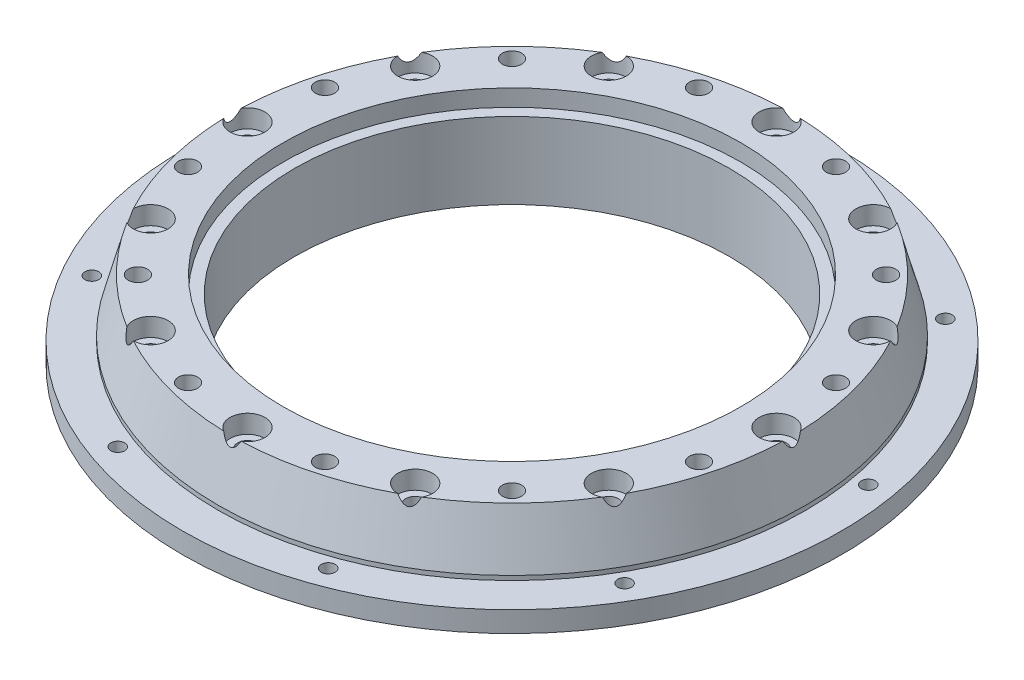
ISO-10303-21;
HEADER;
FILE_DESCRIPTION(('STEP AP214'),'2;1');
FILE_NAME('part.step','',(''),(''),'','','');
FILE_SCHEMA(('AUTOMOTIVE_DESIGN { 1 0 10303 214 1 1 1 1 }'));
ENDSEC;
DATA;
#1=APPLICATION_CONTEXT('core data for automotive mechanical design processes');
#2=APPLICATION_PROTOCOL_DEFINITION('international standard','automotive_design',2000,#1);
#3=PRODUCT_CONTEXT('',#1,'mechanical');
#4=PRODUCT('Part','Part','',(#3));
#5=PRODUCT_RELATED_PRODUCT_CATEGORY('part','',(#4));
#6=PRODUCT_DEFINITION_FORMATION('','',#4);
#7=PRODUCT_DEFINITION_CONTEXT('part definition',#1,'design');
#8=PRODUCT_DEFINITION('design','',#6,#7);
#9=PRODUCT_DEFINITION_SHAPE('','',#8);
#10=(LENGTH_UNIT() NAMED_UNIT(*) SI_UNIT(.MILLI.,.METRE.));
#11=(NAMED_UNIT(*) PLANE_ANGLE_UNIT() SI_UNIT($,.RADIAN.));
#12=(NAMED_UNIT(*) SI_UNIT($,.STERADIAN.) SOLID_ANGLE_UNIT());
#13=UNCERTAINTY_MEASURE_WITH_UNIT(LENGTH_MEASURE(1.E-05),#10,'distance_accuracy_value','');
#14=(GEOMETRIC_REPRESENTATION_CONTEXT(3) GLOBAL_UNCERTAINTY_ASSIGNED_CONTEXT((#13)) GLOBAL_UNIT_ASSIGNED_CONTEXT((#10,
#11,#12)) REPRESENTATION_CONTEXT('',''));
#15=CARTESIAN_POINT('',(0.,0.,0.));
#16=DIRECTION('',(0.,0.,1.));
#17=DIRECTION('',(1.,0.,0.));
#18=AXIS2_PLACEMENT_3D('',#15,#16,#17);
#19=CARTESIAN_POINT('',(0.,0.,0.));
#20=DIRECTION('',(0.,1.,0.));
#21=DIRECTION('',(0.,0.,1.));
#22=AXIS2_PLACEMENT_3D('',#19,#20,#21);
#23=CYLINDRICAL_SURFACE('',#22,49.53);
#24=CARTESIAN_POINT('',(0.,0.,0.));
#25=DIRECTION('',(0.,1.,0.));
#26=DIRECTION('',(0.,0.,1.));
#27=AXIS2_PLACEMENT_3D('',#24,#25,#26);
#28=CIRCLE('',#27,49.53);
#29=CARTESIAN_POINT('',(0.,0.,49.53));
#30=VERTEX_POINT('',#29);
#31=EDGE_CURVE('E162',#30,#30,#28,.T.);
#32=ORIENTED_EDGE('',*,*,#31,.F.);
#33=EDGE_LOOP('',(#32));
#34=FACE_BOUND('',#33,.T.);
#35=CARTESIAN_POINT('',(0.,17.38,0.));
#36=DIRECTION('',(0.,1.,0.));
#37=DIRECTION('',(0.,0.,1.));
#38=AXIS2_PLACEMENT_3D('',#35,#36,#37);
#39=CIRCLE('',#38,49.53);
#40=CARTESIAN_POINT('',(0.,17.38,49.53));
#41=VERTEX_POINT('',#40);
#42=EDGE_CURVE('E47',#41,#41,#39,.F.);
#43=ORIENTED_EDGE('',*,*,#42,.F.);
#44=EDGE_LOOP('',(#43));
#45=FACE_BOUND('',#44,.T.);
#46=ADVANCED_FACE('F43',(#34,#45),#23,.F.);
#47=CARTESIAN_POINT('',(0.,21.2,0.));
#48=DIRECTION('',(0.,-1.,0.));
#49=DIRECTION('',(0.,0.,-1.));
#50=AXIS2_PLACEMENT_3D('',#47,#48,#49);
#51=CYLINDRICAL_SURFACE('',#50,75.);
#52=CARTESIAN_POINT('',(0.,8.2,0.));
#53=DIRECTION('',(0.,1.,0.));
#54=DIRECTION('',(0.,0.,1.));
#55=AXIS2_PLACEMENT_3D('',#52,#53,#54);
#56=CIRCLE('',#55,75.);
#57=CARTESIAN_POINT('',(0.,8.2,75.));
#58=VERTEX_POINT('',#57);
#59=EDGE_CURVE('E153',#58,#58,#56,.T.);
#60=ORIENTED_EDGE('',*,*,#59,.F.);
#61=EDGE_LOOP('',(#60));
#62=FACE_BOUND('',#61,.T.);
#63=CARTESIAN_POINT('',(0.,3.5,0.));
#64=DIRECTION('',(0.,-1.,0.));
#65=DIRECTION('',(0.,0.,-1.));
#66=AXIS2_PLACEMENT_3D('',#63,#64,#65);
#67=CIRCLE('',#66,75.);
#68=CARTESIAN_POINT('',(0.,3.5,-75.));
#69=VERTEX_POINT('',#68);
#70=EDGE_CURVE('E472',#69,#69,#67,.T.);
#71=ORIENTED_EDGE('',*,*,#70,.F.);
#72=EDGE_LOOP('',(#71));
#73=FACE_BOUND('',#72,.T.);
#74=ADVANCED_FACE('F456',(#62,#73),#51,.T.);
#75=CARTESIAN_POINT('',(0.,0.,0.));
#76=DIRECTION('',(0.,1.,0.));
#77=DIRECTION('',(0.,0.,1.));
#78=AXIS2_PLACEMENT_3D('',#75,#76,#77);
#79=PLANE('',#78);
#80=CARTESIAN_POINT('',(0.,0.,0.));
#81=DIRECTION('',(0.,1.,0.));
#82=DIRECTION('',(0.,0.,1.));
#83=AXIS2_PLACEMENT_3D('',#80,#81,#82);
#84=CIRCLE('',#83,51.07);
#85=CARTESIAN_POINT('',(0.,0.,51.07));
#86=VERTEX_POINT('',#85);
#87=EDGE_CURVE('E52',#86,#86,#84,.F.);
#88=ORIENTED_EDGE('',*,*,#87,.T.);
#89=EDGE_LOOP('',(#88));
#90=FACE_BOUND('',#89,.T.);
#91=ORIENTED_EDGE('',*,*,#31,.T.);
#92=EDGE_LOOP('',(#91));
#93=FACE_BOUND('',#92,.T.);
#94=ADVANCED_FACE('F445',(#90,#93),#79,.F.);
#95=CARTESIAN_POINT('',(0.,21.2,-70.));
#96=DIRECTION('',(0.,1.,0.));
#97=DIRECTION('',(0.,0.,1.));
#98=AXIS2_PLACEMENT_3D('',#95,#96,#97);
#99=CYLINDRICAL_SURFACE('',#98,1.57499999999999);
#100=CARTESIAN_POINT('',(0.,8.2,-70.));
#101=DIRECTION('',(0.,1.,0.));
#102=DIRECTION('',(0.,0.,1.));
#103=AXIS2_PLACEMENT_3D('',#100,#101,#102);
#104=CIRCLE('',#103,1.57499999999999);
#105=CARTESIAN_POINT('',(0.,8.2,-68.425));
#106=VERTEX_POINT('',#105);
#107=EDGE_CURVE('E617',#106,#106,#104,.T.);
#108=ORIENTED_EDGE('',*,*,#107,.T.);
#109=EDGE_LOOP('',(#108));
#110=FACE_BOUND('',#109,.T.);
#111=CARTESIAN_POINT('',(0.,3.5,-70.));
#112=DIRECTION('',(0.,-1.,0.));
#113=DIRECTION('',(0.,0.,-1.));
#114=AXIS2_PLACEMENT_3D('',#111,#112,#113);
#115=CIRCLE('',#114,1.57499999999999);
#116=CARTESIAN_POINT('',(0.,3.5,-71.575));
#117=VERTEX_POINT('',#116);
#118=EDGE_CURVE('E475',#117,#117,#115,.F.);
#119=ORIENTED_EDGE('',*,*,#118,.F.);
#120=EDGE_LOOP('',(#119));
#121=FACE_BOUND('',#120,.T.);
#122=ADVANCED_FACE('F441',(#110,#121),#99,.F.);
#123=CARTESIAN_POINT('',(-44.9951326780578,21.2,-53.6231110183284));
#124=DIRECTION('',(0.,1.,0.));
#125=DIRECTION('',(0.,0.,1.));
#126=AXIS2_PLACEMENT_3D('',#123,#124,#125);
#127=CYLINDRICAL_SURFACE('',#126,1.57499999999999);
#128=CARTESIAN_POINT('',(-44.9951326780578,8.2,-53.6231110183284));
#129=DIRECTION('',(0.,1.,0.));
#130=DIRECTION('',(0.,0.,1.));
#131=AXIS2_PLACEMENT_3D('',#128,#129,#130);
#132=CIRCLE('',#131,1.57499999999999);
#133=CARTESIAN_POINT('',(-44.9951326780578,8.2,-52.0481110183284));
#134=VERTEX_POINT('',#133);
#135=EDGE_CURVE('E611',#134,#134,#132,.T.);
#136=ORIENTED_EDGE('',*,*,#135,.T.);
#137=EDGE_LOOP('',(#136));
#138=FACE_BOUND('',#137,.T.);
#139=CARTESIAN_POINT('',(-44.9951326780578,3.5,-53.6231110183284));
#140=DIRECTION('',(0.,-1.,0.));
#141=DIRECTION('',(0.,0.,-1.));
#142=AXIS2_PLACEMENT_3D('',#139,#140,#141);
#143=CIRCLE('',#142,1.57499999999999);
#144=CARTESIAN_POINT('',(-44.9951326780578,3.5,-55.1981110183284));
#145=VERTEX_POINT('',#144);
#146=EDGE_CURVE('E481',#145,#145,#143,.F.);
#147=ORIENTED_EDGE('',*,*,#146,.F.);
#148=EDGE_LOOP('',(#147));
#149=FACE_BOUND('',#148,.T.);
#150=ADVANCED_FACE('F437',(#138,#149),#127,.F.);
#151=CARTESIAN_POINT('',(-68.9365427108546,21.2,-12.1553724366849));
#152=DIRECTION('',(0.,1.,0.));
#153=DIRECTION('',(0.,0.,1.));
#154=AXIS2_PLACEMENT_3D('',#151,#152,#153);
#155=CYLINDRICAL_SURFACE('',#154,1.57499999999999);
#156=CARTESIAN_POINT('',(-68.9365427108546,8.2,-12.1553724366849));
#157=DIRECTION('',(0.,1.,0.));
#158=DIRECTION('',(0.,0.,1.));
#159=AXIS2_PLACEMENT_3D('',#156,#157,#158);
#160=CIRCLE('',#159,1.57499999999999);
#161=CARTESIAN_POINT('',(-68.9365427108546,8.2,-10.5803724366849));
#162=VERTEX_POINT('',#161);
#163=EDGE_CURVE('E608',#162,#162,#160,.T.);
#164=ORIENTED_EDGE('',*,*,#163,.T.);
#165=EDGE_LOOP('',(#164));
#166=FACE_BOUND('',#165,.T.);
#167=CARTESIAN_POINT('',(-68.9365427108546,3.5,-12.1553724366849));
#168=DIRECTION('',(0.,-1.,0.));
#169=DIRECTION('',(0.,0.,-1.));
#170=AXIS2_PLACEMENT_3D('',#167,#168,#169);
#171=CIRCLE('',#170,1.57499999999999);
#172=CARTESIAN_POINT('',(-68.9365427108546,3.5,-13.7303724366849));
#173=VERTEX_POINT('',#172);
#174=EDGE_CURVE('E664',#173,#173,#171,.F.);
#175=ORIENTED_EDGE('',*,*,#174,.F.);
#176=EDGE_LOOP('',(#175));
#177=FACE_BOUND('',#176,.T.);
#178=ADVANCED_FACE('F433',(#166,#177),#155,.F.);
#179=CARTESIAN_POINT('',(-60.6217782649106,21.2,35.0000000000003));
#180=DIRECTION('',(0.,1.,0.));
#181=DIRECTION('',(0.,0.,1.));
#182=AXIS2_PLACEMENT_3D('',#179,#180,#181);
#183=CYLINDRICAL_SURFACE('',#182,1.57499999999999);
#184=CARTESIAN_POINT('',(-60.6217782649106,8.2,35.0000000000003));
#185=DIRECTION('',(0.,1.,0.));
#186=DIRECTION('',(0.,0.,1.));
#187=AXIS2_PLACEMENT_3D('',#184,#185,#186);
#188=CIRCLE('',#187,1.57499999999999);
#189=CARTESIAN_POINT('',(-60.6217782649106,8.2,36.5750000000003));
#190=VERTEX_POINT('',#189);
#191=EDGE_CURVE('E612',#190,#190,#188,.T.);
#192=ORIENTED_EDGE('',*,*,#191,.T.);
#193=EDGE_LOOP('',(#192));
#194=FACE_BOUND('',#193,.T.);
#195=CARTESIAN_POINT('',(-60.6217782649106,3.5,35.0000000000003));
#196=DIRECTION('',(0.,-1.,0.));
#197=DIRECTION('',(0.,0.,-1.));
#198=AXIS2_PLACEMENT_3D('',#195,#196,#197);
#199=CIRCLE('',#198,1.57499999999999);
#200=CARTESIAN_POINT('',(-60.6217782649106,3.5,33.4250000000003));
#201=VERTEX_POINT('',#200);
#202=EDGE_CURVE('E666',#201,#201,#199,.F.);
#203=ORIENTED_EDGE('',*,*,#202,.F.);
#204=EDGE_LOOP('',(#203));
#205=FACE_BOUND('',#204,.T.);
#206=ADVANCED_FACE('F429',(#194,#205),#183,.F.);
#207=CARTESIAN_POINT('',(-23.9414100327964,21.2,65.7784834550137));
#208=DIRECTION('',(0.,1.,0.));
#209=DIRECTION('',(0.,0.,1.));
#210=AXIS2_PLACEMENT_3D('',#207,#208,#209);
#211=CYLINDRICAL_SURFACE('',#210,1.57499999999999);
#212=CARTESIAN_POINT('',(-23.9414100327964,8.2,65.7784834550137));
#213=DIRECTION('',(0.,1.,0.));
#214=DIRECTION('',(0.,0.,1.));
#215=AXIS2_PLACEMENT_3D('',#212,#213,#214);
#216=CIRCLE('',#215,1.57499999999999);
#217=CARTESIAN_POINT('',(-23.9414100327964,8.2,67.3534834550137));
#218=VERTEX_POINT('',#217);
#219=EDGE_CURVE('E627',#218,#218,#216,.T.);
#220=ORIENTED_EDGE('',*,*,#219,.T.);
#221=EDGE_LOOP('',(#220));
#222=FACE_BOUND('',#221,.T.);
#223=CARTESIAN_POINT('',(-23.9414100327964,3.5,65.7784834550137));
#224=DIRECTION('',(0.,-1.,0.));
#225=DIRECTION('',(0.,0.,-1.));
#226=AXIS2_PLACEMENT_3D('',#223,#224,#225);
#227=CIRCLE('',#226,1.57499999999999);
#228=CARTESIAN_POINT('',(-23.9414100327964,3.5,64.2034834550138));
#229=VERTEX_POINT('',#228);
#230=EDGE_CURVE('E671',#229,#229,#227,.F.);
#231=ORIENTED_EDGE('',*,*,#230,.F.);
#232=EDGE_LOOP('',(#231));
#233=FACE_BOUND('',#232,.T.);
#234=ADVANCED_FACE('F425',(#222,#233),#211,.F.);
#235=CARTESIAN_POINT('',(23.9414100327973,21.2,65.7784834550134));
#236=DIRECTION('',(0.,1.,0.));
#237=DIRECTION('',(0.,0.,1.));
#238=AXIS2_PLACEMENT_3D('',#235,#236,#237);
#239=CYLINDRICAL_SURFACE('',#238,1.57499999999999);
#240=CARTESIAN_POINT('',(23.9414100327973,8.2,65.7784834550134));
#241=DIRECTION('',(0.,1.,0.));
#242=DIRECTION('',(0.,0.,1.));
#243=AXIS2_PLACEMENT_3D('',#240,#241,#242);
#244=CIRCLE('',#243,1.57499999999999);
#245=CARTESIAN_POINT('',(23.9414100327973,8.2,67.3534834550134));
#246=VERTEX_POINT('',#245);
#247=EDGE_CURVE('E630',#246,#246,#244,.T.);
#248=ORIENTED_EDGE('',*,*,#247,.T.);
#249=EDGE_LOOP('',(#248));
#250=FACE_BOUND('',#249,.T.);
#251=CARTESIAN_POINT('',(23.9414100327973,3.5,65.7784834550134));
#252=DIRECTION('',(0.,-1.,0.));
#253=DIRECTION('',(0.,0.,-1.));
#254=AXIS2_PLACEMENT_3D('',#251,#252,#253);
#255=CIRCLE('',#254,1.57499999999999);
#256=CARTESIAN_POINT('',(23.9414100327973,3.5,64.2034834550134));
#257=VERTEX_POINT('',#256);
#258=EDGE_CURVE('E674',#257,#257,#255,.F.);
#259=ORIENTED_EDGE('',*,*,#258,.F.);
#260=EDGE_LOOP('',(#259));
#261=FACE_BOUND('',#260,.T.);
#262=ADVANCED_FACE('F421',(#250,#261),#239,.F.);
#263=CARTESIAN_POINT('',(60.621778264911,21.2,34.9999999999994));
#264=DIRECTION('',(0.,1.,0.));
#265=DIRECTION('',(0.,0.,1.));
#266=AXIS2_PLACEMENT_3D('',#263,#264,#265);
#267=CYLINDRICAL_SURFACE('',#266,1.57499999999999);
#268=CARTESIAN_POINT('',(60.621778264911,8.2,34.9999999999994));
#269=DIRECTION('',(0.,1.,0.));
#270=DIRECTION('',(0.,0.,1.));
#271=AXIS2_PLACEMENT_3D('',#268,#269,#270);
#272=CIRCLE('',#271,1.57499999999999);
#273=CARTESIAN_POINT('',(60.621778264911,8.2,36.5749999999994));
#274=VERTEX_POINT('',#273);
#275=EDGE_CURVE('E633',#274,#274,#272,.T.);
#276=ORIENTED_EDGE('',*,*,#275,.T.);
#277=EDGE_LOOP('',(#276));
#278=FACE_BOUND('',#277,.T.);
#279=CARTESIAN_POINT('',(60.621778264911,3.5,34.9999999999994));
#280=DIRECTION('',(0.,-1.,0.));
#281=DIRECTION('',(0.,0.,-1.));
#282=AXIS2_PLACEMENT_3D('',#279,#280,#281);
#283=CIRCLE('',#282,1.57499999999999);
#284=CARTESIAN_POINT('',(60.621778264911,3.5,33.4249999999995));
#285=VERTEX_POINT('',#284);
#286=EDGE_CURVE('E677',#285,#285,#283,.F.);
#287=ORIENTED_EDGE('',*,*,#286,.F.);
#288=EDGE_LOOP('',(#287));
#289=FACE_BOUND('',#288,.T.);
#290=ADVANCED_FACE('F417',(#278,#289),#267,.F.);
#291=CARTESIAN_POINT('',(68.9365427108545,21.2,-12.1553724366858));
#292=DIRECTION('',(0.,1.,0.));
#293=DIRECTION('',(0.,0.,1.));
#294=AXIS2_PLACEMENT_3D('',#291,#292,#293);
#295=CYLINDRICAL_SURFACE('',#294,1.57499999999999);
#296=CARTESIAN_POINT('',(68.9365427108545,8.2,-12.1553724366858));
#297=DIRECTION('',(0.,1.,0.));
#298=DIRECTION('',(0.,0.,1.));
#299=AXIS2_PLACEMENT_3D('',#296,#297,#298);
#300=CIRCLE('',#299,1.57499999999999);
#301=CARTESIAN_POINT('',(68.9365427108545,8.2,-10.5803724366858));
#302=VERTEX_POINT('',#301);
#303=EDGE_CURVE('E636',#302,#302,#300,.T.);
#304=ORIENTED_EDGE('',*,*,#303,.T.);
#305=EDGE_LOOP('',(#304));
#306=FACE_BOUND('',#305,.T.);
#307=CARTESIAN_POINT('',(68.9365427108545,3.5,-12.1553724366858));
#308=DIRECTION('',(0.,-1.,0.));
#309=DIRECTION('',(0.,0.,-1.));
#310=AXIS2_PLACEMENT_3D('',#307,#308,#309);
#311=CIRCLE('',#310,1.57499999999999);
#312=CARTESIAN_POINT('',(68.9365427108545,3.5,-13.7303724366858));
#313=VERTEX_POINT('',#312);
#314=EDGE_CURVE('E680',#313,#313,#311,.F.);
#315=ORIENTED_EDGE('',*,*,#314,.F.);
#316=EDGE_LOOP('',(#315));
#317=FACE_BOUND('',#316,.T.);
#318=ADVANCED_FACE('F413',(#306,#317),#295,.F.);
#319=CARTESIAN_POINT('',(44.9951326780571,21.2,-53.623111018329));
#320=DIRECTION('',(0.,1.,0.));
#321=DIRECTION('',(0.,0.,1.));
#322=AXIS2_PLACEMENT_3D('',#319,#320,#321);
#323=CYLINDRICAL_SURFACE('',#322,1.57499999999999);
#324=CARTESIAN_POINT('',(44.9951326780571,8.2,-53.623111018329));
#325=DIRECTION('',(0.,1.,0.));
#326=DIRECTION('',(0.,0.,1.));
#327=AXIS2_PLACEMENT_3D('',#324,#325,#326);
#328=CIRCLE('',#327,1.57499999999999);
#329=CARTESIAN_POINT('',(44.9951326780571,8.2,-52.048111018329));
#330=VERTEX_POINT('',#329);
#331=EDGE_CURVE('E607',#330,#330,#328,.T.);
#332=ORIENTED_EDGE('',*,*,#331,.T.);
#333=EDGE_LOOP('',(#332));
#334=FACE_BOUND('',#333,.T.);
#335=CARTESIAN_POINT('',(44.9951326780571,3.5,-53.623111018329));
#336=DIRECTION('',(0.,-1.,0.));
#337=DIRECTION('',(0.,0.,-1.));
#338=AXIS2_PLACEMENT_3D('',#335,#336,#337);
#339=CIRCLE('',#338,1.57499999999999);
#340=CARTESIAN_POINT('',(44.9951326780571,3.5,-55.198111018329));
#341=VERTEX_POINT('',#340);
#342=EDGE_CURVE('E683',#341,#341,#339,.F.);
#343=ORIENTED_EDGE('',*,*,#342,.F.);
#344=EDGE_LOOP('',(#343));
#345=FACE_BOUND('',#344,.T.);
#346=ADVANCED_FACE('F409',(#334,#345),#323,.F.);
#347=CARTESIAN_POINT('',(0.,21.2,-60.198));
#348=DIRECTION('',(0.,1.,0.));
#349=DIRECTION('',(0.,0.,1.));
#350=AXIS2_PLACEMENT_3D('',#347,#348,#349);
#351=CYLINDRICAL_SURFACE('',#350,2.2479);
#352=CARTESIAN_POINT('',(0.,17.0344,-60.198));
#353=DIRECTION('',(0.,1.,0.));
#354=DIRECTION('',(0.,0.,1.));
#355=AXIS2_PLACEMENT_3D('',#352,#353,#354);
#356=CIRCLE('',#355,2.2479);
#357=CARTESIAN_POINT('',(0.,17.0344,-57.9501));
#358=VERTEX_POINT('',#357);
#359=EDGE_CURVE('E604',#358,#358,#356,.T.);
#360=ORIENTED_EDGE('',*,*,#359,.T.);
#361=EDGE_LOOP('',(#360));
#362=FACE_BOUND('',#361,.T.);
#363=CARTESIAN_POINT('',(0.,3.5,-60.198));
#364=DIRECTION('',(0.,-1.,0.));
#365=DIRECTION('',(0.,0.,-1.));
#366=AXIS2_PLACEMENT_3D('',#363,#364,#365);
#367=CIRCLE('',#366,2.2479);
#368=CARTESIAN_POINT('',(0.,3.5,-62.4459));
#369=VERTEX_POINT('',#368);
#370=EDGE_CURVE('E686',#369,#369,#367,.F.);
#371=ORIENTED_EDGE('',*,*,#370,.F.);
#372=EDGE_LOOP('',(#371));
#373=FACE_BOUND('',#372,.T.);
#374=ADVANCED_FACE('F396',(#362,#373),#351,.F.);
#375=CARTESIAN_POINT('',(-30.0990000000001,21.2,-52.1329972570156));
#376=DIRECTION('',(0.,1.,0.));
#377=DIRECTION('',(0.,0.,1.));
#378=AXIS2_PLACEMENT_3D('',#375,#376,#377);
#379=CYLINDRICAL_SURFACE('',#378,2.2479);
#380=CARTESIAN_POINT('',(-30.0990000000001,17.0344,-52.1329972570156));
#381=DIRECTION('',(0.,1.,0.));
#382=DIRECTION('',(0.,0.,1.));
#383=AXIS2_PLACEMENT_3D('',#380,#381,#382);
#384=CIRCLE('',#383,2.2479);
#385=CARTESIAN_POINT('',(-30.0990000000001,17.0344,-49.8850972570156));
#386=VERTEX_POINT('',#385);
#387=EDGE_CURVE('E596',#386,#386,#384,.T.);
#388=ORIENTED_EDGE('',*,*,#387,.T.);
#389=EDGE_LOOP('',(#388));
#390=FACE_BOUND('',#389,.T.);
#391=CARTESIAN_POINT('',(-30.0990000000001,3.5,-52.1329972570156));
#392=DIRECTION('',(0.,-1.,0.));
#393=DIRECTION('',(0.,0.,-1.));
#394=AXIS2_PLACEMENT_3D('',#391,#392,#393);
#395=CIRCLE('',#394,2.2479);
#396=CARTESIAN_POINT('',(-30.0990000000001,3.5,-54.3808972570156));
#397=VERTEX_POINT('',#396);
#398=EDGE_CURVE('E689',#397,#397,#395,.F.);
#399=ORIENTED_EDGE('',*,*,#398,.F.);
#400=EDGE_LOOP('',(#399));
#401=FACE_BOUND('',#400,.T.);
#402=ADVANCED_FACE('F394',(#390,#401),#379,.F.);
#403=CARTESIAN_POINT('',(-52.1329972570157,21.2,-30.0989999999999));
#404=DIRECTION('',(0.,1.,0.));
#405=DIRECTION('',(0.,0.,1.));
#406=AXIS2_PLACEMENT_3D('',#403,#404,#405);
#407=CYLINDRICAL_SURFACE('',#406,2.2479);
#408=CARTESIAN_POINT('',(-52.1329972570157,17.0344,-30.0989999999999));
#409=DIRECTION('',(0.,1.,0.));
#410=DIRECTION('',(0.,0.,1.));
#411=AXIS2_PLACEMENT_3D('',#408,#409,#410);
#412=CIRCLE('',#411,2.2479);
#413=CARTESIAN_POINT('',(-52.1329972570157,17.0344,-27.8510999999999));
#414=VERTEX_POINT('',#413);
#415=EDGE_CURVE('E588',#414,#414,#412,.T.);
#416=ORIENTED_EDGE('',*,*,#415,.T.);
#417=EDGE_LOOP('',(#416));
#418=FACE_BOUND('',#417,.T.);
#419=CARTESIAN_POINT('',(-52.1329972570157,3.5,-30.0989999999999));
#420=DIRECTION('',(0.,-1.,0.));
#421=DIRECTION('',(0.,0.,-1.));
#422=AXIS2_PLACEMENT_3D('',#419,#420,#421);
#423=CIRCLE('',#422,2.2479);
#424=CARTESIAN_POINT('',(-52.1329972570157,3.5,-32.3468999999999));
#425=VERTEX_POINT('',#424);
#426=EDGE_CURVE('E692',#425,#425,#423,.F.);
#427=ORIENTED_EDGE('',*,*,#426,.F.);
#428=EDGE_LOOP('',(#427));
#429=FACE_BOUND('',#428,.T.);
#430=ADVANCED_FACE('F357',(#418,#429),#407,.F.);
#431=CARTESIAN_POINT('',(-60.198,21.2,2.10180193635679E-13));
#432=DIRECTION('',(0.,1.,0.));
#433=DIRECTION('',(0.,0.,1.));
#434=AXIS2_PLACEMENT_3D('',#431,#432,#433);
#435=CYLINDRICAL_SURFACE('',#434,2.2479);
#436=CARTESIAN_POINT('',(-60.198,17.0344,2.10180193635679E-13));
#437=DIRECTION('',(0.,1.,0.));
#438=DIRECTION('',(0.,0.,1.));
#439=AXIS2_PLACEMENT_3D('',#436,#437,#438);
#440=CIRCLE('',#439,2.2479);
#441=CARTESIAN_POINT('',(-60.198,17.0344,2.24790000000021));
#442=VERTEX_POINT('',#441);
#443=EDGE_CURVE('E580',#442,#442,#440,.T.);
#444=ORIENTED_EDGE('',*,*,#443,.T.);
#445=EDGE_LOOP('',(#444));
#446=FACE_BOUND('',#445,.T.);
#447=CARTESIAN_POINT('',(-60.198,3.5,2.10180193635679E-13));
#448=DIRECTION('',(0.,-1.,0.));
#449=DIRECTION('',(0.,0.,-1.));
#450=AXIS2_PLACEMENT_3D('',#447,#448,#449);
#451=CIRCLE('',#450,2.2479);
#452=CARTESIAN_POINT('',(-60.198,3.5,-2.24789999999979));
#453=VERTEX_POINT('',#452);
#454=EDGE_CURVE('E695',#453,#453,#451,.F.);
#455=ORIENTED_EDGE('',*,*,#454,.F.);
#456=EDGE_LOOP('',(#455));
#457=FACE_BOUND('',#456,.T.);
#458=ADVANCED_FACE('F344',(#446,#457),#435,.F.);
#459=CARTESIAN_POINT('',(-52.1329972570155,21.2,30.0990000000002));
#460=DIRECTION('',(0.,1.,0.));
#461=DIRECTION('',(0.,0.,1.));
#462=AXIS2_PLACEMENT_3D('',#459,#460,#461);
#463=CYLINDRICAL_SURFACE('',#462,2.2479);
#464=CARTESIAN_POINT('',(-52.1329972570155,17.0344,30.0990000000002));
#465=DIRECTION('',(0.,1.,0.));
#466=DIRECTION('',(0.,0.,1.));
#467=AXIS2_PLACEMENT_3D('',#464,#465,#466);
#468=CIRCLE('',#467,2.2479);
#469=CARTESIAN_POINT('',(-52.1329972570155,17.0344,32.3469000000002));
#470=VERTEX_POINT('',#469);
#471=EDGE_CURVE('E572',#470,#470,#468,.T.);
#472=ORIENTED_EDGE('',*,*,#471,.T.);
#473=EDGE_LOOP('',(#472));
#474=FACE_BOUND('',#473,.T.);
#475=CARTESIAN_POINT('',(-52.1329972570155,3.5,30.0990000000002));
#476=DIRECTION('',(0.,-1.,0.));
#477=DIRECTION('',(0.,0.,-1.));
#478=AXIS2_PLACEMENT_3D('',#475,#476,#477);
#479=CIRCLE('',#478,2.2479);
#480=CARTESIAN_POINT('',(-52.1329972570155,3.5,27.8511000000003));
#481=VERTEX_POINT('',#480);
#482=EDGE_CURVE('E698',#481,#481,#479,.F.);
#483=ORIENTED_EDGE('',*,*,#482,.F.);
#484=EDGE_LOOP('',(#483));
#485=FACE_BOUND('',#484,.T.);
#486=ADVANCED_FACE('F342',(#474,#485),#463,.F.);
#487=CARTESIAN_POINT('',(-30.0989999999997,21.2,52.1329972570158));
#488=DIRECTION('',(0.,1.,0.));
#489=DIRECTION('',(0.,0.,1.));
#490=AXIS2_PLACEMENT_3D('',#487,#488,#489);
#491=CYLINDRICAL_SURFACE('',#490,2.2479);
#492=CARTESIAN_POINT('',(-30.0989999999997,17.0344,52.1329972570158));
#493=DIRECTION('',(0.,1.,0.));
#494=DIRECTION('',(0.,0.,1.));
#495=AXIS2_PLACEMENT_3D('',#492,#493,#494);
#496=CIRCLE('',#495,2.2479);
#497=CARTESIAN_POINT('',(-30.0989999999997,17.0344,54.3808972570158));
#498=VERTEX_POINT('',#497);
#499=EDGE_CURVE('E564',#498,#498,#496,.T.);
#500=ORIENTED_EDGE('',*,*,#499,.T.);
#501=EDGE_LOOP('',(#500));
#502=FACE_BOUND('',#501,.T.);
#503=CARTESIAN_POINT('',(-30.0989999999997,3.5,52.1329972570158));
#504=DIRECTION('',(0.,-1.,0.));
#505=DIRECTION('',(0.,0.,-1.));
#506=AXIS2_PLACEMENT_3D('',#503,#504,#505);
#507=CIRCLE('',#506,2.2479);
#508=CARTESIAN_POINT('',(-30.0989999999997,3.5,49.8850972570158));
#509=VERTEX_POINT('',#508);
#510=EDGE_CURVE('E701',#509,#509,#507,.F.);
#511=ORIENTED_EDGE('',*,*,#510,.F.);
#512=EDGE_LOOP('',(#511));
#513=FACE_BOUND('',#512,.T.);
#514=ADVANCED_FACE('F304',(#502,#513),#491,.F.);
#515=CARTESIAN_POINT('',(0.,21.2,60.198));
#516=DIRECTION('',(0.,1.,0.));
#517=DIRECTION('',(0.,0.,1.));
#518=AXIS2_PLACEMENT_3D('',#515,#516,#517);
#519=CYLINDRICAL_SURFACE('',#518,2.2479);
#520=CARTESIAN_POINT('',(0.,17.0344,60.198));
#521=DIRECTION('',(0.,1.,0.));
#522=DIRECTION('',(0.,0.,1.));
#523=AXIS2_PLACEMENT_3D('',#520,#521,#522);
#524=CIRCLE('',#523,2.2479);
#525=CARTESIAN_POINT('',(0.,17.0344,62.4459));
#526=VERTEX_POINT('',#525);
#527=EDGE_CURVE('E556',#526,#526,#524,.T.);
#528=ORIENTED_EDGE('',*,*,#527,.T.);
#529=EDGE_LOOP('',(#528));
#530=FACE_BOUND('',#529,.T.);
#531=CARTESIAN_POINT('',(0.,3.5,60.198));
#532=DIRECTION('',(0.,-1.,0.));
#533=DIRECTION('',(0.,0.,-1.));
#534=AXIS2_PLACEMENT_3D('',#531,#532,#533);
#535=CIRCLE('',#534,2.2479);
#536=CARTESIAN_POINT('',(0.,3.5,57.9501));
#537=VERTEX_POINT('',#536);
#538=EDGE_CURVE('E704',#537,#537,#535,.F.);
#539=ORIENTED_EDGE('',*,*,#538,.F.);
#540=EDGE_LOOP('',(#539));
#541=FACE_BOUND('',#540,.T.);
#542=ADVANCED_FACE('F291',(#530,#541),#519,.F.);
#543=CARTESIAN_POINT('',(30.0990000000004,21.2,52.1329972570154));
#544=DIRECTION('',(0.,1.,0.));
#545=DIRECTION('',(0.,0.,1.));
#546=AXIS2_PLACEMENT_3D('',#543,#544,#545);
#547=CYLINDRICAL_SURFACE('',#546,2.2479);
#548=CARTESIAN_POINT('',(30.0990000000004,17.0344,52.1329972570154));
#549=DIRECTION('',(0.,1.,0.));
#550=DIRECTION('',(0.,0.,1.));
#551=AXIS2_PLACEMENT_3D('',#548,#549,#550);
#552=CIRCLE('',#551,2.2479);
#553=CARTESIAN_POINT('',(30.0990000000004,17.0344,54.3808972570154));
#554=VERTEX_POINT('',#553);
#555=EDGE_CURVE('E548',#554,#554,#552,.T.);
#556=ORIENTED_EDGE('',*,*,#555,.T.);
#557=EDGE_LOOP('',(#556));
#558=FACE_BOUND('',#557,.T.);
#559=CARTESIAN_POINT('',(30.0990000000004,3.5,52.1329972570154));
#560=DIRECTION('',(0.,-1.,0.));
#561=DIRECTION('',(0.,0.,-1.));
#562=AXIS2_PLACEMENT_3D('',#559,#560,#561);
#563=CIRCLE('',#562,2.2479);
#564=CARTESIAN_POINT('',(30.0990000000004,3.5,49.8850972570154));
#565=VERTEX_POINT('',#564);
#566=EDGE_CURVE('E707',#565,#565,#563,.F.);
#567=ORIENTED_EDGE('',*,*,#566,.F.);
#568=EDGE_LOOP('',(#567));
#569=FACE_BOUND('',#568,.T.);
#570=ADVANCED_FACE('F289',(#558,#569),#547,.F.);
#571=CARTESIAN_POINT('',(52.1329972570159,21.2,30.0989999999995));
#572=DIRECTION('',(0.,1.,0.));
#573=DIRECTION('',(0.,0.,1.));
#574=AXIS2_PLACEMENT_3D('',#571,#572,#573);
#575=CYLINDRICAL_SURFACE('',#574,2.2479);
#576=CARTESIAN_POINT('',(52.1329972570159,17.0344,30.0989999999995));
#577=DIRECTION('',(0.,1.,0.));
#578=DIRECTION('',(0.,0.,1.));
#579=AXIS2_PLACEMENT_3D('',#576,#577,#578);
#580=CIRCLE('',#579,2.2479);
#581=CARTESIAN_POINT('',(52.1329972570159,17.0344,32.3468999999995));
#582=VERTEX_POINT('',#581);
#583=EDGE_CURVE('E540',#582,#582,#580,.T.);
#584=ORIENTED_EDGE('',*,*,#583,.T.);
#585=EDGE_LOOP('',(#584));
#586=FACE_BOUND('',#585,.T.);
#587=CARTESIAN_POINT('',(52.1329972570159,3.5,30.0989999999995));
#588=DIRECTION('',(0.,-1.,0.));
#589=DIRECTION('',(0.,0.,-1.));
#590=AXIS2_PLACEMENT_3D('',#587,#588,#589);
#591=CIRCLE('',#590,2.2479);
#592=CARTESIAN_POINT('',(52.1329972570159,3.5,27.8510999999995));
#593=VERTEX_POINT('',#592);
#594=EDGE_CURVE('E710',#593,#593,#591,.F.);
#595=ORIENTED_EDGE('',*,*,#594,.F.);
#596=EDGE_LOOP('',(#595));
#597=FACE_BOUND('',#596,.T.);
#598=ADVANCED_FACE('F252',(#586,#597),#575,.F.);
#599=CARTESIAN_POINT('',(60.198,21.2,-6.30540580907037E-13));
#600=DIRECTION('',(0.,1.,0.));
#601=DIRECTION('',(0.,0.,1.));
#602=AXIS2_PLACEMENT_3D('',#599,#600,#601);
#603=CYLINDRICAL_SURFACE('',#602,2.2479);
#604=CARTESIAN_POINT('',(60.198,17.0344,-6.30540580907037E-13));
#605=DIRECTION('',(0.,1.,0.));
#606=DIRECTION('',(0.,0.,1.));
#607=AXIS2_PLACEMENT_3D('',#604,#605,#606);
#608=CIRCLE('',#607,2.2479);
#609=CARTESIAN_POINT('',(60.198,17.0344,2.24789999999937));
#610=VERTEX_POINT('',#609);
#611=EDGE_CURVE('E532',#610,#610,#608,.T.);
#612=ORIENTED_EDGE('',*,*,#611,.T.);
#613=EDGE_LOOP('',(#612));
#614=FACE_BOUND('',#613,.T.);
#615=CARTESIAN_POINT('',(60.198,3.5,-6.30540580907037E-13));
#616=DIRECTION('',(0.,-1.,0.));
#617=DIRECTION('',(0.,0.,-1.));
#618=AXIS2_PLACEMENT_3D('',#615,#616,#617);
#619=CIRCLE('',#618,2.2479);
#620=CARTESIAN_POINT('',(60.198,3.5,-2.24790000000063));
#621=VERTEX_POINT('',#620);
#622=EDGE_CURVE('E713',#621,#621,#619,.F.);
#623=ORIENTED_EDGE('',*,*,#622,.F.);
#624=EDGE_LOOP('',(#623));
#625=FACE_BOUND('',#624,.T.);
#626=ADVANCED_FACE('F239',(#614,#625),#603,.F.);
#627=CARTESIAN_POINT('',(52.1329972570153,21.2,-30.0990000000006));
#628=DIRECTION('',(0.,1.,0.));
#629=DIRECTION('',(0.,0.,1.));
#630=AXIS2_PLACEMENT_3D('',#627,#628,#629);
#631=CYLINDRICAL_SURFACE('',#630,2.2479);
#632=CARTESIAN_POINT('',(52.1329972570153,17.0344,-30.0990000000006));
#633=DIRECTION('',(0.,1.,0.));
#634=DIRECTION('',(0.,0.,1.));
#635=AXIS2_PLACEMENT_3D('',#632,#633,#634);
#636=CIRCLE('',#635,2.2479);
#637=CARTESIAN_POINT('',(52.1329972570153,17.0344,-27.8511000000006));
#638=VERTEX_POINT('',#637);
#639=EDGE_CURVE('E525',#638,#638,#636,.T.);
#640=ORIENTED_EDGE('',*,*,#639,.T.);
#641=EDGE_LOOP('',(#640));
#642=FACE_BOUND('',#641,.T.);
#643=CARTESIAN_POINT('',(52.1329972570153,3.5,-30.0990000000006));
#644=DIRECTION('',(0.,-1.,0.));
#645=DIRECTION('',(0.,0.,-1.));
#646=AXIS2_PLACEMENT_3D('',#643,#644,#645);
#647=CIRCLE('',#646,2.2479);
#648=CARTESIAN_POINT('',(52.1329972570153,3.5,-32.3469000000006));
#649=VERTEX_POINT('',#648);
#650=EDGE_CURVE('E716',#649,#649,#647,.F.);
#651=ORIENTED_EDGE('',*,*,#650,.F.);
#652=EDGE_LOOP('',(#651));
#653=FACE_BOUND('',#652,.T.);
#654=ADVANCED_FACE('F237',(#642,#653),#631,.F.);
#655=CARTESIAN_POINT('',(30.0989999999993,21.2,-52.132997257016));
#656=DIRECTION('',(0.,1.,0.));
#657=DIRECTION('',(0.,0.,1.));
#658=AXIS2_PLACEMENT_3D('',#655,#656,#657);
#659=CYLINDRICAL_SURFACE('',#658,2.2479);
#660=CARTESIAN_POINT('',(30.0989999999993,17.0344,-52.132997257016));
#661=DIRECTION('',(0.,1.,0.));
#662=DIRECTION('',(0.,0.,1.));
#663=AXIS2_PLACEMENT_3D('',#660,#661,#662);
#664=CIRCLE('',#663,2.2479);
#665=CARTESIAN_POINT('',(30.0989999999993,17.0344,-49.885097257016));
#666=VERTEX_POINT('',#665);
#667=EDGE_CURVE('E518',#666,#666,#664,.T.);
#668=ORIENTED_EDGE('',*,*,#667,.T.);
#669=EDGE_LOOP('',(#668));
#670=FACE_BOUND('',#669,.T.);
#671=CARTESIAN_POINT('',(30.0989999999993,3.5,-52.132997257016));
#672=DIRECTION('',(0.,-1.,0.));
#673=DIRECTION('',(0.,0.,-1.));
#674=AXIS2_PLACEMENT_3D('',#671,#672,#673);
#675=CIRCLE('',#674,2.2479);
#676=CARTESIAN_POINT('',(30.0989999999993,3.5,-54.380897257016));
#677=VERTEX_POINT('',#676);
#678=EDGE_CURVE('E719',#677,#677,#675,.F.);
#679=ORIENTED_EDGE('',*,*,#678,.F.);
#680=EDGE_LOOP('',(#679));
#681=FACE_BOUND('',#680,.T.);
#682=ADVANCED_FACE('F231',(#670,#681),#659,.F.);
#683=CARTESIAN_POINT('',(15.5803888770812,21.2,-58.1468028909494));
#684=DIRECTION('',(0.,1.,0.));
#685=DIRECTION('',(0.,0.,1.));
#686=AXIS2_PLACEMENT_3D('',#683,#684,#685);
#687=CYLINDRICAL_SURFACE('',#686,2.1971);
#688=CARTESIAN_POINT('',(15.5803888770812,21.2,-58.1468028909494));
#689=DIRECTION('',(0.,1.,0.));
#690=DIRECTION('',(0.,0.,1.));
#691=AXIS2_PLACEMENT_3D('',#688,#689,#690);
#692=CIRCLE('',#691,2.1971);
#693=CARTESIAN_POINT('',(15.5803888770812,21.2,-55.9497028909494));
#694=VERTEX_POINT('',#693);
#695=EDGE_CURVE('E146',#694,#694,#692,.T.);
#696=ORIENTED_EDGE('',*,*,#695,.T.);
#697=EDGE_LOOP('',(#696));
#698=FACE_BOUND('',#697,.T.);
#699=CARTESIAN_POINT('',(15.5803888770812,3.5,-58.1468028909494));
#700=DIRECTION('',(0.,-1.,0.));
#701=DIRECTION('',(0.,0.,-1.));
#702=AXIS2_PLACEMENT_3D('',#699,#700,#701);
#703=CIRCLE('',#702,2.1971);
#704=CARTESIAN_POINT('',(15.5803888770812,3.5,-60.3439028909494));
#705=VERTEX_POINT('',#704);
#706=EDGE_CURVE('E722',#705,#705,#703,.F.);
#707=ORIENTED_EDGE('',*,*,#706,.F.);
#708=EDGE_LOOP('',(#707));
#709=FACE_BOUND('',#708,.T.);
#710=ADVANCED_FACE('F832',(#698,#709),#687,.F.);
#711=CARTESIAN_POINT('',(-15.580388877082,21.2,-58.1468028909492));
#712=DIRECTION('',(0.,1.,0.));
#713=DIRECTION('',(0.,0.,1.));
#714=AXIS2_PLACEMENT_3D('',#711,#712,#713);
#715=CYLINDRICAL_SURFACE('',#714,2.1971);
#716=CARTESIAN_POINT('',(-15.580388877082,21.2,-58.1468028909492));
#717=DIRECTION('',(0.,1.,0.));
#718=DIRECTION('',(0.,0.,1.));
#719=AXIS2_PLACEMENT_3D('',#716,#717,#718);
#720=CIRCLE('',#719,2.1971);
#721=CARTESIAN_POINT('',(-15.580388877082,21.2,-55.9497028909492));
#722=VERTEX_POINT('',#721);
#723=EDGE_CURVE('E511',#722,#722,#720,.T.);
#724=ORIENTED_EDGE('',*,*,#723,.T.);
#725=EDGE_LOOP('',(#724));
#726=FACE_BOUND('',#725,.T.);
#727=CARTESIAN_POINT('',(-15.580388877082,3.5,-58.1468028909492));
#728=DIRECTION('',(0.,-1.,0.));
#729=DIRECTION('',(0.,0.,-1.));
#730=AXIS2_PLACEMENT_3D('',#727,#728,#729);
#731=CIRCLE('',#730,2.1971);
#732=CARTESIAN_POINT('',(-15.580388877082,3.5,-60.3439028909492));
#733=VERTEX_POINT('',#732);
#734=EDGE_CURVE('E725',#733,#733,#731,.F.);
#735=ORIENTED_EDGE('',*,*,#734,.F.);
#736=EDGE_LOOP('',(#735));
#737=FACE_BOUND('',#736,.T.);
#738=ADVANCED_FACE('F828',(#726,#737),#715,.F.);
#739=CARTESIAN_POINT('',(-42.5664140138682,21.2,-42.5664140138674));
#740=DIRECTION('',(0.,1.,0.));
#741=DIRECTION('',(0.,0.,1.));
#742=AXIS2_PLACEMENT_3D('',#739,#740,#741);
#743=CYLINDRICAL_SURFACE('',#742,2.1971);
#744=CARTESIAN_POINT('',(-42.5664140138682,21.2,-42.5664140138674));
#745=DIRECTION('',(0.,1.,0.));
#746=DIRECTION('',(0.,0.,1.));
#747=AXIS2_PLACEMENT_3D('',#744,#745,#746);
#748=CIRCLE('',#747,2.1971);
#749=CARTESIAN_POINT('',(-42.5664140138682,21.2,-40.3693140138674));
#750=VERTEX_POINT('',#749);
#751=EDGE_CURVE('E508',#750,#750,#748,.T.);
#752=ORIENTED_EDGE('',*,*,#751,.T.);
#753=EDGE_LOOP('',(#752));
#754=FACE_BOUND('',#753,.T.);
#755=CARTESIAN_POINT('',(-42.5664140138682,3.5,-42.5664140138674));
#756=DIRECTION('',(0.,-1.,0.));
#757=DIRECTION('',(0.,0.,-1.));
#758=AXIS2_PLACEMENT_3D('',#755,#756,#757);
#759=CIRCLE('',#758,2.1971);
#760=CARTESIAN_POINT('',(-42.5664140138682,3.5,-44.7635140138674));
#761=VERTEX_POINT('',#760);
#762=EDGE_CURVE('E728',#761,#761,#759,.F.);
#763=ORIENTED_EDGE('',*,*,#762,.F.);
#764=EDGE_LOOP('',(#763));
#765=FACE_BOUND('',#764,.T.);
#766=ADVANCED_FACE('F824',(#754,#765),#743,.F.);
#767=CARTESIAN_POINT('',(-58.1468028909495,21.2,-15.5803888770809));
#768=DIRECTION('',(0.,1.,0.));
#769=DIRECTION('',(0.,0.,1.));
#770=AXIS2_PLACEMENT_3D('',#767,#768,#769);
#771=CYLINDRICAL_SURFACE('',#770,2.1971);
#772=CARTESIAN_POINT('',(-58.1468028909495,21.2,-15.5803888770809));
#773=DIRECTION('',(0.,1.,0.));
#774=DIRECTION('',(0.,0.,1.));
#775=AXIS2_PLACEMENT_3D('',#772,#773,#774);
#776=CIRCLE('',#775,2.1971);
#777=CARTESIAN_POINT('',(-58.1468028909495,21.2,-13.383288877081));
#778=VERTEX_POINT('',#777);
#779=EDGE_CURVE('E505',#778,#778,#776,.T.);
#780=ORIENTED_EDGE('',*,*,#779,.T.);
#781=EDGE_LOOP('',(#780));
#782=FACE_BOUND('',#781,.T.);
#783=CARTESIAN_POINT('',(-58.1468028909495,3.5,-15.5803888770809));
#784=DIRECTION('',(0.,-1.,0.));
#785=DIRECTION('',(0.,0.,-1.));
#786=AXIS2_PLACEMENT_3D('',#783,#784,#785);
#787=CIRCLE('',#786,2.1971);
#788=CARTESIAN_POINT('',(-58.1468028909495,3.5,-17.7774888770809));
#789=VERTEX_POINT('',#788);
#790=EDGE_CURVE('E731',#789,#789,#787,.F.);
#791=ORIENTED_EDGE('',*,*,#790,.F.);
#792=EDGE_LOOP('',(#791));
#793=FACE_BOUND('',#792,.T.);
#794=ADVANCED_FACE('F820',(#782,#793),#771,.F.);
#795=CARTESIAN_POINT('',(-58.1468028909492,21.2,15.5803888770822));
#796=DIRECTION('',(0.,1.,0.));
#797=DIRECTION('',(0.,0.,1.));
#798=AXIS2_PLACEMENT_3D('',#795,#796,#797);
#799=CYLINDRICAL_SURFACE('',#798,2.1971);
#800=CARTESIAN_POINT('',(-58.1468028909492,21.2,15.5803888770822));
#801=DIRECTION('',(0.,1.,0.));
#802=DIRECTION('',(0.,0.,1.));
#803=AXIS2_PLACEMENT_3D('',#800,#801,#802);
#804=CIRCLE('',#803,2.1971);
#805=CARTESIAN_POINT('',(-58.1468028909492,21.2,17.7774888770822));
#806=VERTEX_POINT('',#805);
#807=EDGE_CURVE('E502',#806,#806,#804,.T.);
#808=ORIENTED_EDGE('',*,*,#807,.T.);
#809=EDGE_LOOP('',(#808));
#810=FACE_BOUND('',#809,.T.);
#811=CARTESIAN_POINT('',(-58.1468028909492,3.5,15.5803888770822));
#812=DIRECTION('',(0.,-1.,0.));
#813=DIRECTION('',(0.,0.,-1.));
#814=AXIS2_PLACEMENT_3D('',#811,#812,#813);
#815=CIRCLE('',#814,2.1971);
#816=CARTESIAN_POINT('',(-58.1468028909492,3.5,13.3832888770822));
#817=VERTEX_POINT('',#816);
#818=EDGE_CURVE('E734',#817,#817,#815,.F.);
#819=ORIENTED_EDGE('',*,*,#818,.F.);
#820=EDGE_LOOP('',(#819));
#821=FACE_BOUND('',#820,.T.);
#822=ADVANCED_FACE('F816',(#810,#821),#799,.F.);
#823=CARTESIAN_POINT('',(-42.5664140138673,21.2,42.5664140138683));
#824=DIRECTION('',(0.,1.,0.));
#825=DIRECTION('',(0.,0.,1.));
#826=AXIS2_PLACEMENT_3D('',#823,#824,#825);
#827=CYLINDRICAL_SURFACE('',#826,2.1971);
#828=CARTESIAN_POINT('',(-42.5664140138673,21.2,42.5664140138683));
#829=DIRECTION('',(0.,1.,0.));
#830=DIRECTION('',(0.,0.,1.));
#831=AXIS2_PLACEMENT_3D('',#828,#829,#830);
#832=CIRCLE('',#831,2.1971);
#833=CARTESIAN_POINT('',(-42.5664140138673,21.2,44.7635140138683));
#834=VERTEX_POINT('',#833);
#835=EDGE_CURVE('E499',#834,#834,#832,.T.);
#836=ORIENTED_EDGE('',*,*,#835,.T.);
#837=EDGE_LOOP('',(#836));
#838=FACE_BOUND('',#837,.T.);
#839=CARTESIAN_POINT('',(-42.5664140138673,3.5,42.5664140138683));
#840=DIRECTION('',(0.,-1.,0.));
#841=DIRECTION('',(0.,0.,-1.));
#842=AXIS2_PLACEMENT_3D('',#839,#840,#841);
#843=CIRCLE('',#842,2.1971);
#844=CARTESIAN_POINT('',(-42.5664140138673,3.5,40.3693140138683));
#845=VERTEX_POINT('',#844);
#846=EDGE_CURVE('E737',#845,#845,#843,.F.);
#847=ORIENTED_EDGE('',*,*,#846,.F.);
#848=EDGE_LOOP('',(#847));
#849=FACE_BOUND('',#848,.T.);
#850=ADVANCED_FACE('F812',(#838,#849),#827,.F.);
#851=CARTESIAN_POINT('',(-15.5803888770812,21.2,58.1468028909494));
#852=DIRECTION('',(0.,1.,0.));
#853=DIRECTION('',(0.,0.,1.));
#854=AXIS2_PLACEMENT_3D('',#851,#852,#853);
#855=CYLINDRICAL_SURFACE('',#854,2.1971);
#856=CARTESIAN_POINT('',(-15.5803888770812,21.2,58.1468028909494));
#857=DIRECTION('',(0.,1.,0.));
#858=DIRECTION('',(0.,0.,1.));
#859=AXIS2_PLACEMENT_3D('',#856,#857,#858);
#860=CIRCLE('',#859,2.1971);
#861=CARTESIAN_POINT('',(-15.5803888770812,21.2,60.3439028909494));
#862=VERTEX_POINT('',#861);
#863=EDGE_CURVE('E496',#862,#862,#860,.T.);
#864=ORIENTED_EDGE('',*,*,#863,.T.);
#865=EDGE_LOOP('',(#864));
#866=FACE_BOUND('',#865,.T.);
#867=CARTESIAN_POINT('',(-15.5803888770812,3.5,58.1468028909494));
#868=DIRECTION('',(0.,-1.,0.));
#869=DIRECTION('',(0.,0.,-1.));
#870=AXIS2_PLACEMENT_3D('',#867,#868,#869);
#871=CIRCLE('',#870,2.1971);
#872=CARTESIAN_POINT('',(-15.5803888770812,3.5,55.9497028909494));
#873=VERTEX_POINT('',#872);
#874=EDGE_CURVE('E740',#873,#873,#871,.F.);
#875=ORIENTED_EDGE('',*,*,#874,.F.);
#876=EDGE_LOOP('',(#875));
#877=FACE_BOUND('',#876,.T.);
#878=ADVANCED_FACE('F808',(#866,#877),#855,.F.);
#879=CARTESIAN_POINT('',(15.5803888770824,21.2,58.1468028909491));
#880=DIRECTION('',(0.,1.,0.));
#881=DIRECTION('',(0.,0.,1.));
#882=AXIS2_PLACEMENT_3D('',#879,#880,#881);
#883=CYLINDRICAL_SURFACE('',#882,2.1971);
#884=CARTESIAN_POINT('',(15.5803888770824,21.2,58.1468028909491));
#885=DIRECTION('',(0.,1.,0.));
#886=DIRECTION('',(0.,0.,1.));
#887=AXIS2_PLACEMENT_3D('',#884,#885,#886);
#888=CIRCLE('',#887,2.1971);
#889=CARTESIAN_POINT('',(15.5803888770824,21.2,60.3439028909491));
#890=VERTEX_POINT('',#889);
#891=EDGE_CURVE('E493',#890,#890,#888,.T.);
#892=ORIENTED_EDGE('',*,*,#891,.T.);
#893=EDGE_LOOP('',(#892));
#894=FACE_BOUND('',#893,.T.);
#895=CARTESIAN_POINT('',(15.5803888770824,3.5,58.1468028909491));
#896=DIRECTION('',(0.,-1.,0.));
#897=DIRECTION('',(0.,0.,-1.));
#898=AXIS2_PLACEMENT_3D('',#895,#896,#897);
#899=CIRCLE('',#898,2.1971);
#900=CARTESIAN_POINT('',(15.5803888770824,3.5,55.9497028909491));
#901=VERTEX_POINT('',#900);
#902=EDGE_CURVE('E743',#901,#901,#899,.F.);
#903=ORIENTED_EDGE('',*,*,#902,.F.);
#904=EDGE_LOOP('',(#903));
#905=FACE_BOUND('',#904,.T.);
#906=ADVANCED_FACE('F804',(#894,#905),#883,.F.);
#907=CARTESIAN_POINT('',(42.5664140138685,21.2,42.5664140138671));
#908=DIRECTION('',(0.,1.,0.));
#909=DIRECTION('',(0.,0.,1.));
#910=AXIS2_PLACEMENT_3D('',#907,#908,#909);
#911=CYLINDRICAL_SURFACE('',#910,2.1971);
#912=CARTESIAN_POINT('',(42.5664140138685,21.2,42.5664140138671));
#913=DIRECTION('',(0.,1.,0.));
#914=DIRECTION('',(0.,0.,1.));
#915=AXIS2_PLACEMENT_3D('',#912,#913,#914);
#916=CIRCLE('',#915,2.1971);
#917=CARTESIAN_POINT('',(42.5664140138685,21.2,44.7635140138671));
#918=VERTEX_POINT('',#917);
#919=EDGE_CURVE('E490',#918,#918,#916,.T.);
#920=ORIENTED_EDGE('',*,*,#919,.T.);
#921=EDGE_LOOP('',(#920));
#922=FACE_BOUND('',#921,.T.);
#923=CARTESIAN_POINT('',(42.5664140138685,3.5,42.5664140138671));
#924=DIRECTION('',(0.,-1.,0.));
#925=DIRECTION('',(0.,0.,-1.));
#926=AXIS2_PLACEMENT_3D('',#923,#924,#925);
#927=CIRCLE('',#926,2.1971);
#928=CARTESIAN_POINT('',(42.5664140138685,3.5,40.3693140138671));
#929=VERTEX_POINT('',#928);
#930=EDGE_CURVE('E746',#929,#929,#927,.F.);
#931=ORIENTED_EDGE('',*,*,#930,.F.);
#932=EDGE_LOOP('',(#931));
#933=FACE_BOUND('',#932,.T.);
#934=ADVANCED_FACE('F800',(#922,#933),#911,.F.);
#935=CARTESIAN_POINT('',(58.1468028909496,21.2,15.5803888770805));
#936=DIRECTION('',(0.,1.,0.));
#937=DIRECTION('',(0.,0.,1.));
#938=AXIS2_PLACEMENT_3D('',#935,#936,#937);
#939=CYLINDRICAL_SURFACE('',#938,2.1971);
#940=CARTESIAN_POINT('',(58.1468028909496,21.2,15.5803888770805));
#941=DIRECTION('',(0.,1.,0.));
#942=DIRECTION('',(0.,0.,1.));
#943=AXIS2_PLACEMENT_3D('',#940,#941,#942);
#944=CIRCLE('',#943,2.1971);
#945=CARTESIAN_POINT('',(58.1468028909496,21.2,17.7774888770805));
#946=VERTEX_POINT('',#945);
#947=EDGE_CURVE('E487',#946,#946,#944,.T.);
#948=ORIENTED_EDGE('',*,*,#947,.T.);
#949=EDGE_LOOP('',(#948));
#950=FACE_BOUND('',#949,.T.);
#951=CARTESIAN_POINT('',(58.1468028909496,3.5,15.5803888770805));
#952=DIRECTION('',(0.,-1.,0.));
#953=DIRECTION('',(0.,0.,-1.));
#954=AXIS2_PLACEMENT_3D('',#951,#952,#953);
#955=CIRCLE('',#954,2.1971);
#956=CARTESIAN_POINT('',(58.1468028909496,3.5,13.3832888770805));
#957=VERTEX_POINT('',#956);
#958=EDGE_CURVE('E749',#957,#957,#955,.F.);
#959=ORIENTED_EDGE('',*,*,#958,.F.);
#960=EDGE_LOOP('',(#959));
#961=FACE_BOUND('',#960,.T.);
#962=ADVANCED_FACE('F796',(#950,#961),#939,.F.);
#963=CARTESIAN_POINT('',(58.146802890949,21.2,-15.5803888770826));
#964=DIRECTION('',(0.,1.,0.));
#965=DIRECTION('',(0.,0.,1.));
#966=AXIS2_PLACEMENT_3D('',#963,#964,#965);
#967=CYLINDRICAL_SURFACE('',#966,2.1971);
#968=CARTESIAN_POINT('',(58.146802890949,21.2,-15.5803888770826));
#969=DIRECTION('',(0.,1.,0.));
#970=DIRECTION('',(0.,0.,1.));
#971=AXIS2_PLACEMENT_3D('',#968,#969,#970);
#972=CIRCLE('',#971,2.1971);
#973=CARTESIAN_POINT('',(58.146802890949,21.2,-13.3832888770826));
#974=VERTEX_POINT('',#973);
#975=EDGE_CURVE('E478',#974,#974,#972,.T.);
#976=ORIENTED_EDGE('',*,*,#975,.T.);
#977=EDGE_LOOP('',(#976));
#978=FACE_BOUND('',#977,.T.);
#979=CARTESIAN_POINT('',(58.146802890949,3.5,-15.5803888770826));
#980=DIRECTION('',(0.,-1.,0.));
#981=DIRECTION('',(0.,0.,-1.));
#982=AXIS2_PLACEMENT_3D('',#979,#980,#981);
#983=CIRCLE('',#982,2.1971);
#984=CARTESIAN_POINT('',(58.146802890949,3.5,-17.7774888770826));
#985=VERTEX_POINT('',#984);
#986=EDGE_CURVE('E752',#985,#985,#983,.F.);
#987=ORIENTED_EDGE('',*,*,#986,.F.);
#988=EDGE_LOOP('',(#987));
#989=FACE_BOUND('',#988,.T.);
#990=ADVANCED_FACE('F792',(#978,#989),#967,.F.);
#991=CARTESIAN_POINT('',(42.566414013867,21.2,-42.5664140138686));
#992=DIRECTION('',(0.,1.,0.));
#993=DIRECTION('',(0.,0.,1.));
#994=AXIS2_PLACEMENT_3D('',#991,#992,#993);
#995=CYLINDRICAL_SURFACE('',#994,2.1971);
#996=CARTESIAN_POINT('',(42.566414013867,21.2,-42.5664140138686));
#997=DIRECTION('',(0.,1.,0.));
#998=DIRECTION('',(0.,0.,1.));
#999=AXIS2_PLACEMENT_3D('',#996,#997,#998);
#1000=CIRCLE('',#999,2.1971);
#1001=CARTESIAN_POINT('',(42.566414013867,21.2,-40.3693140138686));
#1002=VERTEX_POINT('',#1001);
#1003=EDGE_CURVE('E474',#1002,#1002,#1000,.T.);
#1004=ORIENTED_EDGE('',*,*,#1003,.T.);
#1005=EDGE_LOOP('',(#1004));
#1006=FACE_BOUND('',#1005,.T.);
#1007=CARTESIAN_POINT('',(42.566414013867,3.5,-42.5664140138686));
#1008=DIRECTION('',(0.,-1.,0.));
#1009=DIRECTION('',(0.,0.,-1.));
#1010=AXIS2_PLACEMENT_3D('',#1007,#1008,#1009);
#1011=CIRCLE('',#1010,2.1971);
#1012=CARTESIAN_POINT('',(42.566414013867,3.5,-44.7635140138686));
#1013=VERTEX_POINT('',#1012);
#1014=EDGE_CURVE('E755',#1013,#1013,#1011,.F.);
#1015=ORIENTED_EDGE('',*,*,#1014,.F.);
#1016=EDGE_LOOP('',(#1015));
#1017=FACE_BOUND('',#1016,.T.);
#1018=ADVANCED_FACE('F460',(#1006,#1017),#995,.F.);
#1019=CARTESIAN_POINT('',(0.,21.2,0.));
#1020=DIRECTION('',(0.,1.,0.));
#1021=DIRECTION('',(0.,0.,1.));
#1022=AXIS2_PLACEMENT_3D('',#1019,#1020,#1021);
#1023=PLANE('',#1022);
#1024=CARTESIAN_POINT('',(0.,21.2,0.));
#1025=DIRECTION('',(0.,1.,0.));
#1026=DIRECTION('',(0.,0.,1.));
#1027=AXIS2_PLACEMENT_3D('',#1024,#1025,#1026);
#1028=CIRCLE('',#1027,52.07);
#1029=CARTESIAN_POINT('',(0.,21.2,52.07));
#1030=VERTEX_POINT('',#1029);
#1031=EDGE_CURVE('E759',#1030,#1030,#1028,.T.);
#1032=ORIENTED_EDGE('',*,*,#1031,.F.);
#1033=EDGE_LOOP('',(#1032));
#1034=FACE_BOUND('',#1033,.T.);
#1035=ORIENTED_EDGE('',*,*,#1003,.F.);
#1036=EDGE_LOOP('',(#1035));
#1037=FACE_BOUND('',#1036,.T.);
#1038=ORIENTED_EDGE('',*,*,#975,.F.);
#1039=EDGE_LOOP('',(#1038));
#1040=FACE_BOUND('',#1039,.T.);
#1041=ORIENTED_EDGE('',*,*,#947,.F.);
#1042=EDGE_LOOP('',(#1041));
#1043=FACE_BOUND('',#1042,.T.);
#1044=ORIENTED_EDGE('',*,*,#919,.F.);
#1045=EDGE_LOOP('',(#1044));
#1046=FACE_BOUND('',#1045,.T.);
#1047=ORIENTED_EDGE('',*,*,#891,.F.);
#1048=EDGE_LOOP('',(#1047));
#1049=FACE_BOUND('',#1048,.T.);
#1050=ORIENTED_EDGE('',*,*,#863,.F.);
#1051=EDGE_LOOP('',(#1050));
#1052=FACE_BOUND('',#1051,.T.);
#1053=ORIENTED_EDGE('',*,*,#835,.F.);
#1054=EDGE_LOOP('',(#1053));
#1055=FACE_BOUND('',#1054,.T.);
#1056=ORIENTED_EDGE('',*,*,#807,.F.);
#1057=EDGE_LOOP('',(#1056));
#1058=FACE_BOUND('',#1057,.T.);
#1059=ORIENTED_EDGE('',*,*,#779,.F.);
#1060=EDGE_LOOP('',(#1059));
#1061=FACE_BOUND('',#1060,.T.);
#1062=ORIENTED_EDGE('',*,*,#751,.F.);
#1063=EDGE_LOOP('',(#1062));
#1064=FACE_BOUND('',#1063,.T.);
#1065=ORIENTED_EDGE('',*,*,#723,.F.);
#1066=EDGE_LOOP('',(#1065));
#1067=FACE_BOUND('',#1066,.T.);
#1068=ORIENTED_EDGE('',*,*,#695,.F.);
#1069=EDGE_LOOP('',(#1068));
#1070=FACE_BOUND('',#1069,.T.);
#1071=CARTESIAN_POINT('',(30.0989999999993,21.2,-52.132997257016));
#1072=DIRECTION('',(0.,1.,0.));
#1073=DIRECTION('',(0.,0.,1.));
#1074=AXIS2_PLACEMENT_3D('',#1071,#1072,#1073);
#1075=CIRCLE('',#1074,3.96875);
#1076=CARTESIAN_POINT('',(30.0855846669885,21.2,-56.1017245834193));
#1077=VERTEX_POINT('',#1076);
#1078=CARTESIAN_POINT('',(33.5427263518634,21.2,-54.1057429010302));
#1079=VERTEX_POINT('',#1078);
#1080=EDGE_CURVE('E58',#1077,#1079,#1075,.T.);
#1081=ORIENTED_EDGE('',*,*,#1080,.F.);
#1082=CARTESIAN_POINT('',(0.,21.2,0.));
#1083=DIRECTION('',(0.,1.,0.));
#1084=DIRECTION('',(0.,0.,1.));
#1085=AXIS2_PLACEMENT_3D('',#1082,#1083,#1084);
#1086=CIRCLE('',#1085,63.6596096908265);
#1087=CARTESIAN_POINT('',(1.99598168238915,21.2,-63.6283110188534));
#1088=VERTEX_POINT('',#1087);
#1089=EDGE_CURVE('E142',#1077,#1088,#1086,.T.);
#1090=ORIENTED_EDGE('',*,*,#1089,.T.);
#1091=CARTESIAN_POINT('',(0.,21.2,-60.198));
#1092=DIRECTION('',(0.,1.,0.));
#1093=DIRECTION('',(0.,0.,1.));
#1094=AXIS2_PLACEMENT_3D('',#1091,#1092,#1093);
#1095=CIRCLE('',#1094,3.96875);
#1096=CARTESIAN_POINT('',(-1.99598168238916,21.2,-63.6283110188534));
#1097=VERTEX_POINT('',#1096);
#1098=EDGE_CURVE('E599',#1097,#1088,#1095,.T.);
#1099=ORIENTED_EDGE('',*,*,#1098,.F.);
#1100=CARTESIAN_POINT('',(-30.0855846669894,21.2,-56.1017245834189));
#1101=VERTEX_POINT('',#1100);
#1102=EDGE_CURVE('E155',#1097,#1101,#1086,.T.);
#1103=ORIENTED_EDGE('',*,*,#1102,.T.);
#1104=CARTESIAN_POINT('',(-30.0990000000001,21.2,-52.1329972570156));
#1105=DIRECTION('',(0.,1.,0.));
#1106=DIRECTION('',(0.,0.,1.));
#1107=AXIS2_PLACEMENT_3D('',#1104,#1105,#1106);
#1108=CIRCLE('',#1107,3.96875);
#1109=CARTESIAN_POINT('',(-33.5427263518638,21.2,-54.1057429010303));
#1110=VERTEX_POINT('',#1109);
#1111=EDGE_CURVE('E591',#1110,#1101,#1108,.T.);
#1112=ORIENTED_EDGE('',*,*,#1111,.F.);
#1113=CARTESIAN_POINT('',(-54.1057429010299,21.2,-33.542726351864));
#1114=VERTEX_POINT('',#1113);
#1115=EDGE_CURVE('E163',#1110,#1114,#1086,.T.);
#1116=ORIENTED_EDGE('',*,*,#1115,.T.);
#1117=CARTESIAN_POINT('',(-52.1329972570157,21.2,-30.0989999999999));
#1118=DIRECTION('',(0.,1.,0.));
#1119=DIRECTION('',(0.,0.,1.));
#1120=AXIS2_PLACEMENT_3D('',#1117,#1118,#1119);
#1121=CIRCLE('',#1120,3.96875);
#1122=CARTESIAN_POINT('',(-56.101724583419,21.2,-30.0855846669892));
#1123=VERTEX_POINT('',#1122);
#1124=EDGE_CURVE('E583',#1123,#1114,#1121,.T.);
#1125=ORIENTED_EDGE('',*,*,#1124,.F.);
#1126=CARTESIAN_POINT('',(-63.6283110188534,21.2,-1.99598168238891));
#1127=VERTEX_POINT('',#1126);
#1128=EDGE_CURVE('E167',#1123,#1127,#1086,.T.);
#1129=ORIENTED_EDGE('',*,*,#1128,.T.);
#1130=CARTESIAN_POINT('',(-60.198,21.2,2.10180193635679E-13));
#1131=DIRECTION('',(0.,1.,0.));
#1132=DIRECTION('',(0.,0.,1.));
#1133=AXIS2_PLACEMENT_3D('',#1130,#1131,#1132);
#1134=CIRCLE('',#1133,3.96874999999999);
#1135=CARTESIAN_POINT('',(-63.6283110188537,21.2,1.9959816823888));
#1136=VERTEX_POINT('',#1135);
#1137=EDGE_CURVE('E575',#1136,#1127,#1134,.T.);
#1138=ORIENTED_EDGE('',*,*,#1137,.F.);
#1139=CARTESIAN_POINT('',(-56.1017245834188,21.2,30.0855846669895));
#1140=VERTEX_POINT('',#1139);
#1141=EDGE_CURVE('E171',#1136,#1140,#1086,.T.);
#1142=ORIENTED_EDGE('',*,*,#1141,.T.);
#1143=CARTESIAN_POINT('',(-52.1329972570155,21.2,30.0990000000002));
#1144=DIRECTION('',(0.,1.,0.));
#1145=DIRECTION('',(0.,0.,1.));
#1146=AXIS2_PLACEMENT_3D('',#1143,#1144,#1145);
#1147=CIRCLE('',#1146,3.96874999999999);
#1148=CARTESIAN_POINT('',(-54.1057429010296,21.2,33.5427263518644));
#1149=VERTEX_POINT('',#1148);
#1150=EDGE_CURVE('E567',#1149,#1140,#1147,.T.);
#1151=ORIENTED_EDGE('',*,*,#1150,.F.);
#1152=CARTESIAN_POINT('',(-33.5427263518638,21.2,54.10574290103));
#1153=VERTEX_POINT('',#1152);
#1154=EDGE_CURVE('E175',#1149,#1153,#1086,.T.);
#1155=ORIENTED_EDGE('',*,*,#1154,.T.);
#1156=CARTESIAN_POINT('',(-30.0989999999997,21.2,52.1329972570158));
#1157=DIRECTION('',(0.,1.,0.));
#1158=DIRECTION('',(0.,0.,1.));
#1159=AXIS2_PLACEMENT_3D('',#1156,#1157,#1158);
#1160=CIRCLE('',#1159,3.96875);
#1161=CARTESIAN_POINT('',(-30.0855846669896,21.2,56.1017245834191));
#1162=VERTEX_POINT('',#1161);
#1163=EDGE_CURVE('E559',#1162,#1153,#1160,.T.);
#1164=ORIENTED_EDGE('',*,*,#1163,.F.);
#1165=CARTESIAN_POINT('',(-1.99598168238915,21.2,63.6283110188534));
#1166=VERTEX_POINT('',#1165);
#1167=EDGE_CURVE('E179',#1162,#1166,#1086,.T.);
#1168=ORIENTED_EDGE('',*,*,#1167,.T.);
#1169=CARTESIAN_POINT('',(0.,21.2,60.198));
#1170=DIRECTION('',(0.,1.,0.));
#1171=DIRECTION('',(0.,0.,1.));
#1172=AXIS2_PLACEMENT_3D('',#1169,#1170,#1171);
#1173=CIRCLE('',#1172,3.96875);
#1174=CARTESIAN_POINT('',(1.99598168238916,21.2,63.6283110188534));
#1175=VERTEX_POINT('',#1174);
#1176=EDGE_CURVE('E551',#1175,#1166,#1173,.T.);
#1177=ORIENTED_EDGE('',*,*,#1176,.F.);
#1178=CARTESIAN_POINT('',(30.0855846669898,21.2,56.1017245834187));
#1179=VERTEX_POINT('',#1178);
#1180=EDGE_CURVE('E183',#1175,#1179,#1086,.T.);
#1181=ORIENTED_EDGE('',*,*,#1180,.T.);
#1182=CARTESIAN_POINT('',(30.0990000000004,21.2,52.1329972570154));
#1183=DIRECTION('',(0.,1.,0.));
#1184=DIRECTION('',(0.,0.,1.));
#1185=AXIS2_PLACEMENT_3D('',#1182,#1183,#1184);
#1186=CIRCLE('',#1185,3.96875);
#1187=CARTESIAN_POINT('',(33.5427263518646,21.2,54.1057429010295));
#1188=VERTEX_POINT('',#1187);
#1189=EDGE_CURVE('E543',#1188,#1179,#1186,.T.);
#1190=ORIENTED_EDGE('',*,*,#1189,.F.);
#1191=CARTESIAN_POINT('',(54.1057429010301,21.2,33.5427263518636));
#1192=VERTEX_POINT('',#1191);
#1193=EDGE_CURVE('E187',#1188,#1192,#1086,.T.);
#1194=ORIENTED_EDGE('',*,*,#1193,.T.);
#1195=CARTESIAN_POINT('',(52.1329972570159,21.2,30.0989999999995));
#1196=DIRECTION('',(0.,1.,0.));
#1197=DIRECTION('',(0.,0.,1.));
#1198=AXIS2_PLACEMENT_3D('',#1195,#1196,#1197);
#1199=CIRCLE('',#1198,3.96875);
#1200=CARTESIAN_POINT('',(56.1017245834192,21.2,30.0855846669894));
#1201=VERTEX_POINT('',#1200);
#1202=EDGE_CURVE('E535',#1201,#1192,#1199,.T.);
#1203=ORIENTED_EDGE('',*,*,#1202,.F.);
#1204=CARTESIAN_POINT('',(63.6283110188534,21.2,1.99598168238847));
#1205=VERTEX_POINT('',#1204);
#1206=EDGE_CURVE('E191',#1201,#1205,#1086,.T.);
#1207=ORIENTED_EDGE('',*,*,#1206,.T.);
#1208=CARTESIAN_POINT('',(60.198,21.2,-6.30540580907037E-13));
#1209=DIRECTION('',(0.,1.,0.));
#1210=DIRECTION('',(0.,0.,1.));
#1211=AXIS2_PLACEMENT_3D('',#1208,#1209,#1210);
#1212=CIRCLE('',#1211,3.96874999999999);
#1213=CARTESIAN_POINT('',(63.6283110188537,21.2,-1.99598168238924));
#1214=VERTEX_POINT('',#1213);
#1215=EDGE_CURVE('E199',#1214,#1205,#1212,.T.);
#1216=ORIENTED_EDGE('',*,*,#1215,.F.);
#1217=CARTESIAN_POINT('',(56.1017245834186,21.2,-30.0855846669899));
#1218=VERTEX_POINT('',#1217);
#1219=EDGE_CURVE('E156',#1214,#1218,#1086,.T.);
#1220=ORIENTED_EDGE('',*,*,#1219,.T.);
#1221=CARTESIAN_POINT('',(52.1329972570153,21.2,-30.0990000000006));
#1222=DIRECTION('',(0.,1.,0.));
#1223=DIRECTION('',(0.,0.,1.));
#1224=AXIS2_PLACEMENT_3D('',#1221,#1222,#1223);
#1225=CIRCLE('',#1224,3.96875);
#1226=CARTESIAN_POINT('',(54.1057429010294,21.2,-33.5427263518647));
#1227=VERTEX_POINT('',#1226);
#1228=EDGE_CURVE('E65',#1227,#1218,#1225,.T.);
#1229=ORIENTED_EDGE('',*,*,#1228,.F.);
#1230=EDGE_CURVE('E144',#1227,#1079,#1086,.T.);
#1231=ORIENTED_EDGE('',*,*,#1230,.T.);
#1232=EDGE_LOOP('',(#1081,#1090,#1099,#1103,#1112,#1116,#1125,#1129,#1138,#1142,#1151,#1155,
#1164,#1168,#1177,#1181,#1190,#1194,#1203,#1207,#1216,#1220,#1229,#1231));
#1233=FACE_BOUND('',#1232,.T.);
#1234=ADVANCED_FACE('F140',(#1034,#1037,#1040,#1043,#1046,#1049,#1052,#1055,#1058,#1061,#1064,
#1067,#1070,#1233),#1023,.T.);
#1235=CARTESIAN_POINT('',(0.,9.2,0.));
#1236=DIRECTION('',(0.,-1.,0.));
#1237=DIRECTION('',(0.,0.,1.));
#1238=AXIS2_PLACEMENT_3D('',#1235,#1236,#1237);
#1239=CONICAL_SURFACE('',#1238,66.875,0.26179938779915);
#1240=CARTESIAN_POINT('',(33.542782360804,21.2002,-54.1056451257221));
#1241=CARTESIAN_POINT('',(33.5132118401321,21.0948278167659,-54.1571944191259));
#1242=CARTESIAN_POINT('',(33.4816943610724,20.9903444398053,-54.2096004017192));
#1243=CARTESIAN_POINT('',(33.4136466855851,20.7836049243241,-54.3166206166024));
#1244=CARTESIAN_POINT('',(33.3770966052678,20.6813595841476,-54.3712429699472));
#1245=CARTESIAN_POINT('',(33.2975464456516,20.4790365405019,-54.4835424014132));
#1246=CARTESIAN_POINT('',(33.2544645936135,20.3790079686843,-54.5412511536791));
#1247=CARTESIAN_POINT('',(33.1607887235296,20.1843204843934,-54.6592815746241));
#1248=CARTESIAN_POINT('',(33.1102083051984,20.0896522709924,-54.7195983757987));
#1249=CARTESIAN_POINT('',(33.012850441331,19.9301749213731,-54.8282515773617));
#1250=CARTESIAN_POINT('',(32.9681253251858,19.8636921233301,-54.8759461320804));
#1251=CARTESIAN_POINT('',(32.8719600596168,19.7371096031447,-54.973128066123));
#1252=CARTESIAN_POINT('',(32.8205216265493,19.6770082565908,-55.0226149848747));
#1253=CARTESIAN_POINT('',(32.7088500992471,19.5652795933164,-55.1238882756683));
#1254=CARTESIAN_POINT('',(32.6485051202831,19.5137810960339,-55.1756969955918));
#1255=CARTESIAN_POINT('',(32.5186087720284,19.4250045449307,-55.2799513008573));
#1256=CARTESIAN_POINT('',(32.4490930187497,19.3876735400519,-55.3323937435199));
#1257=CARTESIAN_POINT('',(32.3256491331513,19.341678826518,-55.4188297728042));
#1258=CARTESIAN_POINT('',(32.2740423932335,19.3276347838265,-55.4532563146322));
#1259=CARTESIAN_POINT('',(32.1679801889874,19.3098419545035,-55.5203591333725));
#1260=CARTESIAN_POINT('',(32.1135267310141,19.3060860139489,-55.553036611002));
#1261=CARTESIAN_POINT('',(32.0033186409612,19.3092965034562,-55.6156064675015));
#1262=CARTESIAN_POINT('',(31.9475632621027,19.3162692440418,-55.6454971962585));
#1263=CARTESIAN_POINT('',(31.8364320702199,19.3401655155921,-55.7017785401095));
#1264=CARTESIAN_POINT('',(31.7810566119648,19.3570973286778,-55.7281662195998));
#1265=CARTESIAN_POINT('',(31.6524143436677,19.4069333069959,-55.7860068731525));
#1266=CARTESIAN_POINT('',(31.5798344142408,19.443384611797,-55.8158945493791));
#1267=CARTESIAN_POINT('',(31.439061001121,19.5275599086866,-55.8694298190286));
#1268=CARTESIAN_POINT('',(31.3708786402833,19.5753111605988,-55.8930620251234));
#1269=CARTESIAN_POINT('',(31.2472710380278,19.6722887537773,-55.9324864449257));
#1270=CARTESIAN_POINT('',(31.1913097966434,19.7206060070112,-55.9488862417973));
#1271=CARTESIAN_POINT('',(31.0826456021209,19.8217533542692,-55.9783298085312));
#1272=CARTESIAN_POINT('',(31.0299454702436,19.8745872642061,-55.9913707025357));
#1273=CARTESIAN_POINT('',(30.8757911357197,20.03858884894,-56.0264246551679));
#1274=CARTESIAN_POINT('',(30.7787852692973,20.1548359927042,-56.044217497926));
#1275=CARTESIAN_POINT('',(30.6301145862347,20.3484501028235,-56.0664566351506));
#1276=CARTESIAN_POINT('',(30.5754759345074,20.4233768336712,-56.0734025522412));
#1277=CARTESIAN_POINT('',(30.4692140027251,20.5755848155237,-56.0848047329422));
#1278=CARTESIAN_POINT('',(30.4175919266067,20.6528669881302,-56.0892600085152));
#1279=CARTESIAN_POINT('',(30.3179358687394,20.8077709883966,-56.0960129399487));
#1280=CARTESIAN_POINT('',(30.2698532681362,20.8853602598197,-56.0983488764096));
#1281=CARTESIAN_POINT('',(30.1760098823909,21.0418542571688,-56.1012747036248));
#1282=CARTESIAN_POINT('',(30.130246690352,21.1207575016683,-56.1018664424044));
#1283=CARTESIAN_POINT('',(30.0854719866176,21.2002,-56.1017242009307));
#1284=B_SPLINE_CURVE_WITH_KNOTS('',3,(#1240,#1241,#1242,#1243,#1244,#1245,#1246,#1247,#1248,
#1249,#1250,#1251,#1252,#1253,#1254,#1255,#1256,#1257,#1258,#1259,#1260,#1261,#1262,#1263,#1264,
#1265,#1266,#1267,#1268,#1269,#1270,#1271,#1272,#1273,#1274,#1275,#1276,#1277,#1278,#1279,#1280,
#1281,#1282,#1283),.UNSPECIFIED.,.F.,.F.,(4,2,2,2,2,2,2,2,2,2,2,2,2,2,2,2,2,2,2,2,2,4),(0.,
0.363005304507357,0.727488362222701,1.09698276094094,1.46581504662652,1.74520362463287,
2.02452091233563,2.30770468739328,2.58981938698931,2.7798216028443,2.96969166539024,
3.15967345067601,3.34981345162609,3.60797848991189,3.86677278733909,4.09363329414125,
4.32068739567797,4.77679252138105,5.05570309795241,5.33472423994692,5.60859896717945,
5.88218341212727),.UNSPECIFIED.);
#1285=EDGE_CURVE('E130',#1079,#1077,#1284,.T.);
#1286=ORIENTED_EDGE('',*,*,#1285,.F.);
#1287=ORIENTED_EDGE('',*,*,#1230,.F.);
#1288=CARTESIAN_POINT('',(56.1017242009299,21.2002,-30.085471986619));
#1289=CARTESIAN_POINT('',(56.1018900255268,21.0948278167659,-30.1449002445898));
#1290=CARTESIAN_POINT('',(56.1007980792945,20.9903444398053,-30.2060438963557));
#1291=CARTESIAN_POINT('',(56.0953771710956,20.7836049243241,-30.3327499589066));
#1292=CARTESIAN_POINT('',(56.0910350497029,20.6813595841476,-30.3983293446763));
#1293=CARTESIAN_POINT('',(56.0782923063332,20.4790365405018,-30.5353585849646));
#1294=CARTESIAN_POINT('',(56.069836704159,20.3790079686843,-30.6068767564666));
#1295=CARTESIAN_POINT('',(56.0477262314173,20.1843204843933,-30.7559320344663));
#1296=CARTESIAN_POINT('',(56.0340807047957,20.0896522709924,-30.8334581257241));
#1297=CARTESIAN_POINT('',(56.0040929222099,19.9301749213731,-30.9762334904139));
#1298=CARTESIAN_POINT('',(55.9892071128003,19.8636921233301,-31.0399007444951));
#1299=CARTESIAN_POINT('',(55.9545165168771,19.7371096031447,-31.1721454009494));
#1300=CARTESIAN_POINT('',(55.9347129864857,19.6770082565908,-31.2407215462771));
#1301=CARTESIAN_POINT('',(55.8886392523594,19.5652795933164,-31.3842625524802));
#1302=CARTESIAN_POINT('',(55.8622833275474,19.5137810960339,-31.4593027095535));
#1303=CARTESIAN_POINT('',(55.8019169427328,19.4250045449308,-31.6145377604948));
#1304=CARTESIAN_POINT('',(55.7679357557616,19.3876735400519,-31.6947121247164));
#1305=CARTESIAN_POINT('',(55.7042482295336,19.341678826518,-31.8312898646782));
#1306=CARTESIAN_POINT('',(55.6767687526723,19.3276347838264,-31.8869074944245));
#1307=CARTESIAN_POINT('',(55.618467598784,19.3098419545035,-31.9980513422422));
#1308=CARTESIAN_POINT('',(55.5876482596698,19.3060860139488,-32.0535775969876));
#1309=CARTESIAN_POINT('',(55.5234901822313,19.3092965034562,-32.1628687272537));
#1310=CARTESIAN_POINT('',(55.4901499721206,19.3162692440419,-32.2166325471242));
#1311=CARTESIAN_POINT('',(55.4220482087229,19.3401655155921,-32.3209392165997));
#1312=CARTESIAN_POINT('',(55.3872854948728,19.3570973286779,-32.3714793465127));
#1313=CARTESIAN_POINT('',(55.3047983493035,19.4069333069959,-32.4858919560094));
#1314=CARTESIAN_POINT('',(55.2568861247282,19.4433846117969,-32.5480654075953));
#1315=CARTESIAN_POINT('',(55.1617404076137,19.5275599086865,-32.66481501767));
#1316=CARTESIAN_POINT('',(55.1145088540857,19.5753111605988,-32.7193722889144));
#1317=CARTESIAN_POINT('',(55.0271737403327,19.6722887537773,-32.8153186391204));
#1318=CARTESIAN_POINT('',(54.9869097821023,19.7206060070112,-32.8575019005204));
#1319=CARTESIAN_POINT('',(54.907525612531,19.8217533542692,-32.9373328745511));
#1320=CARTESIAN_POINT('',(54.8684064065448,19.874587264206,-32.9749766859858));
#1321=CARTESIAN_POINT('',(54.7524318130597,20.03858884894,-33.0824114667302));
#1322=CARTESIAN_POINT('',(54.6773186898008,20.1548359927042,-33.1463234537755));
#1323=CARTESIAN_POINT('',(54.5596856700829,20.3484501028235,-33.2399184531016));
#1324=CARTESIAN_POINT('',(54.5158401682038,20.4233768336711,-33.2732531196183));
#1325=CARTESIAN_POINT('',(54.4295157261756,20.5755848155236,-33.336258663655));
#1326=CARTESIAN_POINT('',(54.3870373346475,20.6528669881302,-33.3659280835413));
#1327=CARTESIAN_POINT('',(54.3041091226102,20.8077709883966,-33.4216043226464));
#1328=CARTESIAN_POINT('',(54.2636363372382,20.8853602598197,-33.4476686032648));
#1329=CARTESIAN_POINT('',(54.1838284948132,21.0418542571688,-33.4971241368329));
#1330=CARTESIAN_POINT('',(54.144492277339,21.1207575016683,-33.5205181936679));
#1331=CARTESIAN_POINT('',(54.1056451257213,21.2002,-33.5427823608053));
#1332=B_SPLINE_CURVE_WITH_KNOTS('',3,(#1288,#1289,#1290,#1291,#1292,#1293,#1294,#1295,#1296,
#1297,#1298,#1299,#1300,#1301,#1302,#1303,#1304,#1305,#1306,#1307,#1308,#1309,#1310,#1311,#1312,
#1313,#1314,#1315,#1316,#1317,#1318,#1319,#1320,#1321,#1322,#1323,#1324,#1325,#1326,#1327,#1328,
#1329,#1330,#1331),.UNSPECIFIED.,.F.,.F.,(4,2,2,2,2,2,2,2,2,2,2,2,2,2,2,2,2,2,2,2,2,4),(0.,
0.363005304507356,0.727488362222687,1.09698276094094,1.46581504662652,1.74520362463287,
2.02452091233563,2.30770468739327,2.5898193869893,2.7798216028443,2.96969166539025,
3.15967345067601,3.3498134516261,3.60797848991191,3.86677278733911,4.09363329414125,
4.32068739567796,4.77679252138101,5.05570309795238,5.33472423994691,5.60859896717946,
5.88218341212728),.UNSPECIFIED.);
#1333=EDGE_CURVE('E137',#1218,#1227,#1332,.T.);
#1334=ORIENTED_EDGE('',*,*,#1333,.F.);
#1335=ORIENTED_EDGE('',*,*,#1219,.F.);
#1336=CARTESIAN_POINT('',(63.628254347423,21.2002,1.99607907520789));
#1337=CARTESIAN_POINT('',(63.6581120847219,21.0948278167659,1.94469560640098));
#1338=CARTESIAN_POINT('',(63.6877382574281,20.9903444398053,1.89119767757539));
#1339=CARTESIAN_POINT('',(63.7463966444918,20.7836049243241,1.77875655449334));
#1340=CARTESIAN_POINT('',(63.7754259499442,20.6813595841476,1.71979207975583));
#1341=CARTESIAN_POINT('',(63.8329050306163,20.4790365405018,1.59474990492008));
#1342=CARTESIAN_POINT('',(63.8613413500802,20.3790079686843,1.52858555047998));
#1343=CARTESIAN_POINT('',(63.916720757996,20.1843204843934,1.38844465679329));
#1344=CARTESIAN_POINT('',(63.9436664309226,20.0896522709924,1.31448232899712));
#1345=CARTESIAN_POINT('',(63.989083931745,19.9301749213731,1.1758413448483));
#1346=CARTESIAN_POINT('',(64.008026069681,19.8636921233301,1.11326098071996));
#1347=CARTESIAN_POINT('',(64.0441054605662,19.7371096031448,0.981388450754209));
#1348=CARTESIAN_POINT('',(64.0612431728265,19.6770082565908,0.912098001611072));
#1349=CARTESIAN_POINT('',(64.0931126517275,19.5652795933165,0.764750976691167));
#1350=CARTESIAN_POINT('',(64.1078078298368,19.5137810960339,0.68658633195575));
#1351=CARTESIAN_POINT('',(64.1331465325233,19.4250045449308,0.521965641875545));
#1352=CARTESIAN_POINT('',(64.1438051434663,19.3876735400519,0.435542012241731));
#1353=CARTESIAN_POINT('',(64.1569389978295,19.341678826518,0.285418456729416));
#1354=CARTESIAN_POINT('',(64.1609498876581,19.3276347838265,0.223512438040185));
#1355=CARTESIAN_POINT('',(64.1660315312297,19.3098419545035,0.0981084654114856));
#1356=CARTESIAN_POINT('',(64.1671043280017,19.3060860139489,0.0346116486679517));
#1357=CARTESIAN_POINT('',(64.166187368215,19.3092965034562,-0.0921162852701));
#1358=CARTESIAN_POINT('',(64.1641958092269,19.3162692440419,-0.155347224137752));
#1359=CARTESIAN_POINT('',(64.1573712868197,19.3401655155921,-0.279730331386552));
#1360=CARTESIAN_POINT('',(64.1525359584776,19.3570973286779,-0.340880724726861));
#1361=CARTESIAN_POINT('',(64.1383062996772,19.406933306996,-0.481208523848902));
#1362=CARTESIAN_POINT('',(64.1278998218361,19.443384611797,-0.559008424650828));
#1363=CARTESIAN_POINT('',(64.1038760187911,19.5275599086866,-0.707689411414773));
#1364=CARTESIAN_POINT('',(64.0902509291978,19.5753111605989,-0.778553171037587));
#1365=CARTESIAN_POINT('',(64.0625896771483,19.6722887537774,-0.905312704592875));
#1366=CARTESIAN_POINT('',(64.0488116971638,19.7206060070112,-0.961976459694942));
#1367=CARTESIAN_POINT('',(64.0199784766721,19.8217533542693,-1.07080419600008));
#1368=CARTESIAN_POINT('',(64.0049221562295,19.8745872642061,-1.12296429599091));
#1369=CARTESIAN_POINT('',(63.9582026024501,20.0385888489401,-1.27399284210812));
#1370=CARTESIAN_POINT('',(63.9251087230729,20.1548359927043,-1.36689880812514));
#1371=CARTESIAN_POINT('',(63.8700330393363,20.3484501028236,-1.50677096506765));
#1372=CARTESIAN_POINT('',(63.8487290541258,20.4233768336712,-1.55756238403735));
#1373=CARTESIAN_POINT('',(63.8054726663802,20.5755848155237,-1.65528900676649));
#1374=CARTESIAN_POINT('',(63.7835200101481,20.6528669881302,-1.70222267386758));
#1375=CARTESIAN_POINT('',(63.7395401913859,20.8077709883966,-1.79190381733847));
#1376=CARTESIAN_POINT('',(63.7175218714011,20.8853602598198,-1.83471253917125));
#1377=CARTESIAN_POINT('',(63.6731340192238,21.0418542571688,-1.91744620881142));
#1378=CARTESIAN_POINT('',(63.6507648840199,21.1207575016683,-1.9573741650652));
#1379=CARTESIAN_POINT('',(63.628254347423,21.2002,-1.99607907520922));
#1380=B_SPLINE_CURVE_WITH_KNOTS('',3,(#1336,#1337,#1338,#1339,#1340,#1341,#1342,#1343,#1344,
#1345,#1346,#1347,#1348,#1349,#1350,#1351,#1352,#1353,#1354,#1355,#1356,#1357,#1358,#1359,#1360,
#1361,#1362,#1363,#1364,#1365,#1366,#1367,#1368,#1369,#1370,#1371,#1372,#1373,#1374,#1375,#1376,
#1377,#1378,#1379),.UNSPECIFIED.,.F.,.F.,(4,2,2,2,2,2,2,2,2,2,2,2,2,2,2,2,2,2,2,2,2,4),(0.,
0.363005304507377,0.727488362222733,1.09698276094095,1.46581504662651,1.74520362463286,
2.02452091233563,2.30770468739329,2.58981938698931,2.7798216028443,2.96969166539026,
3.15967345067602,3.34981345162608,3.60797848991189,3.8667727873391,4.09363329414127,
4.32068739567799,4.77679252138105,5.05570309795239,5.33472423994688,5.6085989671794,
5.8821834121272),.UNSPECIFIED.);
#1381=EDGE_CURVE('E201',#1205,#1214,#1380,.T.);
#1382=ORIENTED_EDGE('',*,*,#1381,.F.);
#1383=ORIENTED_EDGE('',*,*,#1206,.F.);
#1384=CARTESIAN_POINT('',(54.105645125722,21.2002,33.5427823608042));
#1385=CARTESIAN_POINT('',(54.1571944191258,21.0948278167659,33.5132118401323));
#1386=CARTESIAN_POINT('',(54.2096004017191,20.9903444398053,33.4816943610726));
#1387=CARTESIAN_POINT('',(54.3166206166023,20.7836049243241,33.4136466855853));
#1388=CARTESIAN_POINT('',(54.3712429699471,20.6813595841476,33.377096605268));
#1389=CARTESIAN_POINT('',(54.4835424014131,20.4790365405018,33.2975464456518));
#1390=CARTESIAN_POINT('',(54.541251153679,20.3790079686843,33.2544645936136));
#1391=CARTESIAN_POINT('',(54.659281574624,20.1843204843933,33.1607887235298));
#1392=CARTESIAN_POINT('',(54.7195983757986,20.0896522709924,33.1102083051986));
#1393=CARTESIAN_POINT('',(54.8282515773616,19.9301749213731,33.0128504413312));
#1394=CARTESIAN_POINT('',(54.8759461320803,19.8636921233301,32.968125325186));
#1395=CARTESIAN_POINT('',(54.9731280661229,19.7371096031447,32.871960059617));
#1396=CARTESIAN_POINT('',(55.0226149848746,19.6770082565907,32.8205216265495));
#1397=CARTESIAN_POINT('',(55.1238882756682,19.5652795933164,32.7088500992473));
#1398=CARTESIAN_POINT('',(55.1756969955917,19.5137810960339,32.6485051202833));
#1399=CARTESIAN_POINT('',(55.2799513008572,19.4250045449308,32.5186087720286));
#1400=CARTESIAN_POINT('',(55.3323937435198,19.3876735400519,32.4490930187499));
#1401=CARTESIAN_POINT('',(55.4188297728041,19.341678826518,32.3256491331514));
#1402=CARTESIAN_POINT('',(55.4532563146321,19.3276347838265,32.2740423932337));
#1403=CARTESIAN_POINT('',(55.5203591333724,19.3098419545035,32.1679801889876));
#1404=CARTESIAN_POINT('',(55.5530366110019,19.3060860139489,32.1135267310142));
#1405=CARTESIAN_POINT('',(55.6156064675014,19.3092965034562,32.0033186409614));
#1406=CARTESIAN_POINT('',(55.6454971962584,19.3162692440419,31.9475632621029));
#1407=CARTESIAN_POINT('',(55.7017785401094,19.3401655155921,31.8364320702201));
#1408=CARTESIAN_POINT('',(55.7281662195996,19.3570973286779,31.781056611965));
#1409=CARTESIAN_POINT('',(55.7860068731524,19.4069333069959,31.6524143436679));
#1410=CARTESIAN_POINT('',(55.815894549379,19.443384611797,31.579834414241));
#1411=CARTESIAN_POINT('',(55.8694298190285,19.5275599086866,31.4390610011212));
#1412=CARTESIAN_POINT('',(55.8930620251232,19.5753111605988,31.3708786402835));
#1413=CARTESIAN_POINT('',(55.9324864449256,19.6722887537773,31.247271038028));
#1414=CARTESIAN_POINT('',(55.9488862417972,19.7206060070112,31.1913097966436));
#1415=CARTESIAN_POINT('',(55.978329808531,19.8217533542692,31.0826456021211));
#1416=CARTESIAN_POINT('',(55.9913707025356,19.874587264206,31.0299454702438));
#1417=CARTESIAN_POINT('',(56.0264246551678,20.0385888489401,30.87579113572));
#1418=CARTESIAN_POINT('',(56.0442174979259,20.1548359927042,30.7787852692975));
#1419=CARTESIAN_POINT('',(56.0664566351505,20.3484501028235,30.6301145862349));
#1420=CARTESIAN_POINT('',(56.0734025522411,20.4233768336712,30.5754759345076));
#1421=CARTESIAN_POINT('',(56.0848047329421,20.5755848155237,30.4692140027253));
#1422=CARTESIAN_POINT('',(56.0892600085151,20.6528669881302,30.4175919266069));
#1423=CARTESIAN_POINT('',(56.0960129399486,20.8077709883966,30.3179358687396));
#1424=CARTESIAN_POINT('',(56.0983488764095,20.8853602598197,30.2698532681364));
#1425=CARTESIAN_POINT('',(56.1012747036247,21.0418542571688,30.1760098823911));
#1426=CARTESIAN_POINT('',(56.1018664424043,21.1207575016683,30.1302466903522));
#1427=CARTESIAN_POINT('',(56.1017242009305,21.2002,30.0854719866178));
#1428=B_SPLINE_CURVE_WITH_KNOTS('',3,(#1384,#1385,#1386,#1387,#1388,#1389,#1390,#1391,#1392,
#1393,#1394,#1395,#1396,#1397,#1398,#1399,#1400,#1401,#1402,#1403,#1404,#1405,#1406,#1407,#1408,
#1409,#1410,#1411,#1412,#1413,#1414,#1415,#1416,#1417,#1418,#1419,#1420,#1421,#1422,#1423,#1424,
#1425,#1426,#1427),.UNSPECIFIED.,.F.,.F.,(4,2,2,2,2,2,2,2,2,2,2,2,2,2,2,2,2,2,2,2,2,4),(0.,
0.363005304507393,0.727488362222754,1.096982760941,1.46581504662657,1.74520362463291,
2.02452091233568,2.30770468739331,2.58981938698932,2.77982160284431,2.96969166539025,
3.15967345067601,3.34981345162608,3.60797848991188,3.86677278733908,4.09363329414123,
4.32068739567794,4.776792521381,5.05570309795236,5.33472423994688,5.60859896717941,
5.88218341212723),.UNSPECIFIED.);
#1429=EDGE_CURVE('E203',#1192,#1201,#1428,.T.);
#1430=ORIENTED_EDGE('',*,*,#1429,.F.);
#1431=ORIENTED_EDGE('',*,*,#1193,.F.);
#1432=CARTESIAN_POINT('',(30.0854719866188,21.2002,56.10172420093));
#1433=CARTESIAN_POINT('',(30.1449002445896,21.0948278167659,56.1018900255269));
#1434=CARTESIAN_POINT('',(30.2060438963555,20.9903444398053,56.1007980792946));
#1435=CARTESIAN_POINT('',(30.3327499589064,20.7836049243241,56.0953771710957));
#1436=CARTESIAN_POINT('',(30.3983293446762,20.6813595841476,56.091035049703));
#1437=CARTESIAN_POINT('',(30.5353585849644,20.4790365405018,56.0782923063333));
#1438=CARTESIAN_POINT('',(30.6068767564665,20.3790079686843,56.0698367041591));
#1439=CARTESIAN_POINT('',(30.7559320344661,20.1843204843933,56.0477262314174));
#1440=CARTESIAN_POINT('',(30.833458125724,20.0896522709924,56.0340807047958));
#1441=CARTESIAN_POINT('',(30.9762334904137,19.930174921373,56.00409292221));
#1442=CARTESIAN_POINT('',(31.0399007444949,19.8636921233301,55.9892071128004));
#1443=CARTESIAN_POINT('',(31.1721454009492,19.7371096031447,55.9545165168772));
#1444=CARTESIAN_POINT('',(31.2407215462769,19.6770082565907,55.9347129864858));
#1445=CARTESIAN_POINT('',(31.3842625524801,19.5652795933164,55.8886392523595));
#1446=CARTESIAN_POINT('',(31.4593027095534,19.5137810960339,55.8622833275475));
#1447=CARTESIAN_POINT('',(31.6145377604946,19.4250045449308,55.8019169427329));
#1448=CARTESIAN_POINT('',(31.6947121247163,19.3876735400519,55.7679357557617));
#1449=CARTESIAN_POINT('',(31.831289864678,19.341678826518,55.7042482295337));
#1450=CARTESIAN_POINT('',(31.8869074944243,19.3276347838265,55.6767687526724));
#1451=CARTESIAN_POINT('',(31.998051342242,19.3098419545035,55.6184675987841));
#1452=CARTESIAN_POINT('',(32.0535775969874,19.3060860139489,55.58764825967));
#1453=CARTESIAN_POINT('',(32.1628687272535,19.3092965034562,55.5234901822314));
#1454=CARTESIAN_POINT('',(32.216632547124,19.3162692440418,55.4901499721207));
#1455=CARTESIAN_POINT('',(32.3209392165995,19.3401655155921,55.422048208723));
#1456=CARTESIAN_POINT('',(32.3714793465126,19.3570973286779,55.3872854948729));
#1457=CARTESIAN_POINT('',(32.4858919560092,19.406933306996,55.3047983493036));
#1458=CARTESIAN_POINT('',(32.5480654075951,19.443384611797,55.2568861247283));
#1459=CARTESIAN_POINT('',(32.6648150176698,19.5275599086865,55.1617404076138));
#1460=CARTESIAN_POINT('',(32.7193722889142,19.5753111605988,55.1145088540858));
#1461=CARTESIAN_POINT('',(32.8153186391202,19.6722887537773,55.0271737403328));
#1462=CARTESIAN_POINT('',(32.8575019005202,19.7206060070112,54.9869097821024));
#1463=CARTESIAN_POINT('',(32.9373328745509,19.8217533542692,54.9075256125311));
#1464=CARTESIAN_POINT('',(32.9749766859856,19.874587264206,54.8684064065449));
#1465=CARTESIAN_POINT('',(33.08241146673,20.03858884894,54.7524318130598));
#1466=CARTESIAN_POINT('',(33.1463234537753,20.1548359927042,54.6773186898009));
#1467=CARTESIAN_POINT('',(33.2399184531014,20.3484501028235,54.559685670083));
#1468=CARTESIAN_POINT('',(33.2732531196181,20.4233768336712,54.5158401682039));
#1469=CARTESIAN_POINT('',(33.3362586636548,20.5755848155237,54.4295157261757));
#1470=CARTESIAN_POINT('',(33.3659280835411,20.6528669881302,54.3870373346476));
#1471=CARTESIAN_POINT('',(33.4216043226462,20.8077709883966,54.3041091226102));
#1472=CARTESIAN_POINT('',(33.4476686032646,20.8853602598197,54.2636363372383));
#1473=CARTESIAN_POINT('',(33.4971241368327,21.0418542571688,54.1838284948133));
#1474=CARTESIAN_POINT('',(33.5205181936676,21.1207575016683,54.1444922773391));
#1475=CARTESIAN_POINT('',(33.5427823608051,21.2002,54.1056451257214));
#1476=B_SPLINE_CURVE_WITH_KNOTS('',3,(#1432,#1433,#1434,#1435,#1436,#1437,#1438,#1439,#1440,
#1441,#1442,#1443,#1444,#1445,#1446,#1447,#1448,#1449,#1450,#1451,#1452,#1453,#1454,#1455,#1456,
#1457,#1458,#1459,#1460,#1461,#1462,#1463,#1464,#1465,#1466,#1467,#1468,#1469,#1470,#1471,#1472,
#1473,#1474,#1475),.UNSPECIFIED.,.F.,.F.,(4,2,2,2,2,2,2,2,2,2,2,2,2,2,2,2,2,2,2,2,2,4),(0.,
0.363005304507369,0.72748836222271,1.09698276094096,1.46581504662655,1.74520362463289,
2.02452091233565,2.30770468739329,2.58981938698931,2.7798216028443,2.96969166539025,
3.15967345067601,3.34981345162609,3.60797848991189,3.86677278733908,4.09363329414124,
4.32068739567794,4.776792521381,5.05570309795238,5.3347242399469,5.60859896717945,
5.88218341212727),.UNSPECIFIED.);
#1477=EDGE_CURVE('E265',#1179,#1188,#1476,.T.);
#1478=ORIENTED_EDGE('',*,*,#1477,.F.);
#1479=ORIENTED_EDGE('',*,*,#1180,.F.);
#1480=CARTESIAN_POINT('',(-1.99607907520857,21.2002,63.628254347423));
#1481=CARTESIAN_POINT('',(-1.94469560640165,21.0948278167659,63.6581120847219));
#1482=CARTESIAN_POINT('',(-1.89119767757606,20.9903444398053,63.6877382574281));
#1483=CARTESIAN_POINT('',(-1.77875655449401,20.7836049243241,63.7463966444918));
#1484=CARTESIAN_POINT('',(-1.7197920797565,20.6813595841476,63.7754259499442));
#1485=CARTESIAN_POINT('',(-1.59474990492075,20.4790365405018,63.8329050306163));
#1486=CARTESIAN_POINT('',(-1.52858555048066,20.3790079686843,63.8613413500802));
#1487=CARTESIAN_POINT('',(-1.38844465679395,20.1843204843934,63.916720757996));
#1488=CARTESIAN_POINT('',(-1.31448232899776,20.0896522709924,63.9436664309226));
#1489=CARTESIAN_POINT('',(-1.17584134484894,19.9301749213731,63.989083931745));
#1490=CARTESIAN_POINT('',(-1.11326098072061,19.8636921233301,64.008026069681));
#1491=CARTESIAN_POINT('',(-0.981388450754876,19.7371096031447,64.0441054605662));
#1492=CARTESIAN_POINT('',(-0.912098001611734,19.6770082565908,64.0612431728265));
#1493=CARTESIAN_POINT('',(-0.764750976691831,19.5652795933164,64.0931126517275));
#1494=CARTESIAN_POINT('',(-0.68658633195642,19.5137810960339,64.1078078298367));
#1495=CARTESIAN_POINT('',(-0.521965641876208,19.4250045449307,64.1331465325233));
#1496=CARTESIAN_POINT('',(-0.43554201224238,19.3876735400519,64.1438051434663));
#1497=CARTESIAN_POINT('',(-0.285418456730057,19.341678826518,64.1569389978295));
#1498=CARTESIAN_POINT('',(-0.223512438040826,19.3276347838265,64.1609498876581));
#1499=CARTESIAN_POINT('',(-0.098108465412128,19.3098419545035,64.1660315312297));
#1500=CARTESIAN_POINT('',(-0.0346116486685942,19.3060860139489,64.1671043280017));
#1501=CARTESIAN_POINT('',(0.0921162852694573,19.3092965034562,64.166187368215));
#1502=CARTESIAN_POINT('',(0.155347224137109,19.3162692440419,64.1641958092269));
#1503=CARTESIAN_POINT('',(0.279730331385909,19.3401655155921,64.1573712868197));
#1504=CARTESIAN_POINT('',(0.340880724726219,19.3570973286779,64.1525359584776));
#1505=CARTESIAN_POINT('',(0.481208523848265,19.406933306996,64.1383062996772));
#1506=CARTESIAN_POINT('',(0.559008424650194,19.443384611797,64.1278998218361));
#1507=CARTESIAN_POINT('',(0.70768941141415,19.5275599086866,64.1038760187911));
#1508=CARTESIAN_POINT('',(0.778553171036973,19.5753111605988,64.0902509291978));
#1509=CARTESIAN_POINT('',(0.905312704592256,19.6722887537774,64.0625896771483));
#1510=CARTESIAN_POINT('',(0.961976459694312,19.7206060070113,64.0488116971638));
#1511=CARTESIAN_POINT('',(1.07080419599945,19.8217533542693,64.0199784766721));
#1512=CARTESIAN_POINT('',(1.12296429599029,19.8745872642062,64.0049221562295));
#1513=CARTESIAN_POINT('',(1.27399284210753,20.0385888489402,63.9582026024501));
#1514=CARTESIAN_POINT('',(1.36689880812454,20.1548359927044,63.9251087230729));
#1515=CARTESIAN_POINT('',(1.50677096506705,20.3484501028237,63.8700330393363));
#1516=CARTESIAN_POINT('',(1.55756238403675,20.4233768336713,63.8487290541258));
#1517=CARTESIAN_POINT('',(1.65528900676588,20.5755848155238,63.8054726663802));
#1518=CARTESIAN_POINT('',(1.70222267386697,20.6528669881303,63.7835200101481));
#1519=CARTESIAN_POINT('',(1.79190381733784,20.8077709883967,63.7395401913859));
#1520=CARTESIAN_POINT('',(1.83471253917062,20.8853602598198,63.7175218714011));
#1521=CARTESIAN_POINT('',(1.91744620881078,21.0418542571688,63.6731340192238));
#1522=CARTESIAN_POINT('',(1.95737416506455,21.1207575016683,63.6507648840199));
#1523=CARTESIAN_POINT('',(1.99607907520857,21.2002,63.628254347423));
#1524=B_SPLINE_CURVE_WITH_KNOTS('',3,(#1480,#1481,#1482,#1483,#1484,#1485,#1486,#1487,#1488,
#1489,#1490,#1491,#1492,#1493,#1494,#1495,#1496,#1497,#1498,#1499,#1500,#1501,#1502,#1503,#1504,
#1505,#1506,#1507,#1508,#1509,#1510,#1511,#1512,#1513,#1514,#1515,#1516,#1517,#1518,#1519,#1520,
#1521,#1522,#1523),.UNSPECIFIED.,.F.,.F.,(4,2,2,2,2,2,2,2,2,2,2,2,2,2,2,2,2,2,2,2,2,4),(0.,
0.363005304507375,0.727488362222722,1.09698276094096,1.46581504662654,1.74520362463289,
2.02452091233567,2.30770468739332,2.58981938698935,2.77982160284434,2.9696916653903,
3.15967345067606,3.34981345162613,3.60797848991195,3.86677278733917,4.09363329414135,
4.3206873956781,4.77679252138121,5.05570309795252,5.33472423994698,5.60859896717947,
5.88218341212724),.UNSPECIFIED.);
#1525=EDGE_CURVE('E272',#1166,#1175,#1524,.T.);
#1526=ORIENTED_EDGE('',*,*,#1525,.F.);
#1527=ORIENTED_EDGE('',*,*,#1167,.F.);
#1528=CARTESIAN_POINT('',(-33.5427823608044,21.2002,54.1056451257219));
#1529=CARTESIAN_POINT('',(-33.5132118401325,21.0948278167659,54.1571944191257));
#1530=CARTESIAN_POINT('',(-33.4816943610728,20.9903444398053,54.209600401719));
#1531=CARTESIAN_POINT('',(-33.4136466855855,20.7836049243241,54.3166206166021));
#1532=CARTESIAN_POINT('',(-33.3770966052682,20.6813595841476,54.3712429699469));
#1533=CARTESIAN_POINT('',(-33.297546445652,20.4790365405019,54.483542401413));
#1534=CARTESIAN_POINT('',(-33.2544645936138,20.3790079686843,54.5412511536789));
#1535=CARTESIAN_POINT('',(-33.16078872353,20.1843204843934,54.6592815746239));
#1536=CARTESIAN_POINT('',(-33.1102083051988,20.0896522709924,54.7195983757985));
#1537=CARTESIAN_POINT('',(-33.0128504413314,19.9301749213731,54.8282515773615));
#1538=CARTESIAN_POINT('',(-32.9681253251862,19.8636921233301,54.8759461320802));
#1539=CARTESIAN_POINT('',(-32.8719600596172,19.7371096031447,54.9731280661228));
#1540=CARTESIAN_POINT('',(-32.8205216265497,19.6770082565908,55.0226149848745));
#1541=CARTESIAN_POINT('',(-32.7088500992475,19.5652795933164,55.1238882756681));
#1542=CARTESIAN_POINT('',(-32.6485051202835,19.5137810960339,55.1756969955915));
#1543=CARTESIAN_POINT('',(-32.5186087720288,19.4250045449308,55.2799513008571));
#1544=CARTESIAN_POINT('',(-32.4490930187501,19.3876735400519,55.3323937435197));
#1545=CARTESIAN_POINT('',(-32.3256491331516,19.341678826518,55.418829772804));
#1546=CARTESIAN_POINT('',(-32.2740423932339,19.3276347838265,55.453256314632));
#1547=CARTESIAN_POINT('',(-32.1679801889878,19.3098419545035,55.5203591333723));
#1548=CARTESIAN_POINT('',(-32.1135267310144,19.3060860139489,55.5530366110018));
#1549=CARTESIAN_POINT('',(-32.0033186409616,19.3092965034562,55.6156064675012));
#1550=CARTESIAN_POINT('',(-31.947563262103,19.3162692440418,55.6454971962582));
#1551=CARTESIAN_POINT('',(-31.8364320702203,19.3401655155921,55.7017785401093));
#1552=CARTESIAN_POINT('',(-31.7810566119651,19.3570973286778,55.7281662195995));
#1553=CARTESIAN_POINT('',(-31.6524143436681,19.4069333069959,55.7860068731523));
#1554=CARTESIAN_POINT('',(-31.5798344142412,19.443384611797,55.8158945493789));
#1555=CARTESIAN_POINT('',(-31.4390610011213,19.5275599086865,55.8694298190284));
#1556=CARTESIAN_POINT('',(-31.3708786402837,19.5753111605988,55.8930620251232));
#1557=CARTESIAN_POINT('',(-31.2472710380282,19.6722887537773,55.9324864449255));
#1558=CARTESIAN_POINT('',(-31.1913097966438,19.7206060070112,55.9488862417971));
#1559=CARTESIAN_POINT('',(-31.0826456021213,19.8217533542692,55.9783298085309));
#1560=CARTESIAN_POINT('',(-31.029945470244,19.8745872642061,55.9913707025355));
#1561=CARTESIAN_POINT('',(-30.8757911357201,20.0385888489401,56.0264246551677));
#1562=CARTESIAN_POINT('',(-30.7787852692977,20.1548359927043,56.0442174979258));
#1563=CARTESIAN_POINT('',(-30.6301145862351,20.3484501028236,56.0664566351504));
#1564=CARTESIAN_POINT('',(-30.5754759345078,20.4233768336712,56.073402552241));
#1565=CARTESIAN_POINT('',(-30.4692140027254,20.5755848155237,56.084804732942));
#1566=CARTESIAN_POINT('',(-30.4175919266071,20.6528669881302,56.089260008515));
#1567=CARTESIAN_POINT('',(-30.3179358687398,20.8077709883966,56.0960129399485));
#1568=CARTESIAN_POINT('',(-30.2698532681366,20.8853602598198,56.0983488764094));
#1569=CARTESIAN_POINT('',(-30.1760098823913,21.0418542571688,56.1012747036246));
#1570=CARTESIAN_POINT('',(-30.1302466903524,21.1207575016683,56.1018664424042));
#1571=CARTESIAN_POINT('',(-30.085471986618,21.2002,56.1017242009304));
#1572=B_SPLINE_CURVE_WITH_KNOTS('',3,(#1528,#1529,#1530,#1531,#1532,#1533,#1534,#1535,#1536,
#1537,#1538,#1539,#1540,#1541,#1542,#1543,#1544,#1545,#1546,#1547,#1548,#1549,#1550,#1551,#1552,
#1553,#1554,#1555,#1556,#1557,#1558,#1559,#1560,#1561,#1562,#1563,#1564,#1565,#1566,#1567,#1568,
#1569,#1570,#1571),.UNSPECIFIED.,.F.,.F.,(4,2,2,2,2,2,2,2,2,2,2,2,2,2,2,2,2,2,2,2,2,4),(0.,
0.363005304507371,0.727488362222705,1.09698276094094,1.46581504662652,1.74520362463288,
2.02452091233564,2.30770468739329,2.58981938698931,2.7798216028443,2.96969166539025,
3.15967345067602,3.3498134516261,3.60797848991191,3.86677278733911,4.09363329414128,
4.32068739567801,4.77679252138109,5.05570309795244,5.33472423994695,5.60859896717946,
5.88218341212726),.UNSPECIFIED.);
#1573=EDGE_CURVE('E312',#1153,#1162,#1572,.T.);
#1574=ORIENTED_EDGE('',*,*,#1573,.F.);
#1575=ORIENTED_EDGE('',*,*,#1154,.F.);
#1576=CARTESIAN_POINT('',(-56.1017242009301,21.2002,30.0854719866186));
#1577=CARTESIAN_POINT('',(-56.101890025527,21.0948278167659,30.1449002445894));
#1578=CARTESIAN_POINT('',(-56.1007980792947,20.9903444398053,30.2060438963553));
#1579=CARTESIAN_POINT('',(-56.0953771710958,20.7836049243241,30.3327499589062));
#1580=CARTESIAN_POINT('',(-56.0910350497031,20.6813595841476,30.3983293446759));
#1581=CARTESIAN_POINT('',(-56.0782923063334,20.4790365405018,30.5353585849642));
#1582=CARTESIAN_POINT('',(-56.0698367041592,20.3790079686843,30.6068767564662));
#1583=CARTESIAN_POINT('',(-56.0477262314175,20.1843204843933,30.7559320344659));
#1584=CARTESIAN_POINT('',(-56.0340807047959,20.0896522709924,30.8334581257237));
#1585=CARTESIAN_POINT('',(-56.0040929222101,19.9301749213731,30.9762334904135));
#1586=CARTESIAN_POINT('',(-55.9892071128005,19.8636921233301,31.0399007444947));
#1587=CARTESIAN_POINT('',(-55.9545165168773,19.7371096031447,31.172145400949));
#1588=CARTESIAN_POINT('',(-55.9347129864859,19.6770082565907,31.2407215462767));
#1589=CARTESIAN_POINT('',(-55.8886392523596,19.5652795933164,31.3842625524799));
#1590=CARTESIAN_POINT('',(-55.8622833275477,19.5137810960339,31.4593027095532));
#1591=CARTESIAN_POINT('',(-55.801916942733,19.4250045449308,31.6145377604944));
#1592=CARTESIAN_POINT('',(-55.7679357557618,19.3876735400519,31.694712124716));
#1593=CARTESIAN_POINT('',(-55.7042482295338,19.341678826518,31.8312898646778));
#1594=CARTESIAN_POINT('',(-55.6767687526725,19.3276347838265,31.8869074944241));
#1595=CARTESIAN_POINT('',(-55.6184675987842,19.3098419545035,31.9980513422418));
#1596=CARTESIAN_POINT('',(-55.5876482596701,19.3060860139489,32.0535775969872));
#1597=CARTESIAN_POINT('',(-55.5234901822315,19.3092965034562,32.1628687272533));
#1598=CARTESIAN_POINT('',(-55.4901499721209,19.3162692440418,32.2166325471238));
#1599=CARTESIAN_POINT('',(-55.4220482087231,19.3401655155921,32.3209392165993));
#1600=CARTESIAN_POINT('',(-55.387285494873,19.3570973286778,32.3714793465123));
#1601=CARTESIAN_POINT('',(-55.3047983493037,19.4069333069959,32.485891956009));
#1602=CARTESIAN_POINT('',(-55.2568861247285,19.443384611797,32.5480654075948));
#1603=CARTESIAN_POINT('',(-55.1617404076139,19.5275599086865,32.6648150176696));
#1604=CARTESIAN_POINT('',(-55.1145088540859,19.5753111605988,32.719372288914));
#1605=CARTESIAN_POINT('',(-55.0271737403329,19.6722887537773,32.81531863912));
#1606=CARTESIAN_POINT('',(-54.9869097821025,19.7206060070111,32.85750190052));
#1607=CARTESIAN_POINT('',(-54.9075256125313,19.8217533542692,32.9373328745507));
#1608=CARTESIAN_POINT('',(-54.868406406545,19.874587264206,32.9749766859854));
#1609=CARTESIAN_POINT('',(-54.7524318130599,20.03858884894,33.0824114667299));
#1610=CARTESIAN_POINT('',(-54.677318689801,20.1548359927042,33.1463234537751));
#1611=CARTESIAN_POINT('',(-54.5596856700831,20.3484501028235,33.2399184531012));
#1612=CARTESIAN_POINT('',(-54.515840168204,20.4233768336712,33.273253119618));
#1613=CARTESIAN_POINT('',(-54.4295157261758,20.5755848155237,33.3362586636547));
#1614=CARTESIAN_POINT('',(-54.3870373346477,20.6528669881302,33.365928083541));
#1615=CARTESIAN_POINT('',(-54.3041091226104,20.8077709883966,33.4216043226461));
#1616=CARTESIAN_POINT('',(-54.2636363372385,20.8853602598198,33.4476686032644));
#1617=CARTESIAN_POINT('',(-54.1838284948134,21.0418542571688,33.4971241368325));
#1618=CARTESIAN_POINT('',(-54.1444922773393,21.1207575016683,33.5205181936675));
#1619=CARTESIAN_POINT('',(-54.1056451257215,21.2002,33.5427823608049));
#1620=B_SPLINE_CURVE_WITH_KNOTS('',3,(#1576,#1577,#1578,#1579,#1580,#1581,#1582,#1583,#1584,
#1585,#1586,#1587,#1588,#1589,#1590,#1591,#1592,#1593,#1594,#1595,#1596,#1597,#1598,#1599,#1600,
#1601,#1602,#1603,#1604,#1605,#1606,#1607,#1608,#1609,#1610,#1611,#1612,#1613,#1614,#1615,#1616,
#1617,#1618,#1619),.UNSPECIFIED.,.F.,.F.,(4,2,2,2,2,2,2,2,2,2,2,2,2,2,2,2,2,2,2,2,2,4),(0.,
0.363005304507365,0.727488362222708,1.09698276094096,1.46581504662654,1.74520362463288,
2.02452091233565,2.30770468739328,2.58981938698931,2.77982160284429,2.96969166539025,
3.15967345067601,3.34981345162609,3.60797848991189,3.86677278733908,4.09363329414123,
4.32068739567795,4.77679252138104,5.05570309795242,5.33472423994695,5.60859896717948,
5.88218341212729),.UNSPECIFIED.);
#1621=EDGE_CURVE('E318',#1140,#1149,#1620,.T.);
#1622=ORIENTED_EDGE('',*,*,#1621,.F.);
#1623=ORIENTED_EDGE('',*,*,#1141,.F.);
#1624=CARTESIAN_POINT('',(-63.628254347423,21.2002,-1.99607907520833));
#1625=CARTESIAN_POINT('',(-63.6581120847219,21.0948278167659,-1.94469560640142));
#1626=CARTESIAN_POINT('',(-63.6877382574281,20.9903444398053,-1.89119767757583));
#1627=CARTESIAN_POINT('',(-63.7463966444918,20.7836049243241,-1.77875655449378));
#1628=CARTESIAN_POINT('',(-63.7754259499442,20.6813595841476,-1.71979207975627));
#1629=CARTESIAN_POINT('',(-63.8329050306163,20.4790365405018,-1.59474990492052));
#1630=CARTESIAN_POINT('',(-63.8613413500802,20.3790079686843,-1.52858555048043));
#1631=CARTESIAN_POINT('',(-63.916720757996,20.1843204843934,-1.38844465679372));
#1632=CARTESIAN_POINT('',(-63.9436664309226,20.0896522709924,-1.31448232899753));
#1633=CARTESIAN_POINT('',(-63.989083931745,19.9301749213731,-1.17584134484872));
#1634=CARTESIAN_POINT('',(-64.0080260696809,19.8636921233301,-1.1132609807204));
#1635=CARTESIAN_POINT('',(-64.0441054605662,19.7371096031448,-0.981388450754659));
#1636=CARTESIAN_POINT('',(-64.0612431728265,19.6770082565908,-0.912098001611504));
#1637=CARTESIAN_POINT('',(-64.0931126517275,19.5652795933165,-0.764750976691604));
#1638=CARTESIAN_POINT('',(-64.1078078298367,19.5137810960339,-0.686586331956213));
#1639=CARTESIAN_POINT('',(-64.1331465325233,19.4250045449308,-0.52196564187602));
#1640=CARTESIAN_POINT('',(-64.1438051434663,19.3876735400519,-0.435542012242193));
#1641=CARTESIAN_POINT('',(-64.1569389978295,19.341678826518,-0.285418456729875));
#1642=CARTESIAN_POINT('',(-64.1609498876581,19.3276347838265,-0.223512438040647));
#1643=CARTESIAN_POINT('',(-64.1660315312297,19.3098419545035,-0.0981084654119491));
#1644=CARTESIAN_POINT('',(-64.1671043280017,19.3060860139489,-0.0346116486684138));
#1645=CARTESIAN_POINT('',(-64.166187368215,19.3092965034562,0.0921162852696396));
#1646=CARTESIAN_POINT('',(-64.1641958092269,19.3162692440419,0.155347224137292));
#1647=CARTESIAN_POINT('',(-64.1573712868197,19.3401655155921,0.279730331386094));
#1648=CARTESIAN_POINT('',(-64.1525359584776,19.3570973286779,0.340880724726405));
#1649=CARTESIAN_POINT('',(-64.1383062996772,19.4069333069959,0.481208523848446));
#1650=CARTESIAN_POINT('',(-64.1278998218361,19.443384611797,0.559008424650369));
#1651=CARTESIAN_POINT('',(-64.1038760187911,19.5275599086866,0.707689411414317));
#1652=CARTESIAN_POINT('',(-64.0902509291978,19.5753111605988,0.778553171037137));
#1653=CARTESIAN_POINT('',(-64.0625896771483,19.6722887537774,0.905312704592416));
#1654=CARTESIAN_POINT('',(-64.0488116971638,19.7206060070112,0.961976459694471));
#1655=CARTESIAN_POINT('',(-64.0199784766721,19.8217533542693,1.07080419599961));
#1656=CARTESIAN_POINT('',(-64.0049221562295,19.8745872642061,1.12296429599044));
#1657=CARTESIAN_POINT('',(-63.9582026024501,20.0385888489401,1.27399284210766));
#1658=CARTESIAN_POINT('',(-63.9251087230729,20.1548359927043,1.36689880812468));
#1659=CARTESIAN_POINT('',(-63.8700330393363,20.3484501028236,1.5067709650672));
#1660=CARTESIAN_POINT('',(-63.8487290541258,20.4233768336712,1.5575623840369));
#1661=CARTESIAN_POINT('',(-63.8054726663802,20.5755848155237,1.65528900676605));
#1662=CARTESIAN_POINT('',(-63.7835200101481,20.6528669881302,1.70222267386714));
#1663=CARTESIAN_POINT('',(-63.7395401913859,20.8077709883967,1.79190381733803));
#1664=CARTESIAN_POINT('',(-63.7175218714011,20.8853602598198,1.83471253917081));
#1665=CARTESIAN_POINT('',(-63.6731340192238,21.0418542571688,1.91744620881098));
#1666=CARTESIAN_POINT('',(-63.6507648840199,21.1207575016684,1.95737416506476));
#1667=CARTESIAN_POINT('',(-63.628254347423,21.2002,1.99607907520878));
#1668=B_SPLINE_CURVE_WITH_KNOTS('',3,(#1624,#1625,#1626,#1627,#1628,#1629,#1630,#1631,#1632,
#1633,#1634,#1635,#1636,#1637,#1638,#1639,#1640,#1641,#1642,#1643,#1644,#1645,#1646,#1647,#1648,
#1649,#1650,#1651,#1652,#1653,#1654,#1655,#1656,#1657,#1658,#1659,#1660,#1661,#1662,#1663,#1664,
#1665,#1666,#1667),.UNSPECIFIED.,.F.,.F.,(4,2,2,2,2,2,2,2,2,2,2,2,2,2,2,2,2,2,2,2,2,4),(0.,
0.363005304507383,0.727488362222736,1.09698276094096,1.46581504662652,1.74520362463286,
2.02452091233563,2.30770468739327,2.58981938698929,2.77982160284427,2.96969166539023,
3.15967345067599,3.34981345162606,3.60797848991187,3.86677278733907,4.09363329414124,
4.32068739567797,4.77679252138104,5.05570309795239,5.33472423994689,5.60859896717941,
5.88218341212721),.UNSPECIFIED.);
#1669=EDGE_CURVE('E325',#1127,#1136,#1668,.T.);
#1670=ORIENTED_EDGE('',*,*,#1669,.F.);
#1671=ORIENTED_EDGE('',*,*,#1128,.F.);
#1672=CARTESIAN_POINT('',(-54.1056451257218,21.2002,-33.5427823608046));
#1673=CARTESIAN_POINT('',(-54.1571944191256,21.0948278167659,-33.5132118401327));
#1674=CARTESIAN_POINT('',(-54.2096004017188,20.9903444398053,-33.481694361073));
#1675=CARTESIAN_POINT('',(-54.316620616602,20.7836049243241,-33.4136466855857));
#1676=CARTESIAN_POINT('',(-54.3712429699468,20.6813595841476,-33.3770966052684));
#1677=CARTESIAN_POINT('',(-54.4835424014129,20.4790365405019,-33.2975464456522));
#1678=CARTESIAN_POINT('',(-54.5412511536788,20.3790079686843,-33.2544645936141));
#1679=CARTESIAN_POINT('',(-54.6592815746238,20.1843204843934,-33.1607887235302));
#1680=CARTESIAN_POINT('',(-54.7195983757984,20.0896522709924,-33.110208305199));
#1681=CARTESIAN_POINT('',(-54.8282515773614,19.9301749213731,-33.0128504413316));
#1682=CARTESIAN_POINT('',(-54.8759461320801,19.8636921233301,-32.9681253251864));
#1683=CARTESIAN_POINT('',(-54.9731280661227,19.7371096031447,-32.8719600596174));
#1684=CARTESIAN_POINT('',(-55.0226149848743,19.6770082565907,-32.8205216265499));
#1685=CARTESIAN_POINT('',(-55.1238882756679,19.5652795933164,-32.7088500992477));
#1686=CARTESIAN_POINT('',(-55.1756969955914,19.5137810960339,-32.6485051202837));
#1687=CARTESIAN_POINT('',(-55.279951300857,19.4250045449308,-32.518608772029));
#1688=CARTESIAN_POINT('',(-55.3323937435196,19.3876735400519,-32.4490930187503));
#1689=CARTESIAN_POINT('',(-55.4188297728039,19.341678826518,-32.3256491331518));
#1690=CARTESIAN_POINT('',(-55.4532563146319,19.3276347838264,-32.2740423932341));
#1691=CARTESIAN_POINT('',(-55.5203591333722,19.3098419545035,-32.167980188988));
#1692=CARTESIAN_POINT('',(-55.5530366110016,19.3060860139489,-32.1135267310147));
#1693=CARTESIAN_POINT('',(-55.6156064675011,19.3092965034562,-32.0033186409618));
#1694=CARTESIAN_POINT('',(-55.6454971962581,19.3162692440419,-31.9475632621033));
#1695=CARTESIAN_POINT('',(-55.7017785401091,19.3401655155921,-31.8364320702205));
#1696=CARTESIAN_POINT('',(-55.7281662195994,19.3570973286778,-31.7810566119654));
#1697=CARTESIAN_POINT('',(-55.7860068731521,19.4069333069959,-31.6524143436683));
#1698=CARTESIAN_POINT('',(-55.8158945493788,19.443384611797,-31.5798344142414));
#1699=CARTESIAN_POINT('',(-55.8694298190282,19.5275599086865,-31.4390610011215));
#1700=CARTESIAN_POINT('',(-55.893062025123,19.5753111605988,-31.3708786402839));
#1701=CARTESIAN_POINT('',(-55.9324864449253,19.6722887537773,-31.2472710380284));
#1702=CARTESIAN_POINT('',(-55.948886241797,19.7206060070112,-31.191309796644));
#1703=CARTESIAN_POINT('',(-55.9783298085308,19.8217533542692,-31.0826456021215));
#1704=CARTESIAN_POINT('',(-55.9913707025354,19.874587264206,-31.0299454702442));
#1705=CARTESIAN_POINT('',(-56.0264246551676,20.03858884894,-30.8757911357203));
#1706=CARTESIAN_POINT('',(-56.0442174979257,20.1548359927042,-30.7787852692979));
#1707=CARTESIAN_POINT('',(-56.0664566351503,20.3484501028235,-30.6301145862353));
#1708=CARTESIAN_POINT('',(-56.0734025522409,20.4233768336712,-30.575475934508));
#1709=CARTESIAN_POINT('',(-56.0848047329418,20.5755848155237,-30.4692140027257));
#1710=CARTESIAN_POINT('',(-56.0892600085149,20.6528669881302,-30.4175919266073));
#1711=CARTESIAN_POINT('',(-56.0960129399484,20.8077709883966,-30.31793586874));
#1712=CARTESIAN_POINT('',(-56.0983488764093,20.8853602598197,-30.2698532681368));
#1713=CARTESIAN_POINT('',(-56.1012747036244,21.0418542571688,-30.1760098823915));
#1714=CARTESIAN_POINT('',(-56.1018664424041,21.1207575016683,-30.1302466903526));
#1715=CARTESIAN_POINT('',(-56.1017242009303,21.2002,-30.0854719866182));
#1716=B_SPLINE_CURVE_WITH_KNOTS('',3,(#1672,#1673,#1674,#1675,#1676,#1677,#1678,#1679,#1680,
#1681,#1682,#1683,#1684,#1685,#1686,#1687,#1688,#1689,#1690,#1691,#1692,#1693,#1694,#1695,#1696,
#1697,#1698,#1699,#1700,#1701,#1702,#1703,#1704,#1705,#1706,#1707,#1708,#1709,#1710,#1711,#1712,
#1713,#1714,#1715),.UNSPECIFIED.,.F.,.F.,(4,2,2,2,2,2,2,2,2,2,2,2,2,2,2,2,2,2,2,2,2,4),(0.,
0.363005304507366,0.727488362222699,1.09698276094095,1.46581504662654,1.74520362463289,
2.02452091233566,2.30770468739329,2.58981938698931,2.77982160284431,2.96969166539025,
3.15967345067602,3.34981345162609,3.60797848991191,3.86677278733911,4.09363329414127,
4.32068739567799,4.77679252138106,5.05570309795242,5.33472423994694,5.60859896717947,
5.88218341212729),.UNSPECIFIED.);
#1717=EDGE_CURVE('E365',#1114,#1123,#1716,.T.);
#1718=ORIENTED_EDGE('',*,*,#1717,.F.);
#1719=ORIENTED_EDGE('',*,*,#1115,.F.);
#1720=CARTESIAN_POINT('',(-30.0854719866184,21.2002,-56.1017242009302));
#1721=CARTESIAN_POINT('',(-30.1449002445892,21.0948278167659,-56.1018900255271));
#1722=CARTESIAN_POINT('',(-30.2060438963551,20.9903444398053,-56.1007980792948));
#1723=CARTESIAN_POINT('',(-30.332749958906,20.7836049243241,-56.0953771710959));
#1724=CARTESIAN_POINT('',(-30.3983293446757,20.6813595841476,-56.0910350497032));
#1725=CARTESIAN_POINT('',(-30.535358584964,20.4790365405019,-56.0782923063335));
#1726=CARTESIAN_POINT('',(-30.6068767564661,20.3790079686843,-56.0698367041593));
#1727=CARTESIAN_POINT('',(-30.7559320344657,20.1843204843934,-56.0477262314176));
#1728=CARTESIAN_POINT('',(-30.8334581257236,20.0896522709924,-56.034080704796));
#1729=CARTESIAN_POINT('',(-30.9762334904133,19.9301749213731,-56.0040929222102));
#1730=CARTESIAN_POINT('',(-31.0399007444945,19.8636921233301,-55.9892071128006));
#1731=CARTESIAN_POINT('',(-31.1721454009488,19.7371096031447,-55.9545165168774));
#1732=CARTESIAN_POINT('',(-31.2407215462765,19.6770082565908,-55.934712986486));
#1733=CARTESIAN_POINT('',(-31.3842625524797,19.5652795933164,-55.8886392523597));
#1734=CARTESIAN_POINT('',(-31.459302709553,19.5137810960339,-55.8622833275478));
#1735=CARTESIAN_POINT('',(-31.6145377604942,19.4250045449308,-55.8019169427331));
#1736=CARTESIAN_POINT('',(-31.6947121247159,19.3876735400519,-55.7679357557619));
#1737=CARTESIAN_POINT('',(-31.8312898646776,19.341678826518,-55.7042482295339));
#1738=CARTESIAN_POINT('',(-31.8869074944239,19.3276347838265,-55.6767687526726));
#1739=CARTESIAN_POINT('',(-31.9980513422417,19.3098419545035,-55.6184675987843));
#1740=CARTESIAN_POINT('',(-32.053577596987,19.3060860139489,-55.5876482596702));
#1741=CARTESIAN_POINT('',(-32.1628687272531,19.3092965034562,-55.5234901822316));
#1742=CARTESIAN_POINT('',(-32.2166325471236,19.3162692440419,-55.490149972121));
#1743=CARTESIAN_POINT('',(-32.3209392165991,19.3401655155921,-55.4220482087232));
#1744=CARTESIAN_POINT('',(-32.3714793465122,19.3570973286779,-55.3872854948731));
#1745=CARTESIAN_POINT('',(-32.4858919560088,19.4069333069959,-55.3047983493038));
#1746=CARTESIAN_POINT('',(-32.5480654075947,19.443384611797,-55.2568861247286));
#1747=CARTESIAN_POINT('',(-32.6648150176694,19.5275599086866,-55.161740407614));
#1748=CARTESIAN_POINT('',(-32.7193722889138,19.5753111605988,-55.114508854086));
#1749=CARTESIAN_POINT('',(-32.8153186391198,19.6722887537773,-55.027173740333));
#1750=CARTESIAN_POINT('',(-32.8575019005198,19.7206060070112,-54.9869097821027));
#1751=CARTESIAN_POINT('',(-32.9373328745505,19.8217533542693,-54.9075256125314));
#1752=CARTESIAN_POINT('',(-32.9749766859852,19.8745872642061,-54.8684064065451));
#1753=CARTESIAN_POINT('',(-33.0824114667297,20.0385888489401,-54.75243181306));
#1754=CARTESIAN_POINT('',(-33.146323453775,20.1548359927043,-54.6773186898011));
#1755=CARTESIAN_POINT('',(-33.239918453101,20.3484501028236,-54.5596856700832));
#1756=CARTESIAN_POINT('',(-33.2732531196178,20.4233768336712,-54.5158401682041));
#1757=CARTESIAN_POINT('',(-33.3362586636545,20.5755848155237,-54.4295157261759));
#1758=CARTESIAN_POINT('',(-33.3659280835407,20.6528669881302,-54.3870373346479));
#1759=CARTESIAN_POINT('',(-33.4216043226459,20.8077709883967,-54.3041091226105));
#1760=CARTESIAN_POINT('',(-33.4476686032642,20.8853602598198,-54.2636363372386));
#1761=CARTESIAN_POINT('',(-33.4971241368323,21.0418542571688,-54.1838284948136));
#1762=CARTESIAN_POINT('',(-33.5205181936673,21.1207575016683,-54.1444922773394));
#1763=CARTESIAN_POINT('',(-33.5427823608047,21.2002,-54.1056451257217));
#1764=B_SPLINE_CURVE_WITH_KNOTS('',3,(#1720,#1721,#1722,#1723,#1724,#1725,#1726,#1727,#1728,
#1729,#1730,#1731,#1732,#1733,#1734,#1735,#1736,#1737,#1738,#1739,#1740,#1741,#1742,#1743,#1744,
#1745,#1746,#1747,#1748,#1749,#1750,#1751,#1752,#1753,#1754,#1755,#1756,#1757,#1758,#1759,#1760,
#1761,#1762,#1763),.UNSPECIFIED.,.F.,.F.,(4,2,2,2,2,2,2,2,2,2,2,2,2,2,2,2,2,2,2,2,2,4),(0.,
0.363005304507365,0.727488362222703,1.09698276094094,1.46581504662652,1.74520362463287,
2.02452091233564,2.30770468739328,2.58981938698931,2.7798216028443,2.96969166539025,
3.15967345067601,3.34981345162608,3.60797848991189,3.86677278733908,4.09363329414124,
4.32068739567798,4.77679252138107,5.05570309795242,5.33472423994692,5.60859896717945,
5.88218341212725),.UNSPECIFIED.);
#1765=EDGE_CURVE('E371',#1101,#1110,#1764,.T.);
#1766=ORIENTED_EDGE('',*,*,#1765,.F.);
#1767=ORIENTED_EDGE('',*,*,#1102,.F.);
#1768=CARTESIAN_POINT('',(1.99607907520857,21.2002,-63.628254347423));
#1769=CARTESIAN_POINT('',(1.94469560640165,21.0948278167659,-63.6581120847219));
#1770=CARTESIAN_POINT('',(1.89119767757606,20.9903444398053,-63.6877382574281));
#1771=CARTESIAN_POINT('',(1.77875655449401,20.7836049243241,-63.7463966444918));
#1772=CARTESIAN_POINT('',(1.7197920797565,20.6813595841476,-63.7754259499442));
#1773=CARTESIAN_POINT('',(1.59474990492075,20.4790365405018,-63.8329050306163));
#1774=CARTESIAN_POINT('',(1.52858555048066,20.3790079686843,-63.8613413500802));
#1775=CARTESIAN_POINT('',(1.38844465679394,20.1843204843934,-63.916720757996));
#1776=CARTESIAN_POINT('',(1.31448232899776,20.0896522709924,-63.9436664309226));
#1777=CARTESIAN_POINT('',(1.17584134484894,19.9301749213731,-63.989083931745));
#1778=CARTESIAN_POINT('',(1.11326098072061,19.8636921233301,-64.008026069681));
#1779=CARTESIAN_POINT('',(0.981388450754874,19.7371096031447,-64.0441054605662));
#1780=CARTESIAN_POINT('',(0.912098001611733,19.6770082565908,-64.0612431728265));
#1781=CARTESIAN_POINT('',(0.76475097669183,19.5652795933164,-64.0931126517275));
#1782=CARTESIAN_POINT('',(0.68658633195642,19.5137810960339,-64.1078078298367));
#1783=CARTESIAN_POINT('',(0.521965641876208,19.4250045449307,-64.1331465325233));
#1784=CARTESIAN_POINT('',(0.43554201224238,19.3876735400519,-64.1438051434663));
#1785=CARTESIAN_POINT('',(0.285418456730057,19.341678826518,-64.1569389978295));
#1786=CARTESIAN_POINT('',(0.223512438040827,19.3276347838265,-64.1609498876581));
#1787=CARTESIAN_POINT('',(0.0981084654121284,19.3098419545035,-64.1660315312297));
#1788=CARTESIAN_POINT('',(0.0346116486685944,19.3060860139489,-64.1671043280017));
#1789=CARTESIAN_POINT('',(-0.0921162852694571,19.3092965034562,-64.166187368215));
#1790=CARTESIAN_POINT('',(-0.155347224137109,19.3162692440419,-64.1641958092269));
#1791=CARTESIAN_POINT('',(-0.279730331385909,19.3401655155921,-64.1573712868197));
#1792=CARTESIAN_POINT('',(-0.340880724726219,19.3570973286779,-64.1525359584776));
#1793=CARTESIAN_POINT('',(-0.481208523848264,19.4069333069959,-64.1383062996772));
#1794=CARTESIAN_POINT('',(-0.559008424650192,19.443384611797,-64.1278998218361));
#1795=CARTESIAN_POINT('',(-0.707689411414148,19.5275599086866,-64.1038760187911));
#1796=CARTESIAN_POINT('',(-0.778553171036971,19.5753111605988,-64.0902509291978));
#1797=CARTESIAN_POINT('',(-0.905312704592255,19.6722887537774,-64.0625896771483));
#1798=CARTESIAN_POINT('',(-0.961976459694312,19.7206060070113,-64.0488116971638));
#1799=CARTESIAN_POINT('',(-1.07080419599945,19.8217533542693,-64.0199784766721));
#1800=CARTESIAN_POINT('',(-1.12296429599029,19.8745872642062,-64.0049221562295));
#1801=CARTESIAN_POINT('',(-1.27399284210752,20.0385888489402,-63.9582026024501));
#1802=CARTESIAN_POINT('',(-1.36689880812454,20.1548359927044,-63.9251087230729));
#1803=CARTESIAN_POINT('',(-1.50677096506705,20.3484501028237,-63.8700330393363));
#1804=CARTESIAN_POINT('',(-1.55756238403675,20.4233768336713,-63.8487290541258));
#1805=CARTESIAN_POINT('',(-1.65528900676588,20.5755848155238,-63.8054726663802));
#1806=CARTESIAN_POINT('',(-1.70222267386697,20.6528669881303,-63.7835200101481));
#1807=CARTESIAN_POINT('',(-1.79190381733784,20.8077709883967,-63.7395401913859));
#1808=CARTESIAN_POINT('',(-1.83471253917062,20.8853602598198,-63.7175218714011));
#1809=CARTESIAN_POINT('',(-1.91744620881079,21.0418542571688,-63.6731340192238));
#1810=CARTESIAN_POINT('',(-1.95737416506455,21.1207575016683,-63.6507648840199));
#1811=CARTESIAN_POINT('',(-1.99607907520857,21.2002,-63.628254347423));
#1812=B_SPLINE_CURVE_WITH_KNOTS('',3,(#1768,#1769,#1770,#1771,#1772,#1773,#1774,#1775,#1776,
#1777,#1778,#1779,#1780,#1781,#1782,#1783,#1784,#1785,#1786,#1787,#1788,#1789,#1790,#1791,#1792,
#1793,#1794,#1795,#1796,#1797,#1798,#1799,#1800,#1801,#1802,#1803,#1804,#1805,#1806,#1807,#1808,
#1809,#1810,#1811),.UNSPECIFIED.,.F.,.F.,(4,2,2,2,2,2,2,2,2,2,2,2,2,2,2,2,2,2,2,2,2,4),(0.,
0.363005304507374,0.727488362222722,1.09698276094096,1.46581504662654,1.74520362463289,
2.02452091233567,2.30770468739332,2.58981938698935,2.77982160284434,2.9696916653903,
3.15967345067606,3.34981345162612,3.60797848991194,3.86677278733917,4.09363329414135,
4.3206873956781,4.77679252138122,5.05570309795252,5.33472423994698,5.60859896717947,
5.88218341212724),.UNSPECIFIED.);
#1813=EDGE_CURVE('E152',#1088,#1097,#1812,.T.);
#1814=ORIENTED_EDGE('',*,*,#1813,.F.);
#1815=ORIENTED_EDGE('',*,*,#1089,.F.);
#1816=EDGE_LOOP('',(#1286,#1287,#1334,#1335,#1382,#1383,#1430,#1431,#1478,#1479,#1526,#1527,
#1574,#1575,#1622,#1623,#1670,#1671,#1718,#1719,#1766,#1767,#1814,#1815));
#1817=FACE_BOUND('',#1816,.T.);
#1818=CARTESIAN_POINT('',(0.,9.2,0.));
#1819=DIRECTION('',(0.,1.,0.));
#1820=DIRECTION('',(0.,0.,1.));
#1821=AXIS2_PLACEMENT_3D('',#1818,#1819,#1820);
#1822=CIRCLE('',#1821,66.875);
#1823=CARTESIAN_POINT('',(0.,9.2,66.875));
#1824=VERTEX_POINT('',#1823);
#1825=EDGE_CURVE('E615',#1824,#1824,#1822,.T.);
#1826=ORIENTED_EDGE('',*,*,#1825,.T.);
#1827=EDGE_LOOP('',(#1826));
#1828=FACE_BOUND('',#1827,.T.);
#1829=ADVANCED_FACE('F149',(#1817,#1828),#1239,.T.);
#1830=CARTESIAN_POINT('',(0.,8.2,0.));
#1831=DIRECTION('',(0.,1.,0.));
#1832=DIRECTION('',(0.,0.,1.));
#1833=AXIS2_PLACEMENT_3D('',#1830,#1831,#1832);
#1834=PLANE('',#1833);
#1835=ORIENTED_EDGE('',*,*,#331,.F.);
#1836=EDGE_LOOP('',(#1835));
#1837=FACE_BOUND('',#1836,.T.);
#1838=ORIENTED_EDGE('',*,*,#303,.F.);
#1839=EDGE_LOOP('',(#1838));
#1840=FACE_BOUND('',#1839,.T.);
#1841=ORIENTED_EDGE('',*,*,#275,.F.);
#1842=EDGE_LOOP('',(#1841));
#1843=FACE_BOUND('',#1842,.T.);
#1844=ORIENTED_EDGE('',*,*,#247,.F.);
#1845=EDGE_LOOP('',(#1844));
#1846=FACE_BOUND('',#1845,.T.);
#1847=ORIENTED_EDGE('',*,*,#219,.F.);
#1848=EDGE_LOOP('',(#1847));
#1849=FACE_BOUND('',#1848,.T.);
#1850=ORIENTED_EDGE('',*,*,#191,.F.);
#1851=EDGE_LOOP('',(#1850));
#1852=FACE_BOUND('',#1851,.T.);
#1853=ORIENTED_EDGE('',*,*,#163,.F.);
#1854=EDGE_LOOP('',(#1853));
#1855=FACE_BOUND('',#1854,.T.);
#1856=ORIENTED_EDGE('',*,*,#135,.F.);
#1857=EDGE_LOOP('',(#1856));
#1858=FACE_BOUND('',#1857,.T.);
#1859=ORIENTED_EDGE('',*,*,#107,.F.);
#1860=EDGE_LOOP('',(#1859));
#1861=FACE_BOUND('',#1860,.T.);
#1862=CARTESIAN_POINT('',(0.,8.2,0.));
#1863=DIRECTION('',(0.,1.,0.));
#1864=DIRECTION('',(0.,0.,1.));
#1865=AXIS2_PLACEMENT_3D('',#1862,#1863,#1864);
#1866=CIRCLE('',#1865,66.875);
#1867=CARTESIAN_POINT('',(0.,8.2,66.875));
#1868=VERTEX_POINT('',#1867);
#1869=EDGE_CURVE('E158',#1868,#1868,#1866,.T.);
#1870=ORIENTED_EDGE('',*,*,#1869,.F.);
#1871=EDGE_LOOP('',(#1870));
#1872=FACE_BOUND('',#1871,.T.);
#1873=ORIENTED_EDGE('',*,*,#59,.T.);
#1874=EDGE_LOOP('',(#1873));
#1875=FACE_BOUND('',#1874,.T.);
#1876=ADVANCED_FACE('F449',(#1837,#1840,#1843,#1846,#1849,#1852,#1855,#1858,#1861,#1872,#1875),
#1834,.T.);
#1877=CARTESIAN_POINT('',(0.,8.2,0.));
#1878=DIRECTION('',(0.,1.,0.));
#1879=DIRECTION('',(0.,0.,1.));
#1880=AXIS2_PLACEMENT_3D('',#1877,#1878,#1879);
#1881=CYLINDRICAL_SURFACE('',#1880,66.875);
#1882=ORIENTED_EDGE('',*,*,#1869,.T.);
#1883=EDGE_LOOP('',(#1882));
#1884=FACE_BOUND('',#1883,.T.);
#1885=ORIENTED_EDGE('',*,*,#1825,.F.);
#1886=EDGE_LOOP('',(#1885));
#1887=FACE_BOUND('',#1886,.T.);
#1888=ADVANCED_FACE('F405',(#1884,#1887),#1881,.T.);
#1889=CARTESIAN_POINT('',(2.2479,17.0344,-60.198));
#1890=DIRECTION('',(0.,-1.,0.));
#1891=DIRECTION('',(0.,0.,-1.));
#1892=AXIS2_PLACEMENT_3D('',#1889,#1890,#1891);
#1893=PLANE('',#1892);
#1894=ORIENTED_EDGE('',*,*,#359,.F.);
#1895=EDGE_LOOP('',(#1894));
#1896=FACE_BOUND('',#1895,.T.);
#1897=CARTESIAN_POINT('',(0.,17.0344,-60.198));
#1898=DIRECTION('',(0.,1.,0.));
#1899=DIRECTION('',(0.,0.,1.));
#1900=AXIS2_PLACEMENT_3D('',#1897,#1898,#1899);
#1901=CIRCLE('',#1900,3.96875);
#1902=CARTESIAN_POINT('',(0.,17.0344,-56.22925));
#1903=VERTEX_POINT('',#1902);
#1904=EDGE_CURVE('E601',#1903,#1903,#1901,.T.);
#1905=ORIENTED_EDGE('',*,*,#1904,.T.);
#1906=EDGE_LOOP('',(#1905));
#1907=FACE_BOUND('',#1906,.T.);
#1908=ADVANCED_FACE('F401',(#1896,#1907),#1893,.F.);
#1909=CARTESIAN_POINT('',(0.,21.2,-60.198));
#1910=DIRECTION('',(0.,1.,0.));
#1911=DIRECTION('',(0.,0.,1.));
#1912=AXIS2_PLACEMENT_3D('',#1909,#1910,#1911);
#1913=CYLINDRICAL_SURFACE('',#1912,3.96875);
#1914=ORIENTED_EDGE('',*,*,#1813,.T.);
#1915=ORIENTED_EDGE('',*,*,#1098,.T.);
#1916=EDGE_LOOP('',(#1914,#1915));
#1917=FACE_BOUND('',#1916,.T.);
#1918=ORIENTED_EDGE('',*,*,#1904,.F.);
#1919=EDGE_LOOP('',(#1918));
#1920=FACE_BOUND('',#1919,.T.);
#1921=ADVANCED_FACE('F392',(#1917,#1920),#1913,.F.);
#1922=CARTESIAN_POINT('',(-27.8511000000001,17.0344,-52.1329972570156));
#1923=DIRECTION('',(0.,-1.,0.));
#1924=DIRECTION('',(0.,0.,-1.));
#1925=AXIS2_PLACEMENT_3D('',#1922,#1923,#1924);
#1926=PLANE('',#1925);
#1927=ORIENTED_EDGE('',*,*,#387,.F.);
#1928=EDGE_LOOP('',(#1927));
#1929=FACE_BOUND('',#1928,.T.);
#1930=CARTESIAN_POINT('',(-30.0990000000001,17.0344,-52.1329972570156));
#1931=DIRECTION('',(0.,1.,0.));
#1932=DIRECTION('',(0.,0.,1.));
#1933=AXIS2_PLACEMENT_3D('',#1930,#1931,#1932);
#1934=CIRCLE('',#1933,3.96875);
#1935=CARTESIAN_POINT('',(-30.0990000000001,17.0344,-48.1642472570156));
#1936=VERTEX_POINT('',#1935);
#1937=EDGE_CURVE('E593',#1936,#1936,#1934,.T.);
#1938=ORIENTED_EDGE('',*,*,#1937,.T.);
#1939=EDGE_LOOP('',(#1938));
#1940=FACE_BOUND('',#1939,.T.);
#1941=ADVANCED_FACE('F388',(#1929,#1940),#1926,.F.);
#1942=CARTESIAN_POINT('',(-30.0990000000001,21.2,-52.1329972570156));
#1943=DIRECTION('',(0.,1.,0.));
#1944=DIRECTION('',(0.,0.,1.));
#1945=AXIS2_PLACEMENT_3D('',#1942,#1943,#1944);
#1946=CYLINDRICAL_SURFACE('',#1945,3.96875);
#1947=ORIENTED_EDGE('',*,*,#1765,.T.);
#1948=ORIENTED_EDGE('',*,*,#1111,.T.);
#1949=EDGE_LOOP('',(#1947,#1948));
#1950=FACE_BOUND('',#1949,.T.);
#1951=ORIENTED_EDGE('',*,*,#1937,.F.);
#1952=EDGE_LOOP('',(#1951));
#1953=FACE_BOUND('',#1952,.T.);
#1954=ADVANCED_FACE('F384',(#1950,#1953),#1946,.F.);
#1955=CARTESIAN_POINT('',(-49.8850972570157,17.0344,-30.0989999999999));
#1956=DIRECTION('',(0.,-1.,0.));
#1957=DIRECTION('',(0.,0.,-1.));
#1958=AXIS2_PLACEMENT_3D('',#1955,#1956,#1957);
#1959=PLANE('',#1958);
#1960=ORIENTED_EDGE('',*,*,#415,.F.);
#1961=EDGE_LOOP('',(#1960));
#1962=FACE_BOUND('',#1961,.T.);
#1963=CARTESIAN_POINT('',(-52.1329972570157,17.0344,-30.0989999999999));
#1964=DIRECTION('',(0.,1.,0.));
#1965=DIRECTION('',(0.,0.,1.));
#1966=AXIS2_PLACEMENT_3D('',#1963,#1964,#1965);
#1967=CIRCLE('',#1966,3.96875);
#1968=CARTESIAN_POINT('',(-52.1329972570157,17.0344,-26.1302499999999));
#1969=VERTEX_POINT('',#1968);
#1970=EDGE_CURVE('E585',#1969,#1969,#1967,.T.);
#1971=ORIENTED_EDGE('',*,*,#1970,.T.);
#1972=EDGE_LOOP('',(#1971));
#1973=FACE_BOUND('',#1972,.T.);
#1974=ADVANCED_FACE('F362',(#1962,#1973),#1959,.F.);
#1975=CARTESIAN_POINT('',(-52.1329972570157,21.2,-30.0989999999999));
#1976=DIRECTION('',(0.,1.,0.));
#1977=DIRECTION('',(0.,0.,1.));
#1978=AXIS2_PLACEMENT_3D('',#1975,#1976,#1977);
#1979=CYLINDRICAL_SURFACE('',#1978,3.96875);
#1980=ORIENTED_EDGE('',*,*,#1717,.T.);
#1981=ORIENTED_EDGE('',*,*,#1124,.T.);
#1982=EDGE_LOOP('',(#1980,#1981));
#1983=FACE_BOUND('',#1982,.T.);
#1984=ORIENTED_EDGE('',*,*,#1970,.F.);
#1985=EDGE_LOOP('',(#1984));
#1986=FACE_BOUND('',#1985,.T.);
#1987=ADVANCED_FACE('F353',(#1983,#1986),#1979,.F.);
#1988=CARTESIAN_POINT('',(-57.9501,17.0344,2.10180193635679E-13));
#1989=DIRECTION('',(0.,-1.,0.));
#1990=DIRECTION('',(0.,0.,-1.));
#1991=AXIS2_PLACEMENT_3D('',#1988,#1989,#1990);
#1992=PLANE('',#1991);
#1993=ORIENTED_EDGE('',*,*,#443,.F.);
#1994=EDGE_LOOP('',(#1993));
#1995=FACE_BOUND('',#1994,.T.);
#1996=CARTESIAN_POINT('',(-60.198,17.0344,2.10180193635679E-13));
#1997=DIRECTION('',(0.,1.,0.));
#1998=DIRECTION('',(0.,0.,1.));
#1999=AXIS2_PLACEMENT_3D('',#1996,#1997,#1998);
#2000=CIRCLE('',#1999,3.96874999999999);
#2001=CARTESIAN_POINT('',(-60.198,17.0344,3.9687500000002));
#2002=VERTEX_POINT('',#2001);
#2003=EDGE_CURVE('E577',#2002,#2002,#2000,.T.);
#2004=ORIENTED_EDGE('',*,*,#2003,.T.);
#2005=EDGE_LOOP('',(#2004));
#2006=FACE_BOUND('',#2005,.T.);
#2007=ADVANCED_FACE('F349',(#1995,#2006),#1992,.F.);
#2008=CARTESIAN_POINT('',(-60.198,21.2,2.10180193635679E-13));
#2009=DIRECTION('',(0.,1.,0.));
#2010=DIRECTION('',(0.,0.,1.));
#2011=AXIS2_PLACEMENT_3D('',#2008,#2009,#2010);
#2012=CYLINDRICAL_SURFACE('',#2011,3.96874999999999);
#2013=ORIENTED_EDGE('',*,*,#1669,.T.);
#2014=ORIENTED_EDGE('',*,*,#1137,.T.);
#2015=EDGE_LOOP('',(#2013,#2014));
#2016=FACE_BOUND('',#2015,.T.);
#2017=ORIENTED_EDGE('',*,*,#2003,.F.);
#2018=EDGE_LOOP('',(#2017));
#2019=FACE_BOUND('',#2018,.T.);
#2020=ADVANCED_FACE('F340',(#2016,#2019),#2012,.F.);
#2021=CARTESIAN_POINT('',(-49.8850972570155,17.0344,30.0990000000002));
#2022=DIRECTION('',(0.,-1.,0.));
#2023=DIRECTION('',(0.,0.,-1.));
#2024=AXIS2_PLACEMENT_3D('',#2021,#2022,#2023);
#2025=PLANE('',#2024);
#2026=ORIENTED_EDGE('',*,*,#471,.F.);
#2027=EDGE_LOOP('',(#2026));
#2028=FACE_BOUND('',#2027,.T.);
#2029=CARTESIAN_POINT('',(-52.1329972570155,17.0344,30.0990000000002));
#2030=DIRECTION('',(0.,1.,0.));
#2031=DIRECTION('',(0.,0.,1.));
#2032=AXIS2_PLACEMENT_3D('',#2029,#2030,#2031);
#2033=CIRCLE('',#2032,3.96874999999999);
#2034=CARTESIAN_POINT('',(-52.1329972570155,17.0344,34.0677500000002));
#2035=VERTEX_POINT('',#2034);
#2036=EDGE_CURVE('E569',#2035,#2035,#2033,.T.);
#2037=ORIENTED_EDGE('',*,*,#2036,.T.);
#2038=EDGE_LOOP('',(#2037));
#2039=FACE_BOUND('',#2038,.T.);
#2040=ADVANCED_FACE('F336',(#2028,#2039),#2025,.F.);
#2041=CARTESIAN_POINT('',(-52.1329972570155,21.2,30.0990000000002));
#2042=DIRECTION('',(0.,1.,0.));
#2043=DIRECTION('',(0.,0.,1.));
#2044=AXIS2_PLACEMENT_3D('',#2041,#2042,#2043);
#2045=CYLINDRICAL_SURFACE('',#2044,3.96874999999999);
#2046=ORIENTED_EDGE('',*,*,#1621,.T.);
#2047=ORIENTED_EDGE('',*,*,#1150,.T.);
#2048=EDGE_LOOP('',(#2046,#2047));
#2049=FACE_BOUND('',#2048,.T.);
#2050=ORIENTED_EDGE('',*,*,#2036,.F.);
#2051=EDGE_LOOP('',(#2050));
#2052=FACE_BOUND('',#2051,.T.);
#2053=ADVANCED_FACE('F332',(#2049,#2052),#2045,.F.);
#2054=CARTESIAN_POINT('',(-27.8510999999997,17.0344,52.1329972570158));
#2055=DIRECTION('',(0.,-1.,0.));
#2056=DIRECTION('',(0.,0.,-1.));
#2057=AXIS2_PLACEMENT_3D('',#2054,#2055,#2056);
#2058=PLANE('',#2057);
#2059=ORIENTED_EDGE('',*,*,#499,.F.);
#2060=EDGE_LOOP('',(#2059));
#2061=FACE_BOUND('',#2060,.T.);
#2062=CARTESIAN_POINT('',(-30.0989999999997,17.0344,52.1329972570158));
#2063=DIRECTION('',(0.,1.,0.));
#2064=DIRECTION('',(0.,0.,1.));
#2065=AXIS2_PLACEMENT_3D('',#2062,#2063,#2064);
#2066=CIRCLE('',#2065,3.96875);
#2067=CARTESIAN_POINT('',(-30.0989999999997,17.0344,56.1017472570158));
#2068=VERTEX_POINT('',#2067);
#2069=EDGE_CURVE('E561',#2068,#2068,#2066,.T.);
#2070=ORIENTED_EDGE('',*,*,#2069,.T.);
#2071=EDGE_LOOP('',(#2070));
#2072=FACE_BOUND('',#2071,.T.);
#2073=ADVANCED_FACE('F309',(#2061,#2072),#2058,.F.);
#2074=CARTESIAN_POINT('',(-30.0989999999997,21.2,52.1329972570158));
#2075=DIRECTION('',(0.,1.,0.));
#2076=DIRECTION('',(0.,0.,1.));
#2077=AXIS2_PLACEMENT_3D('',#2074,#2075,#2076);
#2078=CYLINDRICAL_SURFACE('',#2077,3.96875);
#2079=ORIENTED_EDGE('',*,*,#1573,.T.);
#2080=ORIENTED_EDGE('',*,*,#1163,.T.);
#2081=EDGE_LOOP('',(#2079,#2080));
#2082=FACE_BOUND('',#2081,.T.);
#2083=ORIENTED_EDGE('',*,*,#2069,.F.);
#2084=EDGE_LOOP('',(#2083));
#2085=FACE_BOUND('',#2084,.T.);
#2086=ADVANCED_FACE('F300',(#2082,#2085),#2078,.F.);
#2087=CARTESIAN_POINT('',(2.2479,17.0344,60.198));
#2088=DIRECTION('',(0.,-1.,0.));
#2089=DIRECTION('',(0.,0.,-1.));
#2090=AXIS2_PLACEMENT_3D('',#2087,#2088,#2089);
#2091=PLANE('',#2090);
#2092=ORIENTED_EDGE('',*,*,#527,.F.);
#2093=EDGE_LOOP('',(#2092));
#2094=FACE_BOUND('',#2093,.T.);
#2095=CARTESIAN_POINT('',(0.,17.0344,60.198));
#2096=DIRECTION('',(0.,1.,0.));
#2097=DIRECTION('',(0.,0.,1.));
#2098=AXIS2_PLACEMENT_3D('',#2095,#2096,#2097);
#2099=CIRCLE('',#2098,3.96875);
#2100=CARTESIAN_POINT('',(0.,17.0344,64.16675));
#2101=VERTEX_POINT('',#2100);
#2102=EDGE_CURVE('E553',#2101,#2101,#2099,.T.);
#2103=ORIENTED_EDGE('',*,*,#2102,.T.);
#2104=EDGE_LOOP('',(#2103));
#2105=FACE_BOUND('',#2104,.T.);
#2106=ADVANCED_FACE('F296',(#2094,#2105),#2091,.F.);
#2107=CARTESIAN_POINT('',(0.,21.2,60.198));
#2108=DIRECTION('',(0.,1.,0.));
#2109=DIRECTION('',(0.,0.,1.));
#2110=AXIS2_PLACEMENT_3D('',#2107,#2108,#2109);
#2111=CYLINDRICAL_SURFACE('',#2110,3.96875);
#2112=ORIENTED_EDGE('',*,*,#1525,.T.);
#2113=ORIENTED_EDGE('',*,*,#1176,.T.);
#2114=EDGE_LOOP('',(#2112,#2113));
#2115=FACE_BOUND('',#2114,.T.);
#2116=ORIENTED_EDGE('',*,*,#2102,.F.);
#2117=EDGE_LOOP('',(#2116));
#2118=FACE_BOUND('',#2117,.T.);
#2119=ADVANCED_FACE('F287',(#2115,#2118),#2111,.F.);
#2120=CARTESIAN_POINT('',(32.3469000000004,17.0344,52.1329972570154));
#2121=DIRECTION('',(0.,-1.,0.));
#2122=DIRECTION('',(0.,0.,-1.));
#2123=AXIS2_PLACEMENT_3D('',#2120,#2121,#2122);
#2124=PLANE('',#2123);
#2125=ORIENTED_EDGE('',*,*,#555,.F.);
#2126=EDGE_LOOP('',(#2125));
#2127=FACE_BOUND('',#2126,.T.);
#2128=CARTESIAN_POINT('',(30.0990000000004,17.0344,52.1329972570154));
#2129=DIRECTION('',(0.,1.,0.));
#2130=DIRECTION('',(0.,0.,1.));
#2131=AXIS2_PLACEMENT_3D('',#2128,#2129,#2130);
#2132=CIRCLE('',#2131,3.96875);
#2133=CARTESIAN_POINT('',(30.0990000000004,17.0344,56.1017472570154));
#2134=VERTEX_POINT('',#2133);
#2135=EDGE_CURVE('E545',#2134,#2134,#2132,.T.);
#2136=ORIENTED_EDGE('',*,*,#2135,.T.);
#2137=EDGE_LOOP('',(#2136));
#2138=FACE_BOUND('',#2137,.T.);
#2139=ADVANCED_FACE('F283',(#2127,#2138),#2124,.F.);
#2140=CARTESIAN_POINT('',(30.0990000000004,21.2,52.1329972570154));
#2141=DIRECTION('',(0.,1.,0.));
#2142=DIRECTION('',(0.,0.,1.));
#2143=AXIS2_PLACEMENT_3D('',#2140,#2141,#2142);
#2144=CYLINDRICAL_SURFACE('',#2143,3.96875);
#2145=ORIENTED_EDGE('',*,*,#1477,.T.);
#2146=ORIENTED_EDGE('',*,*,#1189,.T.);
#2147=EDGE_LOOP('',(#2145,#2146));
#2148=FACE_BOUND('',#2147,.T.);
#2149=ORIENTED_EDGE('',*,*,#2135,.F.);
#2150=EDGE_LOOP('',(#2149));
#2151=FACE_BOUND('',#2150,.T.);
#2152=ADVANCED_FACE('F279',(#2148,#2151),#2144,.F.);
#2153=CARTESIAN_POINT('',(54.3808972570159,17.0344,30.0989999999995));
#2154=DIRECTION('',(0.,-1.,0.));
#2155=DIRECTION('',(0.,0.,-1.));
#2156=AXIS2_PLACEMENT_3D('',#2153,#2154,#2155);
#2157=PLANE('',#2156);
#2158=ORIENTED_EDGE('',*,*,#583,.F.);
#2159=EDGE_LOOP('',(#2158));
#2160=FACE_BOUND('',#2159,.T.);
#2161=CARTESIAN_POINT('',(52.1329972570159,17.0344,30.0989999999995));
#2162=DIRECTION('',(0.,1.,0.));
#2163=DIRECTION('',(0.,0.,1.));
#2164=AXIS2_PLACEMENT_3D('',#2161,#2162,#2163);
#2165=CIRCLE('',#2164,3.96875);
#2166=CARTESIAN_POINT('',(52.1329972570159,17.0344,34.0677499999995));
#2167=VERTEX_POINT('',#2166);
#2168=EDGE_CURVE('E537',#2167,#2167,#2165,.T.);
#2169=ORIENTED_EDGE('',*,*,#2168,.T.);
#2170=EDGE_LOOP('',(#2169));
#2171=FACE_BOUND('',#2170,.T.);
#2172=ADVANCED_FACE('F257',(#2160,#2171),#2157,.F.);
#2173=CARTESIAN_POINT('',(52.1329972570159,21.2,30.0989999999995));
#2174=DIRECTION('',(0.,1.,0.));
#2175=DIRECTION('',(0.,0.,1.));
#2176=AXIS2_PLACEMENT_3D('',#2173,#2174,#2175);
#2177=CYLINDRICAL_SURFACE('',#2176,3.96875);
#2178=ORIENTED_EDGE('',*,*,#1429,.T.);
#2179=ORIENTED_EDGE('',*,*,#1202,.T.);
#2180=EDGE_LOOP('',(#2178,#2179));
#2181=FACE_BOUND('',#2180,.T.);
#2182=ORIENTED_EDGE('',*,*,#2168,.F.);
#2183=EDGE_LOOP('',(#2182));
#2184=FACE_BOUND('',#2183,.T.);
#2185=ADVANCED_FACE('F248',(#2181,#2184),#2177,.F.);
#2186=CARTESIAN_POINT('',(62.4459,17.0344,-6.30540580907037E-13));
#2187=DIRECTION('',(0.,-1.,0.));
#2188=DIRECTION('',(0.,0.,-1.));
#2189=AXIS2_PLACEMENT_3D('',#2186,#2187,#2188);
#2190=PLANE('',#2189);
#2191=ORIENTED_EDGE('',*,*,#611,.F.);
#2192=EDGE_LOOP('',(#2191));
#2193=FACE_BOUND('',#2192,.T.);
#2194=CARTESIAN_POINT('',(60.198,17.0344,-6.30540580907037E-13));
#2195=DIRECTION('',(0.,1.,0.));
#2196=DIRECTION('',(0.,0.,1.));
#2197=AXIS2_PLACEMENT_3D('',#2194,#2195,#2196);
#2198=CIRCLE('',#2197,3.96874999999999);
#2199=CARTESIAN_POINT('',(60.198,17.0344,3.96874999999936));
#2200=VERTEX_POINT('',#2199);
#2201=EDGE_CURVE('E529',#2200,#2200,#2198,.T.);
#2202=ORIENTED_EDGE('',*,*,#2201,.T.);
#2203=EDGE_LOOP('',(#2202));
#2204=FACE_BOUND('',#2203,.T.);
#2205=ADVANCED_FACE('F244',(#2193,#2204),#2190,.F.);
#2206=CARTESIAN_POINT('',(60.198,21.2,-6.30540580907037E-13));
#2207=DIRECTION('',(0.,1.,0.));
#2208=DIRECTION('',(0.,0.,1.));
#2209=AXIS2_PLACEMENT_3D('',#2206,#2207,#2208);
#2210=CYLINDRICAL_SURFACE('',#2209,3.96874999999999);
#2211=ORIENTED_EDGE('',*,*,#1381,.T.);
#2212=ORIENTED_EDGE('',*,*,#1215,.T.);
#2213=EDGE_LOOP('',(#2211,#2212));
#2214=FACE_BOUND('',#2213,.T.);
#2215=ORIENTED_EDGE('',*,*,#2201,.F.);
#2216=EDGE_LOOP('',(#2215));
#2217=FACE_BOUND('',#2216,.T.);
#2218=ADVANCED_FACE('F235',(#2214,#2217),#2210,.F.);
#2219=CARTESIAN_POINT('',(54.3808972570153,17.0344,-30.0990000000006));
#2220=DIRECTION('',(0.,-1.,0.));
#2221=DIRECTION('',(0.,0.,-1.));
#2222=AXIS2_PLACEMENT_3D('',#2219,#2220,#2221);
#2223=PLANE('',#2222);
#2224=ORIENTED_EDGE('',*,*,#639,.F.);
#2225=EDGE_LOOP('',(#2224));
#2226=FACE_BOUND('',#2225,.T.);
#2227=CARTESIAN_POINT('',(52.1329972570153,17.0344,-30.0990000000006));
#2228=DIRECTION('',(0.,1.,0.));
#2229=DIRECTION('',(0.,0.,1.));
#2230=AXIS2_PLACEMENT_3D('',#2227,#2228,#2229);
#2231=CIRCLE('',#2230,3.96875);
#2232=CARTESIAN_POINT('',(52.1329972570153,17.0344,-26.1302500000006));
#2233=VERTEX_POINT('',#2232);
#2234=EDGE_CURVE('E522',#2233,#2233,#2231,.T.);
#2235=ORIENTED_EDGE('',*,*,#2234,.T.);
#2236=EDGE_LOOP('',(#2235));
#2237=FACE_BOUND('',#2236,.T.);
#2238=ADVANCED_FACE('F230',(#2226,#2237),#2223,.F.);
#2239=CARTESIAN_POINT('',(52.1329972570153,21.2,-30.0990000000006));
#2240=DIRECTION('',(0.,1.,0.));
#2241=DIRECTION('',(0.,0.,1.));
#2242=AXIS2_PLACEMENT_3D('',#2239,#2240,#2241);
#2243=CYLINDRICAL_SURFACE('',#2242,3.96875);
#2244=ORIENTED_EDGE('',*,*,#1333,.T.);
#2245=ORIENTED_EDGE('',*,*,#1228,.T.);
#2246=EDGE_LOOP('',(#2244,#2245));
#2247=FACE_BOUND('',#2246,.T.);
#2248=ORIENTED_EDGE('',*,*,#2234,.F.);
#2249=EDGE_LOOP('',(#2248));
#2250=FACE_BOUND('',#2249,.T.);
#2251=ADVANCED_FACE('F224',(#2247,#2250),#2243,.F.);
#2252=CARTESIAN_POINT('',(32.3468999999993,17.0344,-52.132997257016));
#2253=DIRECTION('',(0.,-1.,0.));
#2254=DIRECTION('',(0.,0.,-1.));
#2255=AXIS2_PLACEMENT_3D('',#2252,#2253,#2254);
#2256=PLANE('',#2255);
#2257=ORIENTED_EDGE('',*,*,#667,.F.);
#2258=EDGE_LOOP('',(#2257));
#2259=FACE_BOUND('',#2258,.T.);
#2260=CARTESIAN_POINT('',(30.0989999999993,17.0344,-52.132997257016));
#2261=DIRECTION('',(0.,1.,0.));
#2262=DIRECTION('',(0.,0.,1.));
#2263=AXIS2_PLACEMENT_3D('',#2260,#2261,#2262);
#2264=CIRCLE('',#2263,3.96875);
#2265=CARTESIAN_POINT('',(30.0989999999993,17.0344,-48.164247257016));
#2266=VERTEX_POINT('',#2265);
#2267=EDGE_CURVE('E145',#2266,#2266,#2264,.T.);
#2268=ORIENTED_EDGE('',*,*,#2267,.T.);
#2269=EDGE_LOOP('',(#2268));
#2270=FACE_BOUND('',#2269,.T.);
#2271=ADVANCED_FACE('F229',(#2259,#2270),#2256,.F.);
#2272=CARTESIAN_POINT('',(30.0989999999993,21.2,-52.132997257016));
#2273=DIRECTION('',(0.,1.,0.));
#2274=DIRECTION('',(0.,0.,1.));
#2275=AXIS2_PLACEMENT_3D('',#2272,#2273,#2274);
#2276=CYLINDRICAL_SURFACE('',#2275,3.96875);
#2277=ORIENTED_EDGE('',*,*,#1285,.T.);
#2278=ORIENTED_EDGE('',*,*,#1080,.T.);
#2279=EDGE_LOOP('',(#2277,#2278));
#2280=FACE_BOUND('',#2279,.T.);
#2281=ORIENTED_EDGE('',*,*,#2267,.F.);
#2282=EDGE_LOOP('',(#2281));
#2283=FACE_BOUND('',#2282,.T.);
#2284=ADVANCED_FACE('F131',(#2280,#2283),#2276,.F.);
#2285=CARTESIAN_POINT('',(0.,3.5,0.));
#2286=DIRECTION('',(0.,-1.,0.));
#2287=DIRECTION('',(0.,0.,-1.));
#2288=AXIS2_PLACEMENT_3D('',#2285,#2286,#2287);
#2289=PLANE('',#2288);
#2290=ORIENTED_EDGE('',*,*,#118,.T.);
#2291=EDGE_LOOP('',(#2290));
#2292=FACE_BOUND('',#2291,.T.);
#2293=ORIENTED_EDGE('',*,*,#146,.T.);
#2294=EDGE_LOOP('',(#2293));
#2295=FACE_BOUND('',#2294,.T.);
#2296=ORIENTED_EDGE('',*,*,#174,.T.);
#2297=EDGE_LOOP('',(#2296));
#2298=FACE_BOUND('',#2297,.T.);
#2299=ORIENTED_EDGE('',*,*,#202,.T.);
#2300=EDGE_LOOP('',(#2299));
#2301=FACE_BOUND('',#2300,.T.);
#2302=ORIENTED_EDGE('',*,*,#230,.T.);
#2303=EDGE_LOOP('',(#2302));
#2304=FACE_BOUND('',#2303,.T.);
#2305=ORIENTED_EDGE('',*,*,#258,.T.);
#2306=EDGE_LOOP('',(#2305));
#2307=FACE_BOUND('',#2306,.T.);
#2308=ORIENTED_EDGE('',*,*,#286,.T.);
#2309=EDGE_LOOP('',(#2308));
#2310=FACE_BOUND('',#2309,.T.);
#2311=ORIENTED_EDGE('',*,*,#314,.T.);
#2312=EDGE_LOOP('',(#2311));
#2313=FACE_BOUND('',#2312,.T.);
#2314=ORIENTED_EDGE('',*,*,#342,.T.);
#2315=EDGE_LOOP('',(#2314));
#2316=FACE_BOUND('',#2315,.T.);
#2317=ORIENTED_EDGE('',*,*,#370,.T.);
#2318=EDGE_LOOP('',(#2317));
#2319=FACE_BOUND('',#2318,.T.);
#2320=ORIENTED_EDGE('',*,*,#398,.T.);
#2321=EDGE_LOOP('',(#2320));
#2322=FACE_BOUND('',#2321,.T.);
#2323=ORIENTED_EDGE('',*,*,#426,.T.);
#2324=EDGE_LOOP('',(#2323));
#2325=FACE_BOUND('',#2324,.T.);
#2326=ORIENTED_EDGE('',*,*,#454,.T.);
#2327=EDGE_LOOP('',(#2326));
#2328=FACE_BOUND('',#2327,.T.);
#2329=ORIENTED_EDGE('',*,*,#482,.T.);
#2330=EDGE_LOOP('',(#2329));
#2331=FACE_BOUND('',#2330,.T.);
#2332=ORIENTED_EDGE('',*,*,#510,.T.);
#2333=EDGE_LOOP('',(#2332));
#2334=FACE_BOUND('',#2333,.T.);
#2335=ORIENTED_EDGE('',*,*,#538,.T.);
#2336=EDGE_LOOP('',(#2335));
#2337=FACE_BOUND('',#2336,.T.);
#2338=ORIENTED_EDGE('',*,*,#566,.T.);
#2339=EDGE_LOOP('',(#2338));
#2340=FACE_BOUND('',#2339,.T.);
#2341=ORIENTED_EDGE('',*,*,#594,.T.);
#2342=EDGE_LOOP('',(#2341));
#2343=FACE_BOUND('',#2342,.T.);
#2344=ORIENTED_EDGE('',*,*,#622,.T.);
#2345=EDGE_LOOP('',(#2344));
#2346=FACE_BOUND('',#2345,.T.);
#2347=ORIENTED_EDGE('',*,*,#650,.T.);
#2348=EDGE_LOOP('',(#2347));
#2349=FACE_BOUND('',#2348,.T.);
#2350=ORIENTED_EDGE('',*,*,#678,.T.);
#2351=EDGE_LOOP('',(#2350));
#2352=FACE_BOUND('',#2351,.T.);
#2353=ORIENTED_EDGE('',*,*,#706,.T.);
#2354=EDGE_LOOP('',(#2353));
#2355=FACE_BOUND('',#2354,.T.);
#2356=ORIENTED_EDGE('',*,*,#734,.T.);
#2357=EDGE_LOOP('',(#2356));
#2358=FACE_BOUND('',#2357,.T.);
#2359=ORIENTED_EDGE('',*,*,#762,.T.);
#2360=EDGE_LOOP('',(#2359));
#2361=FACE_BOUND('',#2360,.T.);
#2362=ORIENTED_EDGE('',*,*,#790,.T.);
#2363=EDGE_LOOP('',(#2362));
#2364=FACE_BOUND('',#2363,.T.);
#2365=ORIENTED_EDGE('',*,*,#818,.T.);
#2366=EDGE_LOOP('',(#2365));
#2367=FACE_BOUND('',#2366,.T.);
#2368=ORIENTED_EDGE('',*,*,#846,.T.);
#2369=EDGE_LOOP('',(#2368));
#2370=FACE_BOUND('',#2369,.T.);
#2371=ORIENTED_EDGE('',*,*,#874,.T.);
#2372=EDGE_LOOP('',(#2371));
#2373=FACE_BOUND('',#2372,.T.);
#2374=ORIENTED_EDGE('',*,*,#902,.T.);
#2375=EDGE_LOOP('',(#2374));
#2376=FACE_BOUND('',#2375,.T.);
#2377=ORIENTED_EDGE('',*,*,#930,.T.);
#2378=EDGE_LOOP('',(#2377));
#2379=FACE_BOUND('',#2378,.T.);
#2380=ORIENTED_EDGE('',*,*,#958,.T.);
#2381=EDGE_LOOP('',(#2380));
#2382=FACE_BOUND('',#2381,.T.);
#2383=ORIENTED_EDGE('',*,*,#986,.T.);
#2384=EDGE_LOOP('',(#2383));
#2385=FACE_BOUND('',#2384,.T.);
#2386=ORIENTED_EDGE('',*,*,#1014,.T.);
#2387=EDGE_LOOP('',(#2386));
#2388=FACE_BOUND('',#2387,.T.);
#2389=CARTESIAN_POINT('',(0.,3.5,0.));
#2390=DIRECTION('',(0.,-1.,0.));
#2391=DIRECTION('',(0.,0.,-1.));
#2392=AXIS2_PLACEMENT_3D('',#2389,#2390,#2391);
#2393=CIRCLE('',#2392,52.07);
#2394=CARTESIAN_POINT('',(0.,3.5,-52.07));
#2395=VERTEX_POINT('',#2394);
#2396=EDGE_CURVE('E756',#2395,#2395,#2393,.T.);
#2397=ORIENTED_EDGE('',*,*,#2396,.F.);
#2398=EDGE_LOOP('',(#2397));
#2399=FACE_BOUND('',#2398,.T.);
#2400=ORIENTED_EDGE('',*,*,#70,.T.);
#2401=EDGE_LOOP('',(#2400));
#2402=FACE_BOUND('',#2401,.T.);
#2403=ADVANCED_FACE('F785',(#2292,#2295,#2298,#2301,#2304,#2307,#2310,#2313,#2316,#2319,#2322,
#2325,#2328,#2331,#2334,#2337,#2340,#2343,#2346,#2349,#2352,#2355,#2358,#2361,#2364,#2367,#2370,
#2373,#2376,#2379,#2382,#2385,#2388,#2399,#2402),#2289,.T.);
#2404=CARTESIAN_POINT('',(0.,3.5,0.));
#2405=DIRECTION('',(0.,-1.,0.));
#2406=DIRECTION('',(0.,0.,-1.));
#2407=AXIS2_PLACEMENT_3D('',#2404,#2405,#2406);
#2408=CYLINDRICAL_SURFACE('',#2407,52.07);
#2409=CARTESIAN_POINT('',(0.,1.00000000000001,0.));
#2410=DIRECTION('',(0.,1.,0.));
#2411=DIRECTION('',(0.,0.,1.));
#2412=AXIS2_PLACEMENT_3D('',#2409,#2410,#2411);
#2413=CIRCLE('',#2412,52.07);
#2414=CARTESIAN_POINT('',(0.,1.00000000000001,52.07));
#2415=VERTEX_POINT('',#2414);
#2416=EDGE_CURVE('E12',#2415,#2415,#2413,.T.);
#2417=ORIENTED_EDGE('',*,*,#2416,.T.);
#2418=EDGE_LOOP('',(#2417));
#2419=FACE_BOUND('',#2418,.T.);
#2420=ORIENTED_EDGE('',*,*,#2396,.T.);
#2421=EDGE_LOOP('',(#2420));
#2422=FACE_BOUND('',#2421,.T.);
#2423=ADVANCED_FACE('F780',(#2419,#2422),#2408,.T.);
#2424=CARTESIAN_POINT('',(0.,0.,0.));
#2425=DIRECTION('',(0.,1.,0.));
#2426=DIRECTION('',(0.,0.,1.));
#2427=AXIS2_PLACEMENT_3D('',#2424,#2425,#2426);
#2428=CONICAL_SURFACE('',#2427,51.07,0.785398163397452);
#2429=ORIENTED_EDGE('',*,*,#2416,.F.);
#2430=EDGE_LOOP('',(#2429));
#2431=FACE_BOUND('',#2430,.T.);
#2432=ORIENTED_EDGE('',*,*,#87,.F.);
#2433=EDGE_LOOP('',(#2432));
#2434=FACE_BOUND('',#2433,.T.);
#2435=ADVANCED_FACE('F45',(#2431,#2434),#2428,.T.);
#2436=CARTESIAN_POINT('',(0.,17.38,0.));
#2437=DIRECTION('',(0.,1.,0.));
#2438=DIRECTION('',(0.,0.,1.));
#2439=AXIS2_PLACEMENT_3D('',#2436,#2437,#2438);
#2440=PLANE('',#2439);
#2441=CARTESIAN_POINT('',(0.,17.38,0.));
#2442=DIRECTION('',(0.,1.,0.));
#2443=DIRECTION('',(0.,0.,1.));
#2444=AXIS2_PLACEMENT_3D('',#2441,#2442,#2443);
#2445=CIRCLE('',#2444,52.07);
#2446=CARTESIAN_POINT('',(0.,17.38,52.07));
#2447=VERTEX_POINT('',#2446);
#2448=EDGE_CURVE('E762',#2447,#2447,#2445,.T.);
#2449=ORIENTED_EDGE('',*,*,#2448,.T.);
#2450=EDGE_LOOP('',(#2449));
#2451=FACE_BOUND('',#2450,.T.);
#2452=ORIENTED_EDGE('',*,*,#42,.T.);
#2453=EDGE_LOOP('',(#2452));
#2454=FACE_BOUND('',#2453,.T.);
#2455=ADVANCED_FACE('F769',(#2451,#2454),#2440,.T.);
#2456=CARTESIAN_POINT('',(0.,17.38,0.));
#2457=DIRECTION('',(0.,1.,0.));
#2458=DIRECTION('',(0.,0.,1.));
#2459=AXIS2_PLACEMENT_3D('',#2456,#2457,#2458);
#2460=CYLINDRICAL_SURFACE('',#2459,52.07);
#2461=CARTESIAN_POINT('',(0.,17.38,52.07));
#2462=CARTESIAN_POINT('',(0.,17.4197916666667,52.07));
#2463=CARTESIAN_POINT('',(0.,17.4595833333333,52.07));
#2464=CARTESIAN_POINT('',(0.,17.5391666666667,52.07));
#2465=CARTESIAN_POINT('',(0.,17.5789583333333,52.07));
#2466=CARTESIAN_POINT('',(0.,17.6585416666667,52.07));
#2467=CARTESIAN_POINT('',(0.,17.6983333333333,52.07));
#2468=CARTESIAN_POINT('',(0.,17.7779166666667,52.07));
#2469=CARTESIAN_POINT('',(0.,17.8177083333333,52.07));
#2470=CARTESIAN_POINT('',(0.,17.8972916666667,52.07));
#2471=CARTESIAN_POINT('',(0.,17.9370833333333,52.07));
#2472=CARTESIAN_POINT('',(0.,18.0166666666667,52.07));
#2473=CARTESIAN_POINT('',(0.,18.0564583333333,52.07));
#2474=CARTESIAN_POINT('',(0.,18.1360416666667,52.07));
#2475=CARTESIAN_POINT('',(0.,18.1758333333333,52.07));
#2476=CARTESIAN_POINT('',(0.,18.2554166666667,52.07));
#2477=CARTESIAN_POINT('',(0.,18.2952083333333,52.07));
#2478=CARTESIAN_POINT('',(0.,18.3747916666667,52.07));
#2479=CARTESIAN_POINT('',(0.,18.4145833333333,52.07));
#2480=CARTESIAN_POINT('',(0.,18.4941666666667,52.07));
#2481=CARTESIAN_POINT('',(0.,18.5339583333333,52.07));
#2482=CARTESIAN_POINT('',(0.,18.6135416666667,52.07));
#2483=CARTESIAN_POINT('',(0.,18.6533333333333,52.07));
#2484=CARTESIAN_POINT('',(0.,18.7329166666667,52.07));
#2485=CARTESIAN_POINT('',(0.,18.7727083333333,52.07));
#2486=CARTESIAN_POINT('',(0.,18.8522916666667,52.07));
#2487=CARTESIAN_POINT('',(0.,18.8920833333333,52.07));
#2488=CARTESIAN_POINT('',(0.,18.9716666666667,52.07));
#2489=CARTESIAN_POINT('',(0.,19.0114583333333,52.07));
#2490=CARTESIAN_POINT('',(0.,19.0910416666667,52.07));
#2491=CARTESIAN_POINT('',(0.,19.1308333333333,52.07));
#2492=CARTESIAN_POINT('',(0.,19.2104166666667,52.07));
#2493=CARTESIAN_POINT('',(0.,19.2502083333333,52.07));
#2494=CARTESIAN_POINT('',(0.,19.3297916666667,52.07));
#2495=CARTESIAN_POINT('',(0.,19.3695833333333,52.07));
#2496=CARTESIAN_POINT('',(0.,19.4491666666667,52.07));
#2497=CARTESIAN_POINT('',(0.,19.4889583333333,52.07));
#2498=CARTESIAN_POINT('',(0.,19.5685416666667,52.07));
#2499=CARTESIAN_POINT('',(0.,19.6083333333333,52.07));
#2500=CARTESIAN_POINT('',(0.,19.6879166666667,52.07));
#2501=CARTESIAN_POINT('',(0.,19.7277083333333,52.07));
#2502=CARTESIAN_POINT('',(0.,19.8072916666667,52.07));
#2503=CARTESIAN_POINT('',(0.,19.8470833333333,52.07));
#2504=CARTESIAN_POINT('',(0.,19.9266666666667,52.07));
#2505=CARTESIAN_POINT('',(0.,19.9664583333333,52.07));
#2506=CARTESIAN_POINT('',(0.,20.0460416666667,52.07));
#2507=CARTESIAN_POINT('',(0.,20.0858333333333,52.07));
#2508=CARTESIAN_POINT('',(0.,20.1654166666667,52.07));
#2509=CARTESIAN_POINT('',(0.,20.2052083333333,52.07));
#2510=CARTESIAN_POINT('',(0.,20.2847916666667,52.07));
#2511=CARTESIAN_POINT('',(0.,20.3245833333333,52.07));
#2512=CARTESIAN_POINT('',(0.,20.4041666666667,52.07));
#2513=CARTESIAN_POINT('',(0.,20.4439583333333,52.07));
#2514=CARTESIAN_POINT('',(0.,20.5235416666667,52.07));
#2515=CARTESIAN_POINT('',(0.,20.5633333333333,52.07));
#2516=CARTESIAN_POINT('',(0.,20.6429166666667,52.07));
#2517=CARTESIAN_POINT('',(0.,20.6827083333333,52.07));
#2518=CARTESIAN_POINT('',(0.,20.7622916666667,52.07));
#2519=CARTESIAN_POINT('',(0.,20.8020833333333,52.07));
#2520=CARTESIAN_POINT('',(0.,20.8816666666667,52.07));
#2521=CARTESIAN_POINT('',(0.,20.9214583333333,52.07));
#2522=CARTESIAN_POINT('',(0.,21.0010416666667,52.07));
#2523=CARTESIAN_POINT('',(0.,21.0408333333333,52.07));
#2524=CARTESIAN_POINT('',(0.,21.1204166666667,52.07));
#2525=CARTESIAN_POINT('',(0.,21.1602083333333,52.07));
#2526=CARTESIAN_POINT('',(0.,21.2,52.07));
#2527=B_SPLINE_CURVE_WITH_KNOTS('',3,(#2461,#2462,#2463,#2464,#2465,#2466,#2467,#2468,#2469,
#2470,#2471,#2472,#2473,#2474,#2475,#2476,#2477,#2478,#2479,#2480,#2481,#2482,#2483,#2484,#2485,
#2486,#2487,#2488,#2489,#2490,#2491,#2492,#2493,#2494,#2495,#2496,#2497,#2498,#2499,#2500,#2501,
#2502,#2503,#2504,#2505,#2506,#2507,#2508,#2509,#2510,#2511,#2512,#2513,#2514,#2515,#2516,#2517,
#2518,#2519,#2520,#2521,#2522,#2523,#2524,#2525,#2526),.UNSPECIFIED.,.F.,.F.,(4,2,2,2,2,2,2,2,2,
2,2,2,2,2,2,2,2,2,2,2,2,2,2,2,2,2,2,2,2,2,2,2,4),(0.,0.119374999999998,0.238749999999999,
0.358124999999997,0.477499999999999,0.596874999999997,0.716249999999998,0.835625,
0.954999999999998,1.074375,1.19375,1.313125,1.4325,1.551875,1.67125,1.790625,1.91,2.029375,
2.14875,2.268125,2.3875,2.506875,2.62625,2.745625,2.865,2.984375,3.10375,3.223125,3.3425,
3.461875,3.58125,3.700625,3.82),.UNSPECIFIED.);
#2528=EDGE_CURVE('BSEAM772',#2447,#1030,#2527,.T.);
#2529=ORIENTED_EDGE('',*,*,#2448,.F.);
#2530=ORIENTED_EDGE('',*,*,#1031,.T.);
#2531=ORIENTED_EDGE('',*,*,#2528,.T.);
#2532=ORIENTED_EDGE('',*,*,#2528,.F.);
#2533=EDGE_LOOP('',(#2529,#2531,#2530,#2532));
#2534=FACE_BOUND('',#2533,.T.);
#2535=ADVANCED_FACE('F772',(#2534),#2460,.F.);
#2536=CLOSED_SHELL('',(#46,#74,#94,#122,#150,#178,#206,#234,#262,#290,#318,#346,#374,#402,#430,
#458,#486,#514,#542,#570,#598,#626,#654,#682,#710,#738,#766,#794,#822,#850,#878,#906,#934,#962,
#990,#1018,#1234,#1829,#1876,#1888,#1908,#1921,#1941,#1954,#1974,#1987,#2007,#2020,#2040,#2053,
#2073,#2086,#2106,#2119,#2139,#2152,#2172,#2185,#2205,#2218,#2238,#2251,#2271,#2284,#2403,#2423,
#2435,#2455,#2535));
#2537=MANIFOLD_SOLID_BREP('B2',#2536);
#2538=ADVANCED_BREP_SHAPE_REPRESENTATION('',(#18,#2537),#14);
#2539=SHAPE_DEFINITION_REPRESENTATION(#9,#2538);
ENDSEC;
END-ISO-10303-21;
